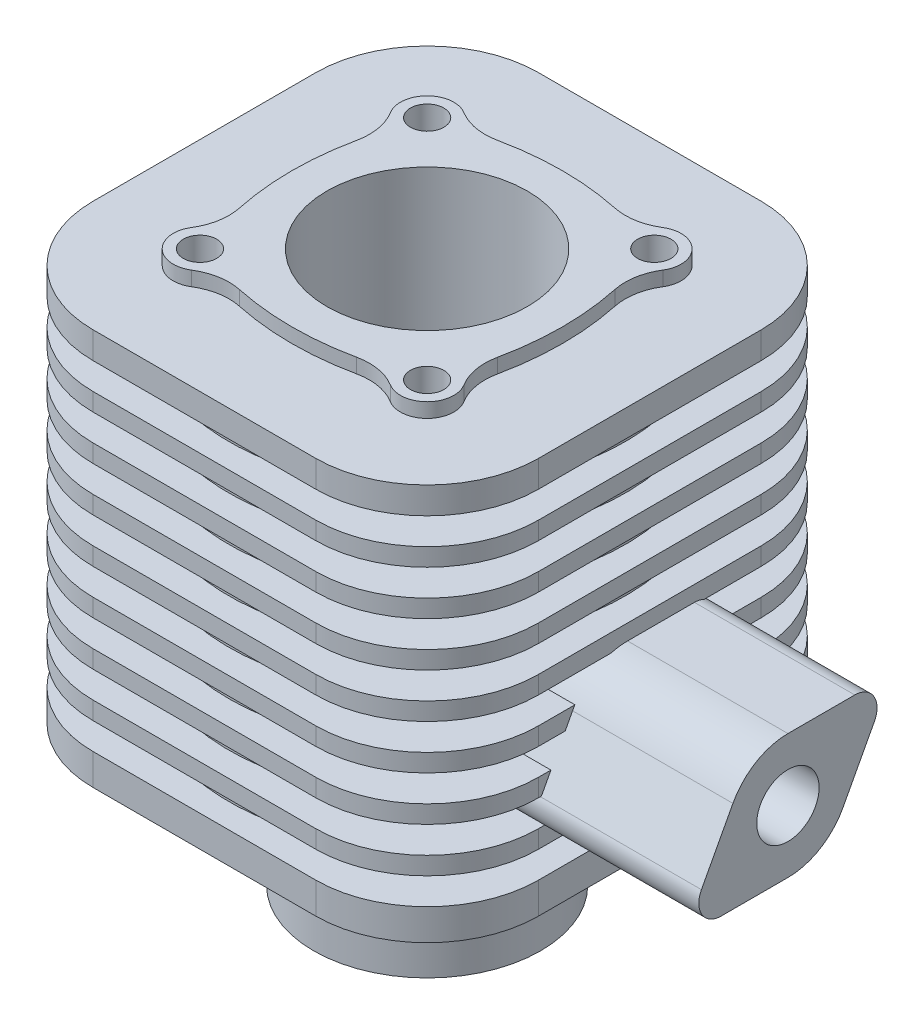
ISO-10303-21;
HEADER;
FILE_DESCRIPTION(('STEP AP214'),'2;1');
FILE_NAME('part.step','',(''),(''),'','','');
FILE_SCHEMA(('AUTOMOTIVE_DESIGN { 1 0 10303 214 1 1 1 1 }'));
ENDSEC;
DATA;
#1=APPLICATION_CONTEXT('core data for automotive mechanical design processes');
#2=APPLICATION_PROTOCOL_DEFINITION('international standard','automotive_design',2000,#1);
#3=PRODUCT_CONTEXT('',#1,'mechanical');
#4=PRODUCT('Part','Part','',(#3));
#5=PRODUCT_RELATED_PRODUCT_CATEGORY('part','',(#4));
#6=PRODUCT_DEFINITION_FORMATION('','',#4);
#7=PRODUCT_DEFINITION_CONTEXT('part definition',#1,'design');
#8=PRODUCT_DEFINITION('design','',#6,#7);
#9=PRODUCT_DEFINITION_SHAPE('','',#8);
#10=(LENGTH_UNIT() NAMED_UNIT(*) SI_UNIT(.MILLI.,.METRE.));
#11=(NAMED_UNIT(*) PLANE_ANGLE_UNIT() SI_UNIT($,.RADIAN.));
#12=(NAMED_UNIT(*) SI_UNIT($,.STERADIAN.) SOLID_ANGLE_UNIT());
#13=UNCERTAINTY_MEASURE_WITH_UNIT(LENGTH_MEASURE(1.E-05),#10,'distance_accuracy_value','');
#14=(GEOMETRIC_REPRESENTATION_CONTEXT(3) GLOBAL_UNCERTAINTY_ASSIGNED_CONTEXT((#13)) GLOBAL_UNIT_ASSIGNED_CONTEXT((#10,
#11,#12)) REPRESENTATION_CONTEXT('',''));
#15=CARTESIAN_POINT('',(0.,0.,0.));
#16=DIRECTION('',(0.,0.,1.));
#17=DIRECTION('',(1.,0.,0.));
#18=AXIS2_PLACEMENT_3D('',#15,#16,#17);
#19=CARTESIAN_POINT('',(100.,-64.,-49.9999999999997));
#20=DIRECTION('',(1.,0.,0.));
#21=DIRECTION('',(0.,0.,-1.));
#22=AXIS2_PLACEMENT_3D('',#19,#20,#21);
#23=PLANE('',#22);
#24=DIRECTION('',(0.,0.882122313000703,-0.471020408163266));
#25=VECTOR('',#24,1.);
#26=CARTESIAN_POINT('',(100.,16.2342464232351,30.4033344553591));
#27=LINE('',#26,#25);
#28=CARTESIAN_POINT('',(100.,-18.,48.6831449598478));
#29=VERTEX_POINT('',#28);
#30=CARTESIAN_POINT('',(100.,-10.,44.4114433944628));
#31=VERTEX_POINT('',#30);
#32=EDGE_CURVE('E2912',#29,#31,#27,.T.);
#33=ORIENTED_EDGE('',*,*,#32,.T.);
#34=DIRECTION('',(0.,0.,-1.));
#35=VECTOR('',#34,1.);
#36=CARTESIAN_POINT('',(100.,-9.99999999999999,-49.9999999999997));
#37=LINE('',#36,#35);
#38=CARTESIAN_POINT('',(100.,-9.99999999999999,49.9999999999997));
#39=VERTEX_POINT('',#38);
#40=EDGE_CURVE('E985',#39,#31,#37,.T.);
#41=ORIENTED_EDGE('',*,*,#40,.F.);
#42=DIRECTION('',(0.,1.,0.));
#43=VECTOR('',#42,1.);
#44=CARTESIAN_POINT('',(100.,-64.,49.9999999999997));
#45=LINE('',#44,#43);
#46=CARTESIAN_POINT('',(100.,-18.,49.9999999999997));
#47=VERTEX_POINT('',#46);
#48=EDGE_CURVE('E1971',#47,#39,#45,.T.);
#49=ORIENTED_EDGE('',*,*,#48,.F.);
#50=DIRECTION('',(0.,0.,1.));
#51=VECTOR('',#50,1.);
#52=CARTESIAN_POINT('',(100.,-18.,-49.9999999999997));
#53=LINE('',#52,#51);
#54=EDGE_CURVE('E924',#29,#47,#53,.T.);
#55=ORIENTED_EDGE('',*,*,#54,.F.);
#56=EDGE_LOOP('',(#33,#41,#49,#55));
#57=FACE_BOUND('',#56,.T.);
#58=ADVANCED_FACE('F40',(#57),#23,.T.);
#59=CARTESIAN_POINT('',(100.,-5.,10.));
#60=DIRECTION('',(1.,0.,0.));
#61=DIRECTION('',(0.,0.,-1.));
#62=AXIS2_PLACEMENT_3D('',#59,#60,#61);
#63=CIRCLE('',#62,28.);
#64=CARTESIAN_POINT('',(100.,8.18857142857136,34.6994247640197));
#65=VERTEX_POINT('',#64);
#66=CARTESIAN_POINT('',(100.,10.,33.6431808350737));
#67=VERTEX_POINT('',#66);
#68=EDGE_CURVE('E2901',#65,#67,#63,.F.);
#69=ORIENTED_EDGE('',*,*,#68,.T.);
#70=DIRECTION('',(0.,0.,-1.));
#71=VECTOR('',#70,1.);
#72=CARTESIAN_POINT('',(100.,10.,-49.9999999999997));
#73=LINE('',#72,#71);
#74=CARTESIAN_POINT('',(100.,10.,49.9999999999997));
#75=VERTEX_POINT('',#74);
#76=EDGE_CURVE('E1028',#75,#67,#73,.T.);
#77=ORIENTED_EDGE('',*,*,#76,.F.);
#78=CARTESIAN_POINT('',(100.,2.,49.9999999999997));
#79=VERTEX_POINT('',#78);
#80=EDGE_CURVE('E1970',#79,#75,#45,.T.);
#81=ORIENTED_EDGE('',*,*,#80,.F.);
#82=DIRECTION('',(0.,0.,1.));
#83=VECTOR('',#82,1.);
#84=CARTESIAN_POINT('',(100.,2.,-49.9999999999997));
#85=LINE('',#84,#83);
#86=CARTESIAN_POINT('',(100.,2.,38.0038910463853));
#87=VERTEX_POINT('',#86);
#88=EDGE_CURVE('E968',#87,#79,#85,.T.);
#89=ORIENTED_EDGE('',*,*,#88,.F.);
#90=DIRECTION('',(0.,0.882122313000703,-0.471020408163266));
#91=VECTOR('',#90,1.);
#92=CARTESIAN_POINT('',(100.,16.2342464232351,30.4033344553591));
#93=LINE('',#92,#91);
#94=EDGE_CURVE('E2904',#87,#65,#93,.T.);
#95=ORIENTED_EDGE('',*,*,#94,.T.);
#96=EDGE_LOOP('',(#69,#77,#81,#89,#95));
#97=FACE_BOUND('',#96,.T.);
#98=ADVANCED_FACE('F1590',(#97),#23,.T.);
#99=CARTESIAN_POINT('',(-50.,114.,50.));
#100=DIRECTION('',(0.,1.,0.));
#101=DIRECTION('',(0.,0.,1.));
#102=AXIS2_PLACEMENT_3D('',#99,#100,#101);
#103=PLANE('',#102);
#104=CARTESIAN_POINT('',(-50.,114.,50.));
#105=DIRECTION('',(0.,1.,0.));
#106=DIRECTION('',(0.,0.,1.));
#107=AXIS2_PLACEMENT_3D('',#104,#105,#106);
#108=CIRCLE('',#107,50.);
#109=CARTESIAN_POINT('',(-100.,114.,49.9999999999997));
#110=VERTEX_POINT('',#109);
#111=CARTESIAN_POINT('',(-49.9999999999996,114.,100.));
#112=VERTEX_POINT('',#111);
#113=EDGE_CURVE('E1216',#110,#112,#108,.T.);
#114=ORIENTED_EDGE('',*,*,#113,.T.);
#115=DIRECTION('',(1.,0.,0.));
#116=VECTOR('',#115,1.);
#117=CARTESIAN_POINT('',(-49.9999999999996,114.,100.));
#118=LINE('',#117,#116);
#119=CARTESIAN_POINT('',(49.9999999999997,114.,100.));
#120=VERTEX_POINT('',#119);
#121=EDGE_CURVE('E1219',#112,#120,#118,.T.);
#122=ORIENTED_EDGE('',*,*,#121,.T.);
#123=CARTESIAN_POINT('',(50.,114.,50.));
#124=DIRECTION('',(0.,1.,0.));
#125=DIRECTION('',(0.,0.,1.));
#126=AXIS2_PLACEMENT_3D('',#123,#124,#125);
#127=CIRCLE('',#126,50.);
#128=CARTESIAN_POINT('',(100.,114.,49.9999999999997));
#129=VERTEX_POINT('',#128);
#130=EDGE_CURVE('E1222',#120,#129,#127,.T.);
#131=ORIENTED_EDGE('',*,*,#130,.T.);
#132=DIRECTION('',(0.,0.,-1.));
#133=VECTOR('',#132,1.);
#134=CARTESIAN_POINT('',(100.,114.,-49.9999999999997));
#135=LINE('',#134,#133);
#136=CARTESIAN_POINT('',(100.,114.,-49.9999999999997));
#137=VERTEX_POINT('',#136);
#138=EDGE_CURVE('E1225',#129,#137,#135,.T.);
#139=ORIENTED_EDGE('',*,*,#138,.T.);
#140=CARTESIAN_POINT('',(50.,114.,-50.));
#141=DIRECTION('',(0.,1.,0.));
#142=DIRECTION('',(0.,0.,-1.));
#143=AXIS2_PLACEMENT_3D('',#140,#141,#142);
#144=CIRCLE('',#143,50.);
#145=CARTESIAN_POINT('',(49.9999999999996,114.,-100.));
#146=VERTEX_POINT('',#145);
#147=EDGE_CURVE('E1228',#137,#146,#144,.T.);
#148=ORIENTED_EDGE('',*,*,#147,.T.);
#149=DIRECTION('',(-1.,0.,0.));
#150=VECTOR('',#149,1.);
#151=CARTESIAN_POINT('',(-49.9999999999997,114.,-100.));
#152=LINE('',#151,#150);
#153=CARTESIAN_POINT('',(-49.9999999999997,114.,-100.));
#154=VERTEX_POINT('',#153);
#155=EDGE_CURVE('E1231',#146,#154,#152,.T.);
#156=ORIENTED_EDGE('',*,*,#155,.T.);
#157=CARTESIAN_POINT('',(-50.,114.,-50.));
#158=DIRECTION('',(0.,1.,0.));
#159=DIRECTION('',(0.,0.,1.));
#160=AXIS2_PLACEMENT_3D('',#157,#158,#159);
#161=CIRCLE('',#160,50.);
#162=CARTESIAN_POINT('',(-100.,114.,-49.9999999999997));
#163=VERTEX_POINT('',#162);
#164=EDGE_CURVE('E1234',#154,#163,#161,.T.);
#165=ORIENTED_EDGE('',*,*,#164,.T.);
#166=DIRECTION('',(0.,0.,1.));
#167=VECTOR('',#166,1.);
#168=CARTESIAN_POINT('',(-100.,114.,-49.9999999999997));
#169=LINE('',#168,#167);
#170=EDGE_CURVE('E1237',#163,#110,#169,.T.);
#171=ORIENTED_EDGE('',*,*,#170,.T.);
#172=EDGE_LOOP('',(#114,#122,#131,#139,#148,#156,#165,#171));
#173=FACE_BOUND('',#172,.T.);
#174=CARTESIAN_POINT('',(66.2558063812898,114.,0.));
#175=DIRECTION('',(0.,1.,0.));
#176=DIRECTION('',(0.,0.,1.));
#177=AXIS2_PLACEMENT_3D('',#174,#175,#176);
#178=CIRCLE('',#177,127.);
#179=CARTESIAN_POINT('',(-57.9871253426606,114.,-26.3190789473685));
#180=VERTEX_POINT('',#179);
#181=CARTESIAN_POINT('',(-57.9871253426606,114.,26.3190789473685));
#182=VERTEX_POINT('',#181);
#183=EDGE_CURVE('E809',#180,#182,#178,.T.);
#184=ORIENTED_EDGE('',*,*,#183,.F.);
#185=CARTESIAN_POINT('',(-82.4443953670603,114.,-31.5));
#186=DIRECTION('',(0.,-1.,0.));
#187=DIRECTION('',(0.,0.,1.));
#188=AXIS2_PLACEMENT_3D('',#185,#186,#187);
#189=CIRCLE('',#188,25.);
#190=CARTESIAN_POINT('',(-61.1981822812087,114.,-44.6756756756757));
#191=VERTEX_POINT('',#190);
#192=EDGE_CURVE('E771',#191,#180,#189,.T.);
#193=ORIENTED_EDGE('',*,*,#192,.F.);
#194=CARTESIAN_POINT('',(-51.,114.,-51.));
#195=DIRECTION('',(0.,1.,0.));
#196=DIRECTION('',(0.,0.,1.));
#197=AXIS2_PLACEMENT_3D('',#194,#195,#196);
#198=CIRCLE('',#197,12.);
#199=CARTESIAN_POINT('',(-44.6756756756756,114.,-61.1981822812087));
#200=VERTEX_POINT('',#199);
#201=EDGE_CURVE('E776',#200,#191,#198,.T.);
#202=ORIENTED_EDGE('',*,*,#201,.F.);
#203=CARTESIAN_POINT('',(-31.5,114.,-82.4443953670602));
#204=DIRECTION('',(0.,-1.,0.));
#205=DIRECTION('',(0.,0.,-1.));
#206=AXIS2_PLACEMENT_3D('',#203,#204,#205);
#207=CIRCLE('',#206,25.);
#208=CARTESIAN_POINT('',(-26.3190789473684,114.,-57.9871253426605));
#209=VERTEX_POINT('',#208);
#210=EDGE_CURVE('E835',#209,#200,#207,.T.);
#211=ORIENTED_EDGE('',*,*,#210,.F.);
#212=CARTESIAN_POINT('',(0.,114.,66.2558063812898));
#213=DIRECTION('',(0.,1.,0.));
#214=DIRECTION('',(0.,0.,1.));
#215=AXIS2_PLACEMENT_3D('',#212,#213,#214);
#216=CIRCLE('',#215,127.);
#217=CARTESIAN_POINT('',(26.3190789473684,114.,-57.9871253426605));
#218=VERTEX_POINT('',#217);
#219=EDGE_CURVE('E833',#218,#209,#216,.T.);
#220=ORIENTED_EDGE('',*,*,#219,.F.);
#221=CARTESIAN_POINT('',(31.5,114.,-82.4443953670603));
#222=DIRECTION('',(0.,-1.,0.));
#223=DIRECTION('',(0.,0.,1.));
#224=AXIS2_PLACEMENT_3D('',#221,#222,#223);
#225=CIRCLE('',#224,25.);
#226=CARTESIAN_POINT('',(44.6756756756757,114.,-61.1981822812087));
#227=VERTEX_POINT('',#226);
#228=EDGE_CURVE('E831',#227,#218,#225,.T.);
#229=ORIENTED_EDGE('',*,*,#228,.F.);
#230=CARTESIAN_POINT('',(51.,114.,-51.));
#231=DIRECTION('',(0.,1.,0.));
#232=DIRECTION('',(0.,0.,-1.));
#233=AXIS2_PLACEMENT_3D('',#230,#231,#232);
#234=CIRCLE('',#233,12.);
#235=CARTESIAN_POINT('',(61.1981822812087,114.,-44.6756756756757));
#236=VERTEX_POINT('',#235);
#237=EDGE_CURVE('E829',#236,#227,#234,.T.);
#238=ORIENTED_EDGE('',*,*,#237,.F.);
#239=CARTESIAN_POINT('',(82.4443953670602,114.,-31.5));
#240=DIRECTION('',(0.,-1.,0.));
#241=DIRECTION('',(0.,0.,-1.));
#242=AXIS2_PLACEMENT_3D('',#239,#240,#241);
#243=CIRCLE('',#242,25.);
#244=CARTESIAN_POINT('',(57.9871253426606,114.,-26.3190789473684));
#245=VERTEX_POINT('',#244);
#246=EDGE_CURVE('E827',#245,#236,#243,.T.);
#247=ORIENTED_EDGE('',*,*,#246,.F.);
#248=CARTESIAN_POINT('',(-66.2558063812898,114.,0.));
#249=DIRECTION('',(0.,1.,0.));
#250=DIRECTION('',(0.,0.,-1.));
#251=AXIS2_PLACEMENT_3D('',#248,#249,#250);
#252=CIRCLE('',#251,127.);
#253=CARTESIAN_POINT('',(57.9871253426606,114.,26.3190789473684));
#254=VERTEX_POINT('',#253);
#255=EDGE_CURVE('E825',#254,#245,#252,.T.);
#256=ORIENTED_EDGE('',*,*,#255,.F.);
#257=CARTESIAN_POINT('',(82.4443953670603,114.,31.5));
#258=DIRECTION('',(0.,-1.,0.));
#259=DIRECTION('',(0.,0.,1.));
#260=AXIS2_PLACEMENT_3D('',#257,#258,#259);
#261=CIRCLE('',#260,25.);
#262=CARTESIAN_POINT('',(61.1981822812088,114.,44.6756756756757));
#263=VERTEX_POINT('',#262);
#264=EDGE_CURVE('E823',#263,#254,#261,.T.);
#265=ORIENTED_EDGE('',*,*,#264,.F.);
#266=CARTESIAN_POINT('',(51.,114.,51.));
#267=DIRECTION('',(0.,1.,0.));
#268=DIRECTION('',(0.,0.,1.));
#269=AXIS2_PLACEMENT_3D('',#266,#267,#268);
#270=CIRCLE('',#269,12.);
#271=CARTESIAN_POINT('',(44.6756756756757,114.,61.1981822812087));
#272=VERTEX_POINT('',#271);
#273=EDGE_CURVE('E821',#272,#263,#270,.T.);
#274=ORIENTED_EDGE('',*,*,#273,.F.);
#275=CARTESIAN_POINT('',(31.5,114.,82.4443953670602));
#276=DIRECTION('',(0.,-1.,0.));
#277=DIRECTION('',(0.,0.,-1.));
#278=AXIS2_PLACEMENT_3D('',#275,#276,#277);
#279=CIRCLE('',#278,25.);
#280=CARTESIAN_POINT('',(26.3190789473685,114.,57.9871253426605));
#281=VERTEX_POINT('',#280);
#282=EDGE_CURVE('E819',#281,#272,#279,.T.);
#283=ORIENTED_EDGE('',*,*,#282,.F.);
#284=CARTESIAN_POINT('',(0.,114.,-66.2558063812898));
#285=DIRECTION('',(0.,1.,0.));
#286=DIRECTION('',(0.,0.,-1.));
#287=AXIS2_PLACEMENT_3D('',#284,#285,#286);
#288=CIRCLE('',#287,127.);
#289=CARTESIAN_POINT('',(-26.3190789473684,114.,57.9871253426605));
#290=VERTEX_POINT('',#289);
#291=EDGE_CURVE('E817',#290,#281,#288,.T.);
#292=ORIENTED_EDGE('',*,*,#291,.F.);
#293=CARTESIAN_POINT('',(-31.5,114.,82.4443953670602));
#294=DIRECTION('',(0.,-1.,0.));
#295=DIRECTION('',(0.,0.,1.));
#296=AXIS2_PLACEMENT_3D('',#293,#294,#295);
#297=CIRCLE('',#296,25.);
#298=CARTESIAN_POINT('',(-44.6756756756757,114.,61.1981822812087));
#299=VERTEX_POINT('',#298);
#300=EDGE_CURVE('E815',#299,#290,#297,.T.);
#301=ORIENTED_EDGE('',*,*,#300,.F.);
#302=CARTESIAN_POINT('',(-51.,114.,51.));
#303=DIRECTION('',(0.,1.,0.));
#304=DIRECTION('',(0.,0.,-1.));
#305=AXIS2_PLACEMENT_3D('',#302,#303,#304);
#306=CIRCLE('',#305,12.);
#307=CARTESIAN_POINT('',(-61.1981822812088,114.,44.6756756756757));
#308=VERTEX_POINT('',#307);
#309=EDGE_CURVE('E813',#308,#299,#306,.T.);
#310=ORIENTED_EDGE('',*,*,#309,.F.);
#311=CARTESIAN_POINT('',(-82.4443953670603,114.,31.5));
#312=DIRECTION('',(0.,-1.,0.));
#313=DIRECTION('',(0.,0.,-1.));
#314=AXIS2_PLACEMENT_3D('',#311,#312,#313);
#315=CIRCLE('',#314,25.);
#316=EDGE_CURVE('E811',#182,#308,#315,.T.);
#317=ORIENTED_EDGE('',*,*,#316,.F.);
#318=EDGE_LOOP('',(#184,#193,#202,#211,#220,#229,#238,#247,#256,#265,#274,#283,#292,#301,#310,#317));
#319=FACE_BOUND('',#318,.T.);
#320=ADVANCED_FACE('F1399',(#173,#319),#103,.T.);
#321=CARTESIAN_POINT('',(-50.,-64.,50.));
#322=DIRECTION('',(0.,1.,0.));
#323=DIRECTION('',(0.,0.,1.));
#324=AXIS2_PLACEMENT_3D('',#321,#322,#323);
#325=CYLINDRICAL_SURFACE('',#324,50.);
#326=CARTESIAN_POINT('',(-50.,-50.,50.));
#327=DIRECTION('',(0.,-1.,0.));
#328=DIRECTION('',(0.,0.,-1.));
#329=AXIS2_PLACEMENT_3D('',#326,#327,#328);
#330=CIRCLE('',#329,50.);
#331=CARTESIAN_POINT('',(-100.,-50.,49.9999999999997));
#332=VERTEX_POINT('',#331);
#333=CARTESIAN_POINT('',(-49.9999999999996,-50.,100.));
#334=VERTEX_POINT('',#333);
#335=EDGE_CURVE('E914',#332,#334,#330,.F.);
#336=ORIENTED_EDGE('',*,*,#335,.F.);
#337=DIRECTION('',(0.,1.,0.));
#338=VECTOR('',#337,1.);
#339=CARTESIAN_POINT('',(-100.,-64.,49.9999999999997));
#340=LINE('',#339,#338);
#341=CARTESIAN_POINT('',(-100.,-64.,49.9999999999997));
#342=VERTEX_POINT('',#341);
#343=EDGE_CURVE('E1265',#342,#332,#340,.T.);
#344=ORIENTED_EDGE('',*,*,#343,.F.);
#345=CARTESIAN_POINT('',(-50.,-64.,50.));
#346=DIRECTION('',(0.,1.,0.));
#347=DIRECTION('',(0.,0.,1.));
#348=AXIS2_PLACEMENT_3D('',#345,#346,#347);
#349=CIRCLE('',#348,50.);
#350=CARTESIAN_POINT('',(-49.9999999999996,-64.,100.));
#351=VERTEX_POINT('',#350);
#352=EDGE_CURVE('E1240',#342,#351,#349,.T.);
#353=ORIENTED_EDGE('',*,*,#352,.T.);
#354=DIRECTION('',(0.,1.,0.));
#355=VECTOR('',#354,1.);
#356=CARTESIAN_POINT('',(-49.9999999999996,-64.,100.));
#357=LINE('',#356,#355);
#358=EDGE_CURVE('E1301',#351,#334,#357,.T.);
#359=ORIENTED_EDGE('',*,*,#358,.T.);
#360=EDGE_LOOP('',(#336,#344,#353,#359));
#361=FACE_BOUND('',#360,.T.);
#362=ADVANCED_FACE('F1722',(#361),#325,.T.);
#363=CARTESIAN_POINT('',(-100.,-64.,-49.9999999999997));
#364=DIRECTION('',(-1.,0.,0.));
#365=DIRECTION('',(0.,0.,1.));
#366=AXIS2_PLACEMENT_3D('',#363,#364,#365);
#367=PLANE('',#366);
#368=DIRECTION('',(0.,0.,1.));
#369=VECTOR('',#368,1.);
#370=CARTESIAN_POINT('',(-100.,-50.,-49.9999999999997));
#371=LINE('',#370,#369);
#372=CARTESIAN_POINT('',(-100.,-50.,-49.9999999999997));
#373=VERTEX_POINT('',#372);
#374=EDGE_CURVE('E912',#373,#332,#371,.T.);
#375=ORIENTED_EDGE('',*,*,#374,.F.);
#376=DIRECTION('',(0.,1.,0.));
#377=VECTOR('',#376,1.);
#378=CARTESIAN_POINT('',(-100.,-64.,-49.9999999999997));
#379=LINE('',#378,#377);
#380=CARTESIAN_POINT('',(-100.,-64.,-49.9999999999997));
#381=VERTEX_POINT('',#380);
#382=EDGE_CURVE('E1271',#381,#373,#379,.T.);
#383=ORIENTED_EDGE('',*,*,#382,.F.);
#384=DIRECTION('',(0.,0.,1.));
#385=VECTOR('',#384,1.);
#386=CARTESIAN_POINT('',(-100.,-64.,-49.9999999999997));
#387=LINE('',#386,#385);
#388=EDGE_CURVE('E1261',#381,#342,#387,.T.);
#389=ORIENTED_EDGE('',*,*,#388,.T.);
#390=ORIENTED_EDGE('',*,*,#343,.T.);
#391=EDGE_LOOP('',(#375,#383,#389,#390));
#392=FACE_BOUND('',#391,.T.);
#393=ADVANCED_FACE('F1727',(#392),#367,.T.);
#394=CARTESIAN_POINT('',(-50.,-64.,-50.));
#395=DIRECTION('',(0.,1.,0.));
#396=DIRECTION('',(0.,0.,1.));
#397=AXIS2_PLACEMENT_3D('',#394,#395,#396);
#398=CYLINDRICAL_SURFACE('',#397,50.);
#399=CARTESIAN_POINT('',(-50.,-50.,-50.));
#400=DIRECTION('',(0.,-1.,0.));
#401=DIRECTION('',(0.,0.,-1.));
#402=AXIS2_PLACEMENT_3D('',#399,#400,#401);
#403=CIRCLE('',#402,50.);
#404=CARTESIAN_POINT('',(-49.9999999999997,-50.,-100.));
#405=VERTEX_POINT('',#404);
#406=EDGE_CURVE('E910',#405,#373,#403,.F.);
#407=ORIENTED_EDGE('',*,*,#406,.F.);
#408=DIRECTION('',(0.,1.,0.));
#409=VECTOR('',#408,1.);
#410=CARTESIAN_POINT('',(-49.9999999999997,-64.,-100.));
#411=LINE('',#410,#409);
#412=CARTESIAN_POINT('',(-49.9999999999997,-64.,-100.));
#413=VERTEX_POINT('',#412);
#414=EDGE_CURVE('E1276',#413,#405,#411,.T.);
#415=ORIENTED_EDGE('',*,*,#414,.F.);
#416=CARTESIAN_POINT('',(-50.,-64.,-50.));
#417=DIRECTION('',(0.,1.,0.));
#418=DIRECTION('',(0.,0.,1.));
#419=AXIS2_PLACEMENT_3D('',#416,#417,#418);
#420=CIRCLE('',#419,50.);
#421=EDGE_CURVE('E1258',#413,#381,#420,.T.);
#422=ORIENTED_EDGE('',*,*,#421,.T.);
#423=ORIENTED_EDGE('',*,*,#382,.T.);
#424=EDGE_LOOP('',(#407,#415,#422,#423));
#425=FACE_BOUND('',#424,.T.);
#426=ADVANCED_FACE('F1586',(#425),#398,.T.);
#427=CARTESIAN_POINT('',(-49.9999999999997,-64.,-100.));
#428=DIRECTION('',(0.,0.,-1.));
#429=DIRECTION('',(-1.,0.,0.));
#430=AXIS2_PLACEMENT_3D('',#427,#428,#429);
#431=PLANE('',#430);
#432=DIRECTION('',(-1.,0.,0.));
#433=VECTOR('',#432,1.);
#434=CARTESIAN_POINT('',(-49.9999999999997,-50.,-100.));
#435=LINE('',#434,#433);
#436=CARTESIAN_POINT('',(50.,-50.,-100.));
#437=VERTEX_POINT('',#436);
#438=EDGE_CURVE('E908',#437,#405,#435,.T.);
#439=ORIENTED_EDGE('',*,*,#438,.F.);
#440=DIRECTION('',(0.,1.,0.));
#441=VECTOR('',#440,1.);
#442=CARTESIAN_POINT('',(49.9999999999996,-64.,-100.));
#443=LINE('',#442,#441);
#444=CARTESIAN_POINT('',(49.9999999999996,-64.,-100.));
#445=VERTEX_POINT('',#444);
#446=EDGE_CURVE('E1281',#445,#437,#443,.T.);
#447=ORIENTED_EDGE('',*,*,#446,.F.);
#448=DIRECTION('',(-1.,0.,0.));
#449=VECTOR('',#448,1.);
#450=CARTESIAN_POINT('',(-49.9999999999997,-64.,-100.));
#451=LINE('',#450,#449);
#452=EDGE_CURVE('E1255',#445,#413,#451,.T.);
#453=ORIENTED_EDGE('',*,*,#452,.T.);
#454=ORIENTED_EDGE('',*,*,#414,.T.);
#455=EDGE_LOOP('',(#439,#447,#453,#454));
#456=FACE_BOUND('',#455,.T.);
#457=ADVANCED_FACE('F1704',(#456),#431,.T.);
#458=CARTESIAN_POINT('',(50.,-64.,-50.));
#459=DIRECTION('',(0.,1.,0.));
#460=DIRECTION('',(0.,0.,1.));
#461=AXIS2_PLACEMENT_3D('',#458,#459,#460);
#462=CYLINDRICAL_SURFACE('',#461,50.);
#463=CARTESIAN_POINT('',(50.,-50.,-50.));
#464=DIRECTION('',(0.,-1.,0.));
#465=DIRECTION('',(0.,0.,-1.));
#466=AXIS2_PLACEMENT_3D('',#463,#464,#465);
#467=CIRCLE('',#466,50.);
#468=CARTESIAN_POINT('',(100.,-50.,-49.9999999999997));
#469=VERTEX_POINT('',#468);
#470=EDGE_CURVE('E906',#469,#437,#467,.F.);
#471=ORIENTED_EDGE('',*,*,#470,.F.);
#472=DIRECTION('',(0.,1.,0.));
#473=VECTOR('',#472,1.);
#474=CARTESIAN_POINT('',(100.,-64.,-49.9999999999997));
#475=LINE('',#474,#473);
#476=CARTESIAN_POINT('',(100.,-64.,-49.9999999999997));
#477=VERTEX_POINT('',#476);
#478=EDGE_CURVE('E1286',#477,#469,#475,.T.);
#479=ORIENTED_EDGE('',*,*,#478,.F.);
#480=CARTESIAN_POINT('',(50.,-64.,-50.));
#481=DIRECTION('',(0.,1.,0.));
#482=DIRECTION('',(0.,0.,-1.));
#483=AXIS2_PLACEMENT_3D('',#480,#481,#482);
#484=CIRCLE('',#483,50.);
#485=EDGE_CURVE('E1252',#477,#445,#484,.T.);
#486=ORIENTED_EDGE('',*,*,#485,.T.);
#487=ORIENTED_EDGE('',*,*,#446,.T.);
#488=EDGE_LOOP('',(#471,#479,#486,#487));
#489=FACE_BOUND('',#488,.T.);
#490=ADVANCED_FACE('F1614',(#489),#462,.T.);
#491=DIRECTION('',(0.,0.,-1.));
#492=VECTOR('',#491,1.);
#493=CARTESIAN_POINT('',(100.,-50.,-49.9999999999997));
#494=LINE('',#493,#492);
#495=CARTESIAN_POINT('',(100.,-50.,49.9999999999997));
#496=VERTEX_POINT('',#495);
#497=EDGE_CURVE('E904',#496,#469,#494,.T.);
#498=ORIENTED_EDGE('',*,*,#497,.F.);
#499=CARTESIAN_POINT('',(100.,-64.,49.9999999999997));
#500=VERTEX_POINT('',#499);
#501=EDGE_CURVE('E1291',#500,#496,#45,.T.);
#502=ORIENTED_EDGE('',*,*,#501,.F.);
#503=DIRECTION('',(0.,0.,-1.));
#504=VECTOR('',#503,1.);
#505=CARTESIAN_POINT('',(100.,-64.,-49.9999999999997));
#506=LINE('',#505,#504);
#507=EDGE_CURVE('E1249',#500,#477,#506,.T.);
#508=ORIENTED_EDGE('',*,*,#507,.T.);
#509=ORIENTED_EDGE('',*,*,#478,.T.);
#510=EDGE_LOOP('',(#498,#502,#508,#509));
#511=FACE_BOUND('',#510,.T.);
#512=ADVANCED_FACE('F1598',(#511),#23,.T.);
#513=CARTESIAN_POINT('',(50.,-64.,50.));
#514=DIRECTION('',(0.,1.,0.));
#515=DIRECTION('',(0.,0.,1.));
#516=AXIS2_PLACEMENT_3D('',#513,#514,#515);
#517=CYLINDRICAL_SURFACE('',#516,50.);
#518=CARTESIAN_POINT('',(50.,-50.,50.));
#519=DIRECTION('',(0.,-1.,0.));
#520=DIRECTION('',(0.,0.,-1.));
#521=AXIS2_PLACEMENT_3D('',#518,#519,#520);
#522=CIRCLE('',#521,50.);
#523=CARTESIAN_POINT('',(49.9999999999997,-50.,100.));
#524=VERTEX_POINT('',#523);
#525=EDGE_CURVE('E902',#524,#496,#522,.F.);
#526=ORIENTED_EDGE('',*,*,#525,.F.);
#527=DIRECTION('',(0.,1.,0.));
#528=VECTOR('',#527,1.);
#529=CARTESIAN_POINT('',(49.9999999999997,-64.,100.));
#530=LINE('',#529,#528);
#531=CARTESIAN_POINT('',(49.9999999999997,-64.,100.));
#532=VERTEX_POINT('',#531);
#533=EDGE_CURVE('E1296',#532,#524,#530,.T.);
#534=ORIENTED_EDGE('',*,*,#533,.F.);
#535=CARTESIAN_POINT('',(50.,-64.,50.));
#536=DIRECTION('',(0.,1.,0.));
#537=DIRECTION('',(0.,0.,1.));
#538=AXIS2_PLACEMENT_3D('',#535,#536,#537);
#539=CIRCLE('',#538,50.);
#540=EDGE_CURVE('E1246',#532,#500,#539,.T.);
#541=ORIENTED_EDGE('',*,*,#540,.T.);
#542=ORIENTED_EDGE('',*,*,#501,.T.);
#543=EDGE_LOOP('',(#526,#534,#541,#542));
#544=FACE_BOUND('',#543,.T.);
#545=ADVANCED_FACE('F1612',(#544),#517,.T.);
#546=CARTESIAN_POINT('',(-49.9999999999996,-64.,100.));
#547=DIRECTION('',(0.,0.,1.));
#548=DIRECTION('',(1.,0.,0.));
#549=AXIS2_PLACEMENT_3D('',#546,#547,#548);
#550=PLANE('',#549);
#551=DIRECTION('',(1.,0.,0.));
#552=VECTOR('',#551,1.);
#553=CARTESIAN_POINT('',(-49.9999999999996,-50.,100.));
#554=LINE('',#553,#552);
#555=EDGE_CURVE('E11',#334,#524,#554,.T.);
#556=ORIENTED_EDGE('',*,*,#555,.F.);
#557=ORIENTED_EDGE('',*,*,#358,.F.);
#558=DIRECTION('',(1.,0.,0.));
#559=VECTOR('',#558,1.);
#560=CARTESIAN_POINT('',(-49.9999999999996,-64.,100.));
#561=LINE('',#560,#559);
#562=EDGE_CURVE('E1243',#351,#532,#561,.T.);
#563=ORIENTED_EDGE('',*,*,#562,.T.);
#564=ORIENTED_EDGE('',*,*,#533,.T.);
#565=EDGE_LOOP('',(#556,#557,#563,#564));
#566=FACE_BOUND('',#565,.T.);
#567=ADVANCED_FACE('F1702',(#566),#550,.T.);
#568=CARTESIAN_POINT('',(-50.,-38.,50.));
#569=DIRECTION('',(0.,1.,0.));
#570=DIRECTION('',(0.,0.,1.));
#571=AXIS2_PLACEMENT_3D('',#568,#569,#570);
#572=CIRCLE('',#571,50.);
#573=CARTESIAN_POINT('',(-49.9999999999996,-38.,100.));
#574=VERTEX_POINT('',#573);
#575=CARTESIAN_POINT('',(-100.,-38.,49.9999999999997));
#576=VERTEX_POINT('',#575);
#577=EDGE_CURVE('E900',#574,#576,#572,.F.);
#578=ORIENTED_EDGE('',*,*,#577,.F.);
#579=CARTESIAN_POINT('',(-49.9999999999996,-30.,100.));
#580=VERTEX_POINT('',#579);
#581=EDGE_CURVE('E1304',#574,#580,#357,.T.);
#582=ORIENTED_EDGE('',*,*,#581,.T.);
#583=CARTESIAN_POINT('',(-50.,-30.,50.));
#584=DIRECTION('',(0.,-1.,0.));
#585=DIRECTION('',(0.,0.,-1.));
#586=AXIS2_PLACEMENT_3D('',#583,#584,#585);
#587=CIRCLE('',#586,50.);
#588=CARTESIAN_POINT('',(-100.,-30.,49.9999999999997));
#589=VERTEX_POINT('',#588);
#590=EDGE_CURVE('E957',#589,#580,#587,.F.);
#591=ORIENTED_EDGE('',*,*,#590,.F.);
#592=EDGE_CURVE('E1269',#576,#589,#340,.T.);
#593=ORIENTED_EDGE('',*,*,#592,.F.);
#594=EDGE_LOOP('',(#578,#582,#591,#593));
#595=FACE_BOUND('',#594,.T.);
#596=ADVANCED_FACE('F1353',(#595),#325,.T.);
#597=DIRECTION('',(0.,0.,-1.));
#598=VECTOR('',#597,1.);
#599=CARTESIAN_POINT('',(-100.,-38.,-49.9999999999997));
#600=LINE('',#599,#598);
#601=CARTESIAN_POINT('',(-100.,-38.,-49.9999999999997));
#602=VERTEX_POINT('',#601);
#603=EDGE_CURVE('E898',#576,#602,#600,.T.);
#604=ORIENTED_EDGE('',*,*,#603,.F.);
#605=ORIENTED_EDGE('',*,*,#592,.T.);
#606=DIRECTION('',(0.,0.,1.));
#607=VECTOR('',#606,1.);
#608=CARTESIAN_POINT('',(-100.,-30.,-49.9999999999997));
#609=LINE('',#608,#607);
#610=CARTESIAN_POINT('',(-100.,-30.,-49.9999999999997));
#611=VERTEX_POINT('',#610);
#612=EDGE_CURVE('E954',#611,#589,#609,.T.);
#613=ORIENTED_EDGE('',*,*,#612,.F.);
#614=EDGE_CURVE('E1274',#602,#611,#379,.T.);
#615=ORIENTED_EDGE('',*,*,#614,.F.);
#616=EDGE_LOOP('',(#604,#605,#613,#615));
#617=FACE_BOUND('',#616,.T.);
#618=ADVANCED_FACE('F1439',(#617),#367,.T.);
#619=CARTESIAN_POINT('',(-50.,-38.,-50.));
#620=DIRECTION('',(0.,1.,0.));
#621=DIRECTION('',(0.,0.,1.));
#622=AXIS2_PLACEMENT_3D('',#619,#620,#621);
#623=CIRCLE('',#622,50.);
#624=CARTESIAN_POINT('',(-49.9999999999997,-38.,-100.));
#625=VERTEX_POINT('',#624);
#626=EDGE_CURVE('E896',#602,#625,#623,.F.);
#627=ORIENTED_EDGE('',*,*,#626,.F.);
#628=ORIENTED_EDGE('',*,*,#614,.T.);
#629=CARTESIAN_POINT('',(-50.,-30.,-50.));
#630=DIRECTION('',(0.,-1.,0.));
#631=DIRECTION('',(0.,0.,-1.));
#632=AXIS2_PLACEMENT_3D('',#629,#630,#631);
#633=CIRCLE('',#632,50.);
#634=CARTESIAN_POINT('',(-49.9999999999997,-30.,-100.));
#635=VERTEX_POINT('',#634);
#636=EDGE_CURVE('E951',#635,#611,#633,.F.);
#637=ORIENTED_EDGE('',*,*,#636,.F.);
#638=EDGE_CURVE('E1279',#625,#635,#411,.T.);
#639=ORIENTED_EDGE('',*,*,#638,.F.);
#640=EDGE_LOOP('',(#627,#628,#637,#639));
#641=FACE_BOUND('',#640,.T.);
#642=ADVANCED_FACE('F1448',(#641),#398,.T.);
#643=DIRECTION('',(1.,0.,0.));
#644=VECTOR('',#643,1.);
#645=CARTESIAN_POINT('',(-49.9999999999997,-38.,-100.));
#646=LINE('',#645,#644);
#647=CARTESIAN_POINT('',(49.9999999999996,-38.,-100.));
#648=VERTEX_POINT('',#647);
#649=EDGE_CURVE('E894',#625,#648,#646,.T.);
#650=ORIENTED_EDGE('',*,*,#649,.F.);
#651=ORIENTED_EDGE('',*,*,#638,.T.);
#652=DIRECTION('',(-1.,0.,0.));
#653=VECTOR('',#652,1.);
#654=CARTESIAN_POINT('',(-49.9999999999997,-30.,-100.));
#655=LINE('',#654,#653);
#656=CARTESIAN_POINT('',(50.,-30.,-100.));
#657=VERTEX_POINT('',#656);
#658=EDGE_CURVE('E948',#657,#635,#655,.T.);
#659=ORIENTED_EDGE('',*,*,#658,.F.);
#660=EDGE_CURVE('E1284',#648,#657,#443,.T.);
#661=ORIENTED_EDGE('',*,*,#660,.F.);
#662=EDGE_LOOP('',(#650,#651,#659,#661));
#663=FACE_BOUND('',#662,.T.);
#664=ADVANCED_FACE('F1535',(#663),#431,.T.);
#665=CARTESIAN_POINT('',(50.,-38.,-50.));
#666=DIRECTION('',(0.,1.,0.));
#667=DIRECTION('',(0.,0.,1.));
#668=AXIS2_PLACEMENT_3D('',#665,#666,#667);
#669=CIRCLE('',#668,50.);
#670=CARTESIAN_POINT('',(100.,-38.,-49.9999999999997));
#671=VERTEX_POINT('',#670);
#672=EDGE_CURVE('E892',#648,#671,#669,.F.);
#673=ORIENTED_EDGE('',*,*,#672,.F.);
#674=ORIENTED_EDGE('',*,*,#660,.T.);
#675=CARTESIAN_POINT('',(50.,-30.,-50.));
#676=DIRECTION('',(0.,-1.,0.));
#677=DIRECTION('',(0.,0.,-1.));
#678=AXIS2_PLACEMENT_3D('',#675,#676,#677);
#679=CIRCLE('',#678,50.);
#680=CARTESIAN_POINT('',(100.,-30.,-49.9999999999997));
#681=VERTEX_POINT('',#680);
#682=EDGE_CURVE('E945',#681,#657,#679,.F.);
#683=ORIENTED_EDGE('',*,*,#682,.F.);
#684=EDGE_CURVE('E1289',#671,#681,#475,.T.);
#685=ORIENTED_EDGE('',*,*,#684,.F.);
#686=EDGE_LOOP('',(#673,#674,#683,#685));
#687=FACE_BOUND('',#686,.T.);
#688=ADVANCED_FACE('F1528',(#687),#462,.T.);
#689=CARTESIAN_POINT('',(100.,-23.,40.0166620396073));
#690=DIRECTION('',(1.,0.,0.));
#691=DIRECTION('',(0.,0.,-1.));
#692=AXIS2_PLACEMENT_3D('',#689,#690,#691);
#693=CIRCLE('',#692,9.99999999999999);
#694=CARTESIAN_POINT('',(100.,-33.,40.0166620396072));
#695=VERTEX_POINT('',#694);
#696=CARTESIAN_POINT('',(100.,-30.,47.1580904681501));
#697=VERTEX_POINT('',#696);
#698=EDGE_CURVE('E2914',#695,#697,#693,.F.);
#699=ORIENTED_EDGE('',*,*,#698,.T.);
#700=DIRECTION('',(0.,0.,-1.));
#701=VECTOR('',#700,1.);
#702=CARTESIAN_POINT('',(100.,-30.,-49.9999999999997));
#703=LINE('',#702,#701);
#704=CARTESIAN_POINT('',(100.,-30.,49.9999999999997));
#705=VERTEX_POINT('',#704);
#706=EDGE_CURVE('E942',#705,#697,#703,.T.);
#707=ORIENTED_EDGE('',*,*,#706,.F.);
#708=CARTESIAN_POINT('',(100.,-38.,49.9999999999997));
#709=VERTEX_POINT('',#708);
#710=EDGE_CURVE('E1294',#709,#705,#45,.T.);
#711=ORIENTED_EDGE('',*,*,#710,.F.);
#712=DIRECTION('',(0.,0.,1.));
#713=VECTOR('',#712,1.);
#714=CARTESIAN_POINT('',(100.,-38.,-49.9999999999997));
#715=LINE('',#714,#713);
#716=EDGE_CURVE('E890',#671,#709,#715,.T.);
#717=ORIENTED_EDGE('',*,*,#716,.F.);
#718=ORIENTED_EDGE('',*,*,#684,.T.);
#719=CARTESIAN_POINT('',(100.,-30.,-2.60952021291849));
#720=VERTEX_POINT('',#719);
#721=EDGE_CURVE('E941',#720,#681,#703,.T.);
#722=ORIENTED_EDGE('',*,*,#721,.F.);
#723=CARTESIAN_POINT('',(100.,-5.,10.));
#724=DIRECTION('',(1.,0.,0.));
#725=DIRECTION('',(0.,0.,-1.));
#726=AXIS2_PLACEMENT_3D('',#723,#724,#725);
#727=CIRCLE('',#726,28.);
#728=CARTESIAN_POINT('',(100.,-33.,10.));
#729=VERTEX_POINT('',#728);
#730=EDGE_CURVE('E716',#720,#729,#727,.F.);
#731=ORIENTED_EDGE('',*,*,#730,.T.);
#732=DIRECTION('',(0.,0.,1.));
#733=VECTOR('',#732,1.);
#734=CARTESIAN_POINT('',(100.,-33.,0.));
#735=LINE('',#734,#733);
#736=EDGE_CURVE('E2916',#729,#695,#735,.T.);
#737=ORIENTED_EDGE('',*,*,#736,.T.);
#738=EDGE_LOOP('',(#699,#707,#711,#717,#718,#722,#731,#737));
#739=FACE_BOUND('',#738,.T.);
#740=ADVANCED_FACE('F1678',(#739),#23,.T.);
#741=CARTESIAN_POINT('',(50.,-38.,50.));
#742=DIRECTION('',(0.,1.,0.));
#743=DIRECTION('',(0.,0.,1.));
#744=AXIS2_PLACEMENT_3D('',#741,#742,#743);
#745=CIRCLE('',#744,50.);
#746=CARTESIAN_POINT('',(49.9999999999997,-38.,100.));
#747=VERTEX_POINT('',#746);
#748=EDGE_CURVE('E888',#709,#747,#745,.F.);
#749=ORIENTED_EDGE('',*,*,#748,.F.);
#750=ORIENTED_EDGE('',*,*,#710,.T.);
#751=CARTESIAN_POINT('',(50.,-30.,50.));
#752=DIRECTION('',(0.,-1.,0.));
#753=DIRECTION('',(0.,0.,-1.));
#754=AXIS2_PLACEMENT_3D('',#751,#752,#753);
#755=CIRCLE('',#754,50.);
#756=CARTESIAN_POINT('',(49.9999999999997,-30.,100.));
#757=VERTEX_POINT('',#756);
#758=EDGE_CURVE('E938',#757,#705,#755,.F.);
#759=ORIENTED_EDGE('',*,*,#758,.F.);
#760=EDGE_CURVE('E1299',#747,#757,#530,.T.);
#761=ORIENTED_EDGE('',*,*,#760,.F.);
#762=EDGE_LOOP('',(#749,#750,#759,#761));
#763=FACE_BOUND('',#762,.T.);
#764=ADVANCED_FACE('F1685',(#763),#517,.T.);
#765=DIRECTION('',(-1.,0.,0.));
#766=VECTOR('',#765,1.);
#767=CARTESIAN_POINT('',(-49.9999999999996,-38.,100.));
#768=LINE('',#767,#766);
#769=EDGE_CURVE('E48',#747,#574,#768,.T.);
#770=ORIENTED_EDGE('',*,*,#769,.F.);
#771=ORIENTED_EDGE('',*,*,#760,.T.);
#772=DIRECTION('',(1.,0.,0.));
#773=VECTOR('',#772,1.);
#774=CARTESIAN_POINT('',(-49.9999999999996,-30.,100.));
#775=LINE('',#774,#773);
#776=EDGE_CURVE('E1339',#580,#757,#775,.T.);
#777=ORIENTED_EDGE('',*,*,#776,.F.);
#778=ORIENTED_EDGE('',*,*,#581,.F.);
#779=EDGE_LOOP('',(#770,#771,#777,#778));
#780=FACE_BOUND('',#779,.T.);
#781=ADVANCED_FACE('F1356',(#780),#550,.T.);
#782=CARTESIAN_POINT('',(-50.,-18.,50.));
#783=DIRECTION('',(0.,1.,0.));
#784=DIRECTION('',(0.,0.,1.));
#785=AXIS2_PLACEMENT_3D('',#782,#783,#784);
#786=CIRCLE('',#785,50.);
#787=CARTESIAN_POINT('',(-49.9999999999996,-18.,100.));
#788=VERTEX_POINT('',#787);
#789=CARTESIAN_POINT('',(-100.,-18.,49.9999999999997));
#790=VERTEX_POINT('',#789);
#791=EDGE_CURVE('E936',#788,#790,#786,.F.);
#792=ORIENTED_EDGE('',*,*,#791,.F.);
#793=CARTESIAN_POINT('',(-49.9999999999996,-9.99999999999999,100.));
#794=VERTEX_POINT('',#793);
#795=EDGE_CURVE('E1357',#788,#794,#357,.T.);
#796=ORIENTED_EDGE('',*,*,#795,.T.);
#797=CARTESIAN_POINT('',(-50.,-9.99999999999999,50.));
#798=DIRECTION('',(0.,-1.,0.));
#799=DIRECTION('',(0.,0.,-1.));
#800=AXIS2_PLACEMENT_3D('',#797,#798,#799);
#801=CIRCLE('',#800,50.);
#802=CARTESIAN_POINT('',(-100.,-9.99999999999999,49.9999999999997));
#803=VERTEX_POINT('',#802);
#804=EDGE_CURVE('E1000',#803,#794,#801,.F.);
#805=ORIENTED_EDGE('',*,*,#804,.F.);
#806=EDGE_CURVE('E1428',#790,#803,#340,.T.);
#807=ORIENTED_EDGE('',*,*,#806,.F.);
#808=EDGE_LOOP('',(#792,#796,#805,#807));
#809=FACE_BOUND('',#808,.T.);
#810=ADVANCED_FACE('F1866',(#809),#325,.T.);
#811=DIRECTION('',(0.,0.,-1.));
#812=VECTOR('',#811,1.);
#813=CARTESIAN_POINT('',(-100.,-18.,-49.9999999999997));
#814=LINE('',#813,#812);
#815=CARTESIAN_POINT('',(-100.,-18.,-49.9999999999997));
#816=VERTEX_POINT('',#815);
#817=EDGE_CURVE('E934',#790,#816,#814,.T.);
#818=ORIENTED_EDGE('',*,*,#817,.F.);
#819=ORIENTED_EDGE('',*,*,#806,.T.);
#820=DIRECTION('',(0.,0.,1.));
#821=VECTOR('',#820,1.);
#822=CARTESIAN_POINT('',(-100.,-9.99999999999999,-49.9999999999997));
#823=LINE('',#822,#821);
#824=CARTESIAN_POINT('',(-100.,-9.99999999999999,-49.9999999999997));
#825=VERTEX_POINT('',#824);
#826=EDGE_CURVE('E997',#825,#803,#823,.T.);
#827=ORIENTED_EDGE('',*,*,#826,.F.);
#828=EDGE_CURVE('E1449',#816,#825,#379,.T.);
#829=ORIENTED_EDGE('',*,*,#828,.F.);
#830=EDGE_LOOP('',(#818,#819,#827,#829));
#831=FACE_BOUND('',#830,.T.);
#832=ADVANCED_FACE('F1860',(#831),#367,.T.);
#833=CARTESIAN_POINT('',(-50.,-18.,-50.));
#834=DIRECTION('',(0.,1.,0.));
#835=DIRECTION('',(0.,0.,1.));
#836=AXIS2_PLACEMENT_3D('',#833,#834,#835);
#837=CIRCLE('',#836,50.);
#838=CARTESIAN_POINT('',(-49.9999999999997,-18.,-100.));
#839=VERTEX_POINT('',#838);
#840=EDGE_CURVE('E932',#816,#839,#837,.F.);
#841=ORIENTED_EDGE('',*,*,#840,.F.);
#842=ORIENTED_EDGE('',*,*,#828,.T.);
#843=CARTESIAN_POINT('',(-50.,-9.99999999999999,-50.));
#844=DIRECTION('',(0.,-1.,0.));
#845=DIRECTION('',(0.,0.,-1.));
#846=AXIS2_PLACEMENT_3D('',#843,#844,#845);
#847=CIRCLE('',#846,50.);
#848=CARTESIAN_POINT('',(-49.9999999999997,-9.99999999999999,-100.));
#849=VERTEX_POINT('',#848);
#850=EDGE_CURVE('E994',#849,#825,#847,.F.);
#851=ORIENTED_EDGE('',*,*,#850,.F.);
#852=EDGE_CURVE('E1536',#839,#849,#411,.T.);
#853=ORIENTED_EDGE('',*,*,#852,.F.);
#854=EDGE_LOOP('',(#841,#842,#851,#853));
#855=FACE_BOUND('',#854,.T.);
#856=ADVANCED_FACE('F1865',(#855),#398,.T.);
#857=DIRECTION('',(1.,0.,0.));
#858=VECTOR('',#857,1.);
#859=CARTESIAN_POINT('',(-49.9999999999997,-18.,-100.));
#860=LINE('',#859,#858);
#861=CARTESIAN_POINT('',(49.9999999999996,-18.,-100.));
#862=VERTEX_POINT('',#861);
#863=EDGE_CURVE('E930',#839,#862,#860,.T.);
#864=ORIENTED_EDGE('',*,*,#863,.F.);
#865=ORIENTED_EDGE('',*,*,#852,.T.);
#866=DIRECTION('',(-1.,0.,0.));
#867=VECTOR('',#866,1.);
#868=CARTESIAN_POINT('',(-49.9999999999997,-9.99999999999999,-100.));
#869=LINE('',#868,#867);
#870=CARTESIAN_POINT('',(50.,-9.99999999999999,-100.));
#871=VERTEX_POINT('',#870);
#872=EDGE_CURVE('E991',#871,#849,#869,.T.);
#873=ORIENTED_EDGE('',*,*,#872,.F.);
#874=EDGE_CURVE('E1515',#862,#871,#443,.T.);
#875=ORIENTED_EDGE('',*,*,#874,.F.);
#876=EDGE_LOOP('',(#864,#865,#873,#875));
#877=FACE_BOUND('',#876,.T.);
#878=ADVANCED_FACE('F1686',(#877),#431,.T.);
#879=CARTESIAN_POINT('',(50.,-18.,-50.));
#880=DIRECTION('',(0.,1.,0.));
#881=DIRECTION('',(0.,0.,1.));
#882=AXIS2_PLACEMENT_3D('',#879,#880,#881);
#883=CIRCLE('',#882,50.);
#884=CARTESIAN_POINT('',(100.,-18.,-49.9999999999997));
#885=VERTEX_POINT('',#884);
#886=EDGE_CURVE('E928',#862,#885,#883,.F.);
#887=ORIENTED_EDGE('',*,*,#886,.F.);
#888=ORIENTED_EDGE('',*,*,#874,.T.);
#889=CARTESIAN_POINT('',(50.,-9.99999999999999,-50.));
#890=DIRECTION('',(0.,-1.,0.));
#891=DIRECTION('',(0.,0.,-1.));
#892=AXIS2_PLACEMENT_3D('',#889,#890,#891);
#893=CIRCLE('',#892,50.);
#894=CARTESIAN_POINT('',(100.,-9.99999999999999,-49.9999999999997));
#895=VERTEX_POINT('',#894);
#896=EDGE_CURVE('E988',#895,#871,#893,.F.);
#897=ORIENTED_EDGE('',*,*,#896,.F.);
#898=EDGE_CURVE('E1939',#885,#895,#475,.T.);
#899=ORIENTED_EDGE('',*,*,#898,.F.);
#900=EDGE_LOOP('',(#887,#888,#897,#899));
#901=FACE_BOUND('',#900,.T.);
#902=ADVANCED_FACE('F1675',(#901),#462,.T.);
#903=DIRECTION('',(0.,-0.882122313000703,0.471020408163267));
#904=VECTOR('',#903,1.);
#905=CARTESIAN_POINT('',(100.,-10.1428964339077,-18.9955150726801));
#906=LINE('',#905,#904);
#907=CARTESIAN_POINT('',(100.,-9.99999999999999,-19.0718164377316));
#908=VERTEX_POINT('',#907);
#909=CARTESIAN_POINT('',(100.,-18.,-14.8001148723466));
#910=VERTEX_POINT('',#909);
#911=EDGE_CURVE('E717',#908,#910,#906,.T.);
#912=ORIENTED_EDGE('',*,*,#911,.T.);
#913=EDGE_CURVE('E925',#885,#910,#53,.T.);
#914=ORIENTED_EDGE('',*,*,#913,.F.);
#915=ORIENTED_EDGE('',*,*,#898,.T.);
#916=EDGE_CURVE('E984',#908,#895,#37,.T.);
#917=ORIENTED_EDGE('',*,*,#916,.F.);
#918=EDGE_LOOP('',(#912,#914,#915,#917));
#919=FACE_BOUND('',#918,.T.);
#920=ADVANCED_FACE('F1666',(#919),#23,.T.);
#921=CARTESIAN_POINT('',(50.,-18.,50.));
#922=DIRECTION('',(0.,1.,0.));
#923=DIRECTION('',(0.,0.,1.));
#924=AXIS2_PLACEMENT_3D('',#921,#922,#923);
#925=CIRCLE('',#924,50.);
#926=CARTESIAN_POINT('',(49.9999999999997,-18.,100.));
#927=VERTEX_POINT('',#926);
#928=EDGE_CURVE('E922',#47,#927,#925,.F.);
#929=ORIENTED_EDGE('',*,*,#928,.F.);
#930=ORIENTED_EDGE('',*,*,#48,.T.);
#931=CARTESIAN_POINT('',(50.,-9.99999999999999,50.));
#932=DIRECTION('',(0.,-1.,0.));
#933=DIRECTION('',(0.,0.,-1.));
#934=AXIS2_PLACEMENT_3D('',#931,#932,#933);
#935=CIRCLE('',#934,50.);
#936=CARTESIAN_POINT('',(49.9999999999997,-9.99999999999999,100.));
#937=VERTEX_POINT('',#936);
#938=EDGE_CURVE('E981',#937,#39,#935,.F.);
#939=ORIENTED_EDGE('',*,*,#938,.F.);
#940=EDGE_CURVE('E1950',#927,#937,#530,.T.);
#941=ORIENTED_EDGE('',*,*,#940,.F.);
#942=EDGE_LOOP('',(#929,#930,#939,#941));
#943=FACE_BOUND('',#942,.T.);
#944=ADVANCED_FACE('F1673',(#943),#517,.T.);
#945=DIRECTION('',(-1.,0.,0.));
#946=VECTOR('',#945,1.);
#947=CARTESIAN_POINT('',(-49.9999999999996,-18.,100.));
#948=LINE('',#947,#946);
#949=EDGE_CURVE('E1337',#927,#788,#948,.T.);
#950=ORIENTED_EDGE('',*,*,#949,.F.);
#951=ORIENTED_EDGE('',*,*,#940,.T.);
#952=DIRECTION('',(1.,0.,0.));
#953=VECTOR('',#952,1.);
#954=CARTESIAN_POINT('',(-49.9999999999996,-9.99999999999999,100.));
#955=LINE('',#954,#953);
#956=EDGE_CURVE('E1334',#794,#937,#955,.T.);
#957=ORIENTED_EDGE('',*,*,#956,.F.);
#958=ORIENTED_EDGE('',*,*,#795,.F.);
#959=EDGE_LOOP('',(#950,#951,#957,#958));
#960=FACE_BOUND('',#959,.T.);
#961=ADVANCED_FACE('F1683',(#960),#550,.T.);
#962=CARTESIAN_POINT('',(-50.,2.,50.));
#963=DIRECTION('',(0.,1.,0.));
#964=DIRECTION('',(0.,0.,1.));
#965=AXIS2_PLACEMENT_3D('',#962,#963,#964);
#966=CIRCLE('',#965,50.);
#967=CARTESIAN_POINT('',(-49.9999999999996,2.,100.));
#968=VERTEX_POINT('',#967);
#969=CARTESIAN_POINT('',(-100.,2.,49.9999999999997));
#970=VERTEX_POINT('',#969);
#971=EDGE_CURVE('E979',#968,#970,#966,.F.);
#972=ORIENTED_EDGE('',*,*,#971,.F.);
#973=CARTESIAN_POINT('',(-49.9999999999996,10.,100.));
#974=VERTEX_POINT('',#973);
#975=EDGE_CURVE('E1358',#968,#974,#357,.T.);
#976=ORIENTED_EDGE('',*,*,#975,.T.);
#977=CARTESIAN_POINT('',(-50.,10.,50.));
#978=DIRECTION('',(0.,-1.,0.));
#979=DIRECTION('',(0.,0.,-1.));
#980=AXIS2_PLACEMENT_3D('',#977,#978,#979);
#981=CIRCLE('',#980,50.);
#982=CARTESIAN_POINT('',(-100.,10.,49.9999999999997));
#983=VERTEX_POINT('',#982);
#984=EDGE_CURVE('E1043',#983,#974,#981,.F.);
#985=ORIENTED_EDGE('',*,*,#984,.F.);
#986=EDGE_CURVE('E1423',#970,#983,#340,.T.);
#987=ORIENTED_EDGE('',*,*,#986,.F.);
#988=EDGE_LOOP('',(#972,#976,#985,#987));
#989=FACE_BOUND('',#988,.T.);
#990=ADVANCED_FACE('F1874',(#989),#325,.T.);
#991=DIRECTION('',(0.,0.,-1.));
#992=VECTOR('',#991,1.);
#993=CARTESIAN_POINT('',(-100.,2.,-49.9999999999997));
#994=LINE('',#993,#992);
#995=CARTESIAN_POINT('',(-100.,2.,-49.9999999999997));
#996=VERTEX_POINT('',#995);
#997=EDGE_CURVE('E977',#970,#996,#994,.T.);
#998=ORIENTED_EDGE('',*,*,#997,.F.);
#999=ORIENTED_EDGE('',*,*,#986,.T.);
#1000=DIRECTION('',(0.,0.,1.));
#1001=VECTOR('',#1000,1.);
#1002=CARTESIAN_POINT('',(-100.,10.,-49.9999999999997));
#1003=LINE('',#1002,#1001);
#1004=CARTESIAN_POINT('',(-100.,10.,-49.9999999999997));
#1005=VERTEX_POINT('',#1004);
#1006=EDGE_CURVE('E1040',#1005,#983,#1003,.T.);
#1007=ORIENTED_EDGE('',*,*,#1006,.F.);
#1008=EDGE_CURVE('E1450',#996,#1005,#379,.T.);
#1009=ORIENTED_EDGE('',*,*,#1008,.F.);
#1010=EDGE_LOOP('',(#998,#999,#1007,#1009));
#1011=FACE_BOUND('',#1010,.T.);
#1012=ADVANCED_FACE('F1868',(#1011),#367,.T.);
#1013=CARTESIAN_POINT('',(-50.,2.,-50.));
#1014=DIRECTION('',(0.,1.,0.));
#1015=DIRECTION('',(0.,0.,1.));
#1016=AXIS2_PLACEMENT_3D('',#1013,#1014,#1015);
#1017=CIRCLE('',#1016,50.);
#1018=CARTESIAN_POINT('',(-49.9999999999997,2.,-100.));
#1019=VERTEX_POINT('',#1018);
#1020=EDGE_CURVE('E975',#996,#1019,#1017,.F.);
#1021=ORIENTED_EDGE('',*,*,#1020,.F.);
#1022=ORIENTED_EDGE('',*,*,#1008,.T.);
#1023=CARTESIAN_POINT('',(-50.,10.,-50.));
#1024=DIRECTION('',(0.,-1.,0.));
#1025=DIRECTION('',(0.,0.,-1.));
#1026=AXIS2_PLACEMENT_3D('',#1023,#1024,#1025);
#1027=CIRCLE('',#1026,50.);
#1028=CARTESIAN_POINT('',(-49.9999999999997,10.,-100.));
#1029=VERTEX_POINT('',#1028);
#1030=EDGE_CURVE('E1037',#1029,#1005,#1027,.F.);
#1031=ORIENTED_EDGE('',*,*,#1030,.F.);
#1032=EDGE_CURVE('E1537',#1019,#1029,#411,.T.);
#1033=ORIENTED_EDGE('',*,*,#1032,.F.);
#1034=EDGE_LOOP('',(#1021,#1022,#1031,#1033));
#1035=FACE_BOUND('',#1034,.T.);
#1036=ADVANCED_FACE('F1873',(#1035),#398,.T.);
#1037=DIRECTION('',(1.,0.,0.));
#1038=VECTOR('',#1037,1.);
#1039=CARTESIAN_POINT('',(-49.9999999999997,2.,-100.));
#1040=LINE('',#1039,#1038);
#1041=CARTESIAN_POINT('',(49.9999999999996,2.,-100.));
#1042=VERTEX_POINT('',#1041);
#1043=EDGE_CURVE('E973',#1019,#1042,#1040,.T.);
#1044=ORIENTED_EDGE('',*,*,#1043,.F.);
#1045=ORIENTED_EDGE('',*,*,#1032,.T.);
#1046=DIRECTION('',(-1.,0.,0.));
#1047=VECTOR('',#1046,1.);
#1048=CARTESIAN_POINT('',(-49.9999999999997,10.,-100.));
#1049=LINE('',#1048,#1047);
#1050=CARTESIAN_POINT('',(50.,10.,-100.));
#1051=VERTEX_POINT('',#1050);
#1052=EDGE_CURVE('E1034',#1051,#1029,#1049,.T.);
#1053=ORIENTED_EDGE('',*,*,#1052,.F.);
#1054=EDGE_CURVE('E1510',#1042,#1051,#443,.T.);
#1055=ORIENTED_EDGE('',*,*,#1054,.F.);
#1056=EDGE_LOOP('',(#1044,#1045,#1053,#1055));
#1057=FACE_BOUND('',#1056,.T.);
#1058=ADVANCED_FACE('F1674',(#1057),#431,.T.);
#1059=CARTESIAN_POINT('',(50.,2.,-50.));
#1060=DIRECTION('',(0.,1.,0.));
#1061=DIRECTION('',(0.,0.,1.));
#1062=AXIS2_PLACEMENT_3D('',#1059,#1060,#1061);
#1063=CIRCLE('',#1062,50.);
#1064=CARTESIAN_POINT('',(100.,2.,-49.9999999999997));
#1065=VERTEX_POINT('',#1064);
#1066=EDGE_CURVE('E971',#1042,#1065,#1063,.F.);
#1067=ORIENTED_EDGE('',*,*,#1066,.F.);
#1068=ORIENTED_EDGE('',*,*,#1054,.T.);
#1069=CARTESIAN_POINT('',(50.,10.,-50.));
#1070=DIRECTION('',(0.,-1.,0.));
#1071=DIRECTION('',(0.,0.,-1.));
#1072=AXIS2_PLACEMENT_3D('',#1069,#1070,#1071);
#1073=CIRCLE('',#1072,50.);
#1074=CARTESIAN_POINT('',(100.,10.,-49.9999999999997));
#1075=VERTEX_POINT('',#1074);
#1076=EDGE_CURVE('E1031',#1075,#1051,#1073,.F.);
#1077=ORIENTED_EDGE('',*,*,#1076,.F.);
#1078=EDGE_CURVE('E1935',#1065,#1075,#475,.T.);
#1079=ORIENTED_EDGE('',*,*,#1078,.F.);
#1080=EDGE_LOOP('',(#1067,#1068,#1077,#1079));
#1081=FACE_BOUND('',#1080,.T.);
#1082=ADVANCED_FACE('F1663',(#1081),#462,.T.);
#1083=DIRECTION('',(0.,-0.882122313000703,0.471020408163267));
#1084=VECTOR('',#1083,1.);
#1085=CARTESIAN_POINT('',(100.,-10.1428964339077,-18.9955150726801));
#1086=LINE('',#1085,#1084);
#1087=CARTESIAN_POINT('',(100.,8.28979591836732,-28.8378851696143));
#1088=VERTEX_POINT('',#1087);
#1089=CARTESIAN_POINT('',(100.,2.,-25.4793687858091));
#1090=VERTEX_POINT('',#1089);
#1091=EDGE_CURVE('E704',#1088,#1090,#1086,.T.);
#1092=ORIENTED_EDGE('',*,*,#1091,.T.);
#1093=EDGE_CURVE('E969',#1065,#1090,#85,.T.);
#1094=ORIENTED_EDGE('',*,*,#1093,.F.);
#1095=ORIENTED_EDGE('',*,*,#1078,.T.);
#1096=CARTESIAN_POINT('',(100.,10.,-29.5560540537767));
#1097=VERTEX_POINT('',#1096);
#1098=EDGE_CURVE('E732',#1097,#1075,#73,.T.);
#1099=ORIENTED_EDGE('',*,*,#1098,.F.);
#1100=CARTESIAN_POINT('',(100.,13.,-20.0166620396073));
#1101=DIRECTION('',(1.,0.,0.));
#1102=DIRECTION('',(0.,0.,-1.));
#1103=AXIS2_PLACEMENT_3D('',#1100,#1101,#1102);
#1104=CIRCLE('',#1103,10.);
#1105=EDGE_CURVE('E721',#1097,#1088,#1104,.F.);
#1106=ORIENTED_EDGE('',*,*,#1105,.T.);
#1107=EDGE_LOOP('',(#1092,#1094,#1095,#1099,#1106));
#1108=FACE_BOUND('',#1107,.T.);
#1109=ADVANCED_FACE('F730',(#1108),#23,.T.);
#1110=CARTESIAN_POINT('',(50.,2.,50.));
#1111=DIRECTION('',(0.,1.,0.));
#1112=DIRECTION('',(0.,0.,1.));
#1113=AXIS2_PLACEMENT_3D('',#1110,#1111,#1112);
#1114=CIRCLE('',#1113,50.);
#1115=CARTESIAN_POINT('',(49.9999999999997,2.,100.));
#1116=VERTEX_POINT('',#1115);
#1117=EDGE_CURVE('E966',#79,#1116,#1114,.F.);
#1118=ORIENTED_EDGE('',*,*,#1117,.F.);
#1119=ORIENTED_EDGE('',*,*,#80,.T.);
#1120=CARTESIAN_POINT('',(50.,10.,50.));
#1121=DIRECTION('',(0.,-1.,0.));
#1122=DIRECTION('',(0.,0.,-1.));
#1123=AXIS2_PLACEMENT_3D('',#1120,#1121,#1122);
#1124=CIRCLE('',#1123,50.);
#1125=CARTESIAN_POINT('',(49.9999999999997,10.,100.));
#1126=VERTEX_POINT('',#1125);
#1127=EDGE_CURVE('E1025',#1126,#75,#1124,.F.);
#1128=ORIENTED_EDGE('',*,*,#1127,.F.);
#1129=EDGE_CURVE('E1951',#1116,#1126,#530,.T.);
#1130=ORIENTED_EDGE('',*,*,#1129,.F.);
#1131=EDGE_LOOP('',(#1118,#1119,#1128,#1130));
#1132=FACE_BOUND('',#1131,.T.);
#1133=ADVANCED_FACE('F1661',(#1132),#517,.T.);
#1134=DIRECTION('',(-1.,0.,0.));
#1135=VECTOR('',#1134,1.);
#1136=CARTESIAN_POINT('',(-49.9999999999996,2.,100.));
#1137=LINE('',#1136,#1135);
#1138=EDGE_CURVE('E1332',#1116,#968,#1137,.T.);
#1139=ORIENTED_EDGE('',*,*,#1138,.F.);
#1140=ORIENTED_EDGE('',*,*,#1129,.T.);
#1141=DIRECTION('',(1.,0.,0.));
#1142=VECTOR('',#1141,1.);
#1143=CARTESIAN_POINT('',(-49.9999999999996,10.,100.));
#1144=LINE('',#1143,#1142);
#1145=EDGE_CURVE('E1329',#974,#1126,#1144,.T.);
#1146=ORIENTED_EDGE('',*,*,#1145,.F.);
#1147=ORIENTED_EDGE('',*,*,#975,.F.);
#1148=EDGE_LOOP('',(#1139,#1140,#1146,#1147));
#1149=FACE_BOUND('',#1148,.T.);
#1150=ADVANCED_FACE('F1671',(#1149),#550,.T.);
#1151=CARTESIAN_POINT('',(-50.,22.,50.));
#1152=DIRECTION('',(0.,1.,0.));
#1153=DIRECTION('',(0.,0.,1.));
#1154=AXIS2_PLACEMENT_3D('',#1151,#1152,#1153);
#1155=CIRCLE('',#1154,50.);
#1156=CARTESIAN_POINT('',(-49.9999999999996,22.,100.));
#1157=VERTEX_POINT('',#1156);
#1158=CARTESIAN_POINT('',(-100.,22.,49.9999999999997));
#1159=VERTEX_POINT('',#1158);
#1160=EDGE_CURVE('E1023',#1157,#1159,#1155,.F.);
#1161=ORIENTED_EDGE('',*,*,#1160,.F.);
#1162=CARTESIAN_POINT('',(-49.9999999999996,30.,100.));
#1163=VERTEX_POINT('',#1162);
#1164=EDGE_CURVE('E1363',#1157,#1163,#357,.T.);
#1165=ORIENTED_EDGE('',*,*,#1164,.T.);
#1166=CARTESIAN_POINT('',(-50.,30.,50.));
#1167=DIRECTION('',(0.,-1.,0.));
#1168=DIRECTION('',(0.,0.,-1.));
#1169=AXIS2_PLACEMENT_3D('',#1166,#1167,#1168);
#1170=CIRCLE('',#1169,50.);
#1171=CARTESIAN_POINT('',(-100.,30.,49.9999999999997));
#1172=VERTEX_POINT('',#1171);
#1173=EDGE_CURVE('E1084',#1172,#1163,#1170,.F.);
#1174=ORIENTED_EDGE('',*,*,#1173,.F.);
#1175=EDGE_CURVE('E1418',#1159,#1172,#340,.T.);
#1176=ORIENTED_EDGE('',*,*,#1175,.F.);
#1177=EDGE_LOOP('',(#1161,#1165,#1174,#1176));
#1178=FACE_BOUND('',#1177,.T.);
#1179=ADVANCED_FACE('F1882',(#1178),#325,.T.);
#1180=DIRECTION('',(0.,0.,-1.));
#1181=VECTOR('',#1180,1.);
#1182=CARTESIAN_POINT('',(-100.,22.,-49.9999999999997));
#1183=LINE('',#1182,#1181);
#1184=CARTESIAN_POINT('',(-100.,22.,-49.9999999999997));
#1185=VERTEX_POINT('',#1184);
#1186=EDGE_CURVE('E1021',#1159,#1185,#1183,.T.);
#1187=ORIENTED_EDGE('',*,*,#1186,.F.);
#1188=ORIENTED_EDGE('',*,*,#1175,.T.);
#1189=DIRECTION('',(0.,0.,1.));
#1190=VECTOR('',#1189,1.);
#1191=CARTESIAN_POINT('',(-100.,30.,-49.9999999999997));
#1192=LINE('',#1191,#1190);
#1193=CARTESIAN_POINT('',(-100.,30.,-49.9999999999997));
#1194=VERTEX_POINT('',#1193);
#1195=EDGE_CURVE('E1081',#1194,#1172,#1192,.T.);
#1196=ORIENTED_EDGE('',*,*,#1195,.F.);
#1197=EDGE_CURVE('E1455',#1185,#1194,#379,.T.);
#1198=ORIENTED_EDGE('',*,*,#1197,.F.);
#1199=EDGE_LOOP('',(#1187,#1188,#1196,#1198));
#1200=FACE_BOUND('',#1199,.T.);
#1201=ADVANCED_FACE('F1876',(#1200),#367,.T.);
#1202=CARTESIAN_POINT('',(-50.,22.,-50.));
#1203=DIRECTION('',(0.,1.,0.));
#1204=DIRECTION('',(0.,0.,1.));
#1205=AXIS2_PLACEMENT_3D('',#1202,#1203,#1204);
#1206=CIRCLE('',#1205,50.);
#1207=CARTESIAN_POINT('',(-49.9999999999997,22.,-100.));
#1208=VERTEX_POINT('',#1207);
#1209=EDGE_CURVE('E1019',#1185,#1208,#1206,.F.);
#1210=ORIENTED_EDGE('',*,*,#1209,.F.);
#1211=ORIENTED_EDGE('',*,*,#1197,.T.);
#1212=CARTESIAN_POINT('',(-50.,30.,-50.));
#1213=DIRECTION('',(0.,-1.,0.));
#1214=DIRECTION('',(0.,0.,-1.));
#1215=AXIS2_PLACEMENT_3D('',#1212,#1213,#1214);
#1216=CIRCLE('',#1215,50.);
#1217=CARTESIAN_POINT('',(-49.9999999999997,30.,-100.));
#1218=VERTEX_POINT('',#1217);
#1219=EDGE_CURVE('E1078',#1218,#1194,#1216,.F.);
#1220=ORIENTED_EDGE('',*,*,#1219,.F.);
#1221=EDGE_CURVE('E1542',#1208,#1218,#411,.T.);
#1222=ORIENTED_EDGE('',*,*,#1221,.F.);
#1223=EDGE_LOOP('',(#1210,#1211,#1220,#1222));
#1224=FACE_BOUND('',#1223,.T.);
#1225=ADVANCED_FACE('F1881',(#1224),#398,.T.);
#1226=DIRECTION('',(1.,0.,0.));
#1227=VECTOR('',#1226,1.);
#1228=CARTESIAN_POINT('',(-49.9999999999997,22.,-100.));
#1229=LINE('',#1228,#1227);
#1230=CARTESIAN_POINT('',(49.9999999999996,22.,-100.));
#1231=VERTEX_POINT('',#1230);
#1232=EDGE_CURVE('E1017',#1208,#1231,#1229,.T.);
#1233=ORIENTED_EDGE('',*,*,#1232,.F.);
#1234=ORIENTED_EDGE('',*,*,#1221,.T.);
#1235=DIRECTION('',(-1.,0.,0.));
#1236=VECTOR('',#1235,1.);
#1237=CARTESIAN_POINT('',(-49.9999999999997,30.,-100.));
#1238=LINE('',#1237,#1236);
#1239=CARTESIAN_POINT('',(50.,30.,-100.));
#1240=VERTEX_POINT('',#1239);
#1241=EDGE_CURVE('E1075',#1240,#1218,#1238,.T.);
#1242=ORIENTED_EDGE('',*,*,#1241,.F.);
#1243=EDGE_CURVE('E1505',#1231,#1240,#443,.T.);
#1244=ORIENTED_EDGE('',*,*,#1243,.F.);
#1245=EDGE_LOOP('',(#1233,#1234,#1242,#1244));
#1246=FACE_BOUND('',#1245,.T.);
#1247=ADVANCED_FACE('F1662',(#1246),#431,.T.);
#1248=CARTESIAN_POINT('',(50.,22.,-50.));
#1249=DIRECTION('',(0.,1.,0.));
#1250=DIRECTION('',(0.,0.,1.));
#1251=AXIS2_PLACEMENT_3D('',#1248,#1249,#1250);
#1252=CIRCLE('',#1251,50.);
#1253=CARTESIAN_POINT('',(100.,22.,-49.9999999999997));
#1254=VERTEX_POINT('',#1253);
#1255=EDGE_CURVE('E1015',#1231,#1254,#1252,.F.);
#1256=ORIENTED_EDGE('',*,*,#1255,.F.);
#1257=ORIENTED_EDGE('',*,*,#1243,.T.);
#1258=CARTESIAN_POINT('',(50.,30.,-50.));
#1259=DIRECTION('',(0.,-1.,0.));
#1260=DIRECTION('',(0.,0.,-1.));
#1261=AXIS2_PLACEMENT_3D('',#1258,#1259,#1260);
#1262=CIRCLE('',#1261,50.);
#1263=CARTESIAN_POINT('',(100.,30.,-49.9999999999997));
#1264=VERTEX_POINT('',#1263);
#1265=EDGE_CURVE('E1072',#1264,#1240,#1262,.F.);
#1266=ORIENTED_EDGE('',*,*,#1265,.F.);
#1267=EDGE_CURVE('E1932',#1254,#1264,#475,.T.);
#1268=ORIENTED_EDGE('',*,*,#1267,.F.);
#1269=EDGE_LOOP('',(#1256,#1257,#1266,#1268));
#1270=FACE_BOUND('',#1269,.T.);
#1271=ADVANCED_FACE('F1651',(#1270),#462,.T.);
#1272=CARTESIAN_POINT('',(100.,-5.,10.));
#1273=DIRECTION('',(1.,0.,0.));
#1274=DIRECTION('',(0.,0.,-1.));
#1275=AXIS2_PLACEMENT_3D('',#1272,#1273,#1274);
#1276=CIRCLE('',#1275,28.);
#1277=CARTESIAN_POINT('',(100.,22.,17.4161984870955));
#1278=VERTEX_POINT('',#1277);
#1279=CARTESIAN_POINT('',(100.,23.,10.));
#1280=VERTEX_POINT('',#1279);
#1281=EDGE_CURVE('E2896',#1278,#1280,#1276,.F.);
#1282=ORIENTED_EDGE('',*,*,#1281,.T.);
#1283=DIRECTION('',(0.,0.,1.));
#1284=VECTOR('',#1283,1.);
#1285=CARTESIAN_POINT('',(100.,23.,0.));
#1286=LINE('',#1285,#1284);
#1287=CARTESIAN_POINT('',(100.,23.,-20.0166620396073));
#1288=VERTEX_POINT('',#1287);
#1289=EDGE_CURVE('E2895',#1288,#1280,#1286,.T.);
#1290=ORIENTED_EDGE('',*,*,#1289,.F.);
#1291=CARTESIAN_POINT('',(100.,13.,-20.0166620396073));
#1292=DIRECTION('',(1.,0.,0.));
#1293=DIRECTION('',(0.,0.,-1.));
#1294=AXIS2_PLACEMENT_3D('',#1291,#1292,#1293);
#1295=CIRCLE('',#1294,10.);
#1296=CARTESIAN_POINT('',(100.,22.,-24.375560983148));
#1297=VERTEX_POINT('',#1296);
#1298=EDGE_CURVE('E733',#1288,#1297,#1295,.F.);
#1299=ORIENTED_EDGE('',*,*,#1298,.T.);
#1300=DIRECTION('',(0.,0.,1.));
#1301=VECTOR('',#1300,1.);
#1302=CARTESIAN_POINT('',(100.,22.,-49.9999999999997));
#1303=LINE('',#1302,#1301);
#1304=EDGE_CURVE('E1012',#1254,#1297,#1303,.T.);
#1305=ORIENTED_EDGE('',*,*,#1304,.F.);
#1306=ORIENTED_EDGE('',*,*,#1267,.T.);
#1307=DIRECTION('',(0.,0.,-1.));
#1308=VECTOR('',#1307,1.);
#1309=CARTESIAN_POINT('',(100.,30.,-49.9999999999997));
#1310=LINE('',#1309,#1308);
#1311=CARTESIAN_POINT('',(100.,30.,49.9999999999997));
#1312=VERTEX_POINT('',#1311);
#1313=EDGE_CURVE('E1069',#1312,#1264,#1310,.T.);
#1314=ORIENTED_EDGE('',*,*,#1313,.F.);
#1315=CARTESIAN_POINT('',(100.,22.,49.9999999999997));
#1316=VERTEX_POINT('',#1315);
#1317=EDGE_CURVE('E1968',#1316,#1312,#45,.T.);
#1318=ORIENTED_EDGE('',*,*,#1317,.F.);
#1319=EDGE_CURVE('E1011',#1278,#1316,#1303,.T.);
#1320=ORIENTED_EDGE('',*,*,#1319,.F.);
#1321=EDGE_LOOP('',(#1282,#1290,#1299,#1305,#1306,#1314,#1318,#1320));
#1322=FACE_BOUND('',#1321,.T.);
#1323=ADVANCED_FACE('F1642',(#1322),#23,.T.);
#1324=CARTESIAN_POINT('',(50.,22.,50.));
#1325=DIRECTION('',(0.,1.,0.));
#1326=DIRECTION('',(0.,0.,1.));
#1327=AXIS2_PLACEMENT_3D('',#1324,#1325,#1326);
#1328=CIRCLE('',#1327,50.);
#1329=CARTESIAN_POINT('',(49.9999999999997,22.,100.));
#1330=VERTEX_POINT('',#1329);
#1331=EDGE_CURVE('E1009',#1316,#1330,#1328,.F.);
#1332=ORIENTED_EDGE('',*,*,#1331,.F.);
#1333=ORIENTED_EDGE('',*,*,#1317,.T.);
#1334=CARTESIAN_POINT('',(50.,30.,50.));
#1335=DIRECTION('',(0.,-1.,0.));
#1336=DIRECTION('',(0.,0.,-1.));
#1337=AXIS2_PLACEMENT_3D('',#1334,#1335,#1336);
#1338=CIRCLE('',#1337,50.);
#1339=CARTESIAN_POINT('',(49.9999999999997,30.,100.));
#1340=VERTEX_POINT('',#1339);
#1341=EDGE_CURVE('E1066',#1340,#1312,#1338,.F.);
#1342=ORIENTED_EDGE('',*,*,#1341,.F.);
#1343=EDGE_CURVE('E1910',#1330,#1340,#530,.T.);
#1344=ORIENTED_EDGE('',*,*,#1343,.F.);
#1345=EDGE_LOOP('',(#1332,#1333,#1342,#1344));
#1346=FACE_BOUND('',#1345,.T.);
#1347=ADVANCED_FACE('F1649',(#1346),#517,.T.);
#1348=DIRECTION('',(-1.,0.,0.));
#1349=VECTOR('',#1348,1.);
#1350=CARTESIAN_POINT('',(-49.9999999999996,22.,100.));
#1351=LINE('',#1350,#1349);
#1352=EDGE_CURVE('E1327',#1330,#1157,#1351,.T.);
#1353=ORIENTED_EDGE('',*,*,#1352,.F.);
#1354=ORIENTED_EDGE('',*,*,#1343,.T.);
#1355=DIRECTION('',(1.,0.,0.));
#1356=VECTOR('',#1355,1.);
#1357=CARTESIAN_POINT('',(-49.9999999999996,30.,100.));
#1358=LINE('',#1357,#1356);
#1359=EDGE_CURVE('E1324',#1163,#1340,#1358,.T.);
#1360=ORIENTED_EDGE('',*,*,#1359,.F.);
#1361=ORIENTED_EDGE('',*,*,#1164,.F.);
#1362=EDGE_LOOP('',(#1353,#1354,#1360,#1361));
#1363=FACE_BOUND('',#1362,.T.);
#1364=ADVANCED_FACE('F1659',(#1363),#550,.T.);
#1365=CARTESIAN_POINT('',(-50.,42.,50.));
#1366=DIRECTION('',(0.,1.,0.));
#1367=DIRECTION('',(0.,0.,1.));
#1368=AXIS2_PLACEMENT_3D('',#1365,#1366,#1367);
#1369=CIRCLE('',#1368,50.);
#1370=CARTESIAN_POINT('',(-49.9999999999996,42.,100.));
#1371=VERTEX_POINT('',#1370);
#1372=CARTESIAN_POINT('',(-100.,42.,49.9999999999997));
#1373=VERTEX_POINT('',#1372);
#1374=EDGE_CURVE('E1064',#1371,#1373,#1369,.F.);
#1375=ORIENTED_EDGE('',*,*,#1374,.F.);
#1376=CARTESIAN_POINT('',(-49.9999999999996,50.,100.));
#1377=VERTEX_POINT('',#1376);
#1378=EDGE_CURVE('E1368',#1371,#1377,#357,.T.);
#1379=ORIENTED_EDGE('',*,*,#1378,.T.);
#1380=CARTESIAN_POINT('',(-50.,50.,50.));
#1381=DIRECTION('',(0.,-1.,0.));
#1382=DIRECTION('',(0.,0.,-1.));
#1383=AXIS2_PLACEMENT_3D('',#1380,#1381,#1382);
#1384=CIRCLE('',#1383,50.);
#1385=CARTESIAN_POINT('',(-100.,50.,49.9999999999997));
#1386=VERTEX_POINT('',#1385);
#1387=EDGE_CURVE('E1125',#1386,#1377,#1384,.F.);
#1388=ORIENTED_EDGE('',*,*,#1387,.F.);
#1389=EDGE_CURVE('E1413',#1373,#1386,#340,.T.);
#1390=ORIENTED_EDGE('',*,*,#1389,.F.);
#1391=EDGE_LOOP('',(#1375,#1379,#1388,#1390));
#1392=FACE_BOUND('',#1391,.T.);
#1393=ADVANCED_FACE('F1889',(#1392),#325,.T.);
#1394=DIRECTION('',(0.,0.,-1.));
#1395=VECTOR('',#1394,1.);
#1396=CARTESIAN_POINT('',(-100.,42.,-49.9999999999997));
#1397=LINE('',#1396,#1395);
#1398=CARTESIAN_POINT('',(-100.,42.,-49.9999999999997));
#1399=VERTEX_POINT('',#1398);
#1400=EDGE_CURVE('E1062',#1373,#1399,#1397,.T.);
#1401=ORIENTED_EDGE('',*,*,#1400,.F.);
#1402=ORIENTED_EDGE('',*,*,#1389,.T.);
#1403=DIRECTION('',(0.,0.,1.));
#1404=VECTOR('',#1403,1.);
#1405=CARTESIAN_POINT('',(-100.,50.,-49.9999999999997));
#1406=LINE('',#1405,#1404);
#1407=CARTESIAN_POINT('',(-100.,50.,-49.9999999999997));
#1408=VERTEX_POINT('',#1407);
#1409=EDGE_CURVE('E1122',#1408,#1386,#1406,.T.);
#1410=ORIENTED_EDGE('',*,*,#1409,.F.);
#1411=EDGE_CURVE('E1460',#1399,#1408,#379,.T.);
#1412=ORIENTED_EDGE('',*,*,#1411,.F.);
#1413=EDGE_LOOP('',(#1401,#1402,#1410,#1412));
#1414=FACE_BOUND('',#1413,.T.);
#1415=ADVANCED_FACE('F1884',(#1414),#367,.T.);
#1416=CARTESIAN_POINT('',(-50.,42.,-50.));
#1417=DIRECTION('',(0.,1.,0.));
#1418=DIRECTION('',(0.,0.,1.));
#1419=AXIS2_PLACEMENT_3D('',#1416,#1417,#1418);
#1420=CIRCLE('',#1419,50.);
#1421=CARTESIAN_POINT('',(-49.9999999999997,42.,-100.));
#1422=VERTEX_POINT('',#1421);
#1423=EDGE_CURVE('E1060',#1399,#1422,#1420,.F.);
#1424=ORIENTED_EDGE('',*,*,#1423,.F.);
#1425=ORIENTED_EDGE('',*,*,#1411,.T.);
#1426=CARTESIAN_POINT('',(-50.,50.,-50.));
#1427=DIRECTION('',(0.,-1.,0.));
#1428=DIRECTION('',(0.,0.,-1.));
#1429=AXIS2_PLACEMENT_3D('',#1426,#1427,#1428);
#1430=CIRCLE('',#1429,50.);
#1431=CARTESIAN_POINT('',(-49.9999999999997,50.,-100.));
#1432=VERTEX_POINT('',#1431);
#1433=EDGE_CURVE('E1119',#1432,#1408,#1430,.F.);
#1434=ORIENTED_EDGE('',*,*,#1433,.F.);
#1435=EDGE_CURVE('E1547',#1422,#1432,#411,.T.);
#1436=ORIENTED_EDGE('',*,*,#1435,.F.);
#1437=EDGE_LOOP('',(#1424,#1425,#1434,#1436));
#1438=FACE_BOUND('',#1437,.T.);
#1439=ADVANCED_FACE('F1588',(#1438),#398,.T.);
#1440=DIRECTION('',(1.,0.,0.));
#1441=VECTOR('',#1440,1.);
#1442=CARTESIAN_POINT('',(-49.9999999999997,42.,-100.));
#1443=LINE('',#1442,#1441);
#1444=CARTESIAN_POINT('',(49.9999999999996,42.,-100.));
#1445=VERTEX_POINT('',#1444);
#1446=EDGE_CURVE('E1058',#1422,#1445,#1443,.T.);
#1447=ORIENTED_EDGE('',*,*,#1446,.F.);
#1448=ORIENTED_EDGE('',*,*,#1435,.T.);
#1449=DIRECTION('',(-1.,0.,0.));
#1450=VECTOR('',#1449,1.);
#1451=CARTESIAN_POINT('',(-49.9999999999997,50.,-100.));
#1452=LINE('',#1451,#1450);
#1453=CARTESIAN_POINT('',(50.,50.,-100.));
#1454=VERTEX_POINT('',#1453);
#1455=EDGE_CURVE('E1116',#1454,#1432,#1452,.T.);
#1456=ORIENTED_EDGE('',*,*,#1455,.F.);
#1457=EDGE_CURVE('E1500',#1445,#1454,#443,.T.);
#1458=ORIENTED_EDGE('',*,*,#1457,.F.);
#1459=EDGE_LOOP('',(#1447,#1448,#1456,#1458));
#1460=FACE_BOUND('',#1459,.T.);
#1461=ADVANCED_FACE('F1650',(#1460),#431,.T.);
#1462=CARTESIAN_POINT('',(50.,42.,-50.));
#1463=DIRECTION('',(0.,1.,0.));
#1464=DIRECTION('',(0.,0.,1.));
#1465=AXIS2_PLACEMENT_3D('',#1462,#1463,#1464);
#1466=CIRCLE('',#1465,50.);
#1467=CARTESIAN_POINT('',(100.,42.,-49.9999999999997));
#1468=VERTEX_POINT('',#1467);
#1469=EDGE_CURVE('E1056',#1445,#1468,#1466,.F.);
#1470=ORIENTED_EDGE('',*,*,#1469,.F.);
#1471=ORIENTED_EDGE('',*,*,#1457,.T.);
#1472=CARTESIAN_POINT('',(50.,50.,-50.));
#1473=DIRECTION('',(0.,-1.,0.));
#1474=DIRECTION('',(0.,0.,-1.));
#1475=AXIS2_PLACEMENT_3D('',#1472,#1473,#1474);
#1476=CIRCLE('',#1475,50.);
#1477=CARTESIAN_POINT('',(100.,50.,-49.9999999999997));
#1478=VERTEX_POINT('',#1477);
#1479=EDGE_CURVE('E1113',#1478,#1454,#1476,.F.);
#1480=ORIENTED_EDGE('',*,*,#1479,.F.);
#1481=EDGE_CURVE('E1929',#1468,#1478,#475,.T.);
#1482=ORIENTED_EDGE('',*,*,#1481,.F.);
#1483=EDGE_LOOP('',(#1470,#1471,#1480,#1482));
#1484=FACE_BOUND('',#1483,.T.);
#1485=ADVANCED_FACE('F1638',(#1484),#462,.T.);
#1486=DIRECTION('',(0.,0.,1.));
#1487=VECTOR('',#1486,1.);
#1488=CARTESIAN_POINT('',(100.,42.,-49.9999999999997));
#1489=LINE('',#1488,#1487);
#1490=CARTESIAN_POINT('',(100.,42.,49.9999999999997));
#1491=VERTEX_POINT('',#1490);
#1492=EDGE_CURVE('E1054',#1468,#1491,#1489,.T.);
#1493=ORIENTED_EDGE('',*,*,#1492,.F.);
#1494=ORIENTED_EDGE('',*,*,#1481,.T.);
#1495=DIRECTION('',(0.,0.,-1.));
#1496=VECTOR('',#1495,1.);
#1497=CARTESIAN_POINT('',(100.,50.,-49.9999999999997));
#1498=LINE('',#1497,#1496);
#1499=CARTESIAN_POINT('',(100.,50.,49.9999999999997));
#1500=VERTEX_POINT('',#1499);
#1501=EDGE_CURVE('E1110',#1500,#1478,#1498,.T.);
#1502=ORIENTED_EDGE('',*,*,#1501,.F.);
#1503=EDGE_CURVE('E1921',#1491,#1500,#45,.T.);
#1504=ORIENTED_EDGE('',*,*,#1503,.F.);
#1505=EDGE_LOOP('',(#1493,#1494,#1502,#1504));
#1506=FACE_BOUND('',#1505,.T.);
#1507=ADVANCED_FACE('F1630',(#1506),#23,.T.);
#1508=CARTESIAN_POINT('',(50.,42.,50.));
#1509=DIRECTION('',(0.,1.,0.));
#1510=DIRECTION('',(0.,0.,1.));
#1511=AXIS2_PLACEMENT_3D('',#1508,#1509,#1510);
#1512=CIRCLE('',#1511,50.);
#1513=CARTESIAN_POINT('',(49.9999999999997,42.,100.));
#1514=VERTEX_POINT('',#1513);
#1515=EDGE_CURVE('E1052',#1491,#1514,#1512,.F.);
#1516=ORIENTED_EDGE('',*,*,#1515,.F.);
#1517=ORIENTED_EDGE('',*,*,#1503,.T.);
#1518=CARTESIAN_POINT('',(50.,50.,50.));
#1519=DIRECTION('',(0.,-1.,0.));
#1520=DIRECTION('',(0.,0.,-1.));
#1521=AXIS2_PLACEMENT_3D('',#1518,#1519,#1520);
#1522=CIRCLE('',#1521,50.);
#1523=CARTESIAN_POINT('',(49.9999999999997,50.,100.));
#1524=VERTEX_POINT('',#1523);
#1525=EDGE_CURVE('E1107',#1524,#1500,#1522,.F.);
#1526=ORIENTED_EDGE('',*,*,#1525,.F.);
#1527=EDGE_CURVE('E1908',#1514,#1524,#530,.T.);
#1528=ORIENTED_EDGE('',*,*,#1527,.F.);
#1529=EDGE_LOOP('',(#1516,#1517,#1526,#1528));
#1530=FACE_BOUND('',#1529,.T.);
#1531=ADVANCED_FACE('F1637',(#1530),#517,.T.);
#1532=DIRECTION('',(-1.,0.,0.));
#1533=VECTOR('',#1532,1.);
#1534=CARTESIAN_POINT('',(-49.9999999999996,42.,100.));
#1535=LINE('',#1534,#1533);
#1536=EDGE_CURVE('E1322',#1514,#1371,#1535,.T.);
#1537=ORIENTED_EDGE('',*,*,#1536,.F.);
#1538=ORIENTED_EDGE('',*,*,#1527,.T.);
#1539=DIRECTION('',(1.,0.,0.));
#1540=VECTOR('',#1539,1.);
#1541=CARTESIAN_POINT('',(-49.9999999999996,50.,100.));
#1542=LINE('',#1541,#1540);
#1543=EDGE_CURVE('E1319',#1377,#1524,#1542,.T.);
#1544=ORIENTED_EDGE('',*,*,#1543,.F.);
#1545=ORIENTED_EDGE('',*,*,#1378,.F.);
#1546=EDGE_LOOP('',(#1537,#1538,#1544,#1545));
#1547=FACE_BOUND('',#1546,.T.);
#1548=ADVANCED_FACE('F1647',(#1547),#550,.T.);
#1549=CARTESIAN_POINT('',(-50.,62.,50.));
#1550=DIRECTION('',(0.,1.,0.));
#1551=DIRECTION('',(0.,0.,1.));
#1552=AXIS2_PLACEMENT_3D('',#1549,#1550,#1551);
#1553=CIRCLE('',#1552,50.);
#1554=CARTESIAN_POINT('',(-49.9999999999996,62.,100.));
#1555=VERTEX_POINT('',#1554);
#1556=CARTESIAN_POINT('',(-100.,62.,49.9999999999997));
#1557=VERTEX_POINT('',#1556);
#1558=EDGE_CURVE('E1105',#1555,#1557,#1553,.F.);
#1559=ORIENTED_EDGE('',*,*,#1558,.F.);
#1560=CARTESIAN_POINT('',(-49.9999999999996,70.,100.));
#1561=VERTEX_POINT('',#1560);
#1562=EDGE_CURVE('E1373',#1555,#1561,#357,.T.);
#1563=ORIENTED_EDGE('',*,*,#1562,.T.);
#1564=CARTESIAN_POINT('',(-50.,70.,50.));
#1565=DIRECTION('',(0.,-1.,0.));
#1566=DIRECTION('',(0.,0.,-1.));
#1567=AXIS2_PLACEMENT_3D('',#1564,#1565,#1566);
#1568=CIRCLE('',#1567,50.);
#1569=CARTESIAN_POINT('',(-100.,70.,49.9999999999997));
#1570=VERTEX_POINT('',#1569);
#1571=EDGE_CURVE('E1166',#1570,#1561,#1568,.F.);
#1572=ORIENTED_EDGE('',*,*,#1571,.F.);
#1573=EDGE_CURVE('E1408',#1557,#1570,#340,.T.);
#1574=ORIENTED_EDGE('',*,*,#1573,.F.);
#1575=EDGE_LOOP('',(#1559,#1563,#1572,#1574));
#1576=FACE_BOUND('',#1575,.T.);
#1577=ADVANCED_FACE('F1895',(#1576),#325,.T.);
#1578=DIRECTION('',(0.,0.,-1.));
#1579=VECTOR('',#1578,1.);
#1580=CARTESIAN_POINT('',(-100.,62.,-49.9999999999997));
#1581=LINE('',#1580,#1579);
#1582=CARTESIAN_POINT('',(-100.,62.,-49.9999999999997));
#1583=VERTEX_POINT('',#1582);
#1584=EDGE_CURVE('E1103',#1557,#1583,#1581,.T.);
#1585=ORIENTED_EDGE('',*,*,#1584,.F.);
#1586=ORIENTED_EDGE('',*,*,#1573,.T.);
#1587=DIRECTION('',(0.,0.,1.));
#1588=VECTOR('',#1587,1.);
#1589=CARTESIAN_POINT('',(-100.,70.,-49.9999999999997));
#1590=LINE('',#1589,#1588);
#1591=CARTESIAN_POINT('',(-100.,70.,-49.9999999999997));
#1592=VERTEX_POINT('',#1591);
#1593=EDGE_CURVE('E1163',#1592,#1570,#1590,.T.);
#1594=ORIENTED_EDGE('',*,*,#1593,.F.);
#1595=EDGE_CURVE('E1465',#1583,#1592,#379,.T.);
#1596=ORIENTED_EDGE('',*,*,#1595,.F.);
#1597=EDGE_LOOP('',(#1585,#1586,#1594,#1596));
#1598=FACE_BOUND('',#1597,.T.);
#1599=ADVANCED_FACE('F1584',(#1598),#367,.T.);
#1600=CARTESIAN_POINT('',(-50.,62.,-50.));
#1601=DIRECTION('',(0.,1.,0.));
#1602=DIRECTION('',(0.,0.,1.));
#1603=AXIS2_PLACEMENT_3D('',#1600,#1601,#1602);
#1604=CIRCLE('',#1603,50.);
#1605=CARTESIAN_POINT('',(-49.9999999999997,62.,-100.));
#1606=VERTEX_POINT('',#1605);
#1607=EDGE_CURVE('E1101',#1583,#1606,#1604,.F.);
#1608=ORIENTED_EDGE('',*,*,#1607,.F.);
#1609=ORIENTED_EDGE('',*,*,#1595,.T.);
#1610=CARTESIAN_POINT('',(-50.,70.,-50.));
#1611=DIRECTION('',(0.,-1.,0.));
#1612=DIRECTION('',(0.,0.,-1.));
#1613=AXIS2_PLACEMENT_3D('',#1610,#1611,#1612);
#1614=CIRCLE('',#1613,50.);
#1615=CARTESIAN_POINT('',(-49.9999999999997,70.,-100.));
#1616=VERTEX_POINT('',#1615);
#1617=EDGE_CURVE('E1160',#1616,#1592,#1614,.F.);
#1618=ORIENTED_EDGE('',*,*,#1617,.F.);
#1619=EDGE_CURVE('E1552',#1606,#1616,#411,.T.);
#1620=ORIENTED_EDGE('',*,*,#1619,.F.);
#1621=EDGE_LOOP('',(#1608,#1609,#1618,#1620));
#1622=FACE_BOUND('',#1621,.T.);
#1623=ADVANCED_FACE('F1574',(#1622),#398,.T.);
#1624=DIRECTION('',(1.,0.,0.));
#1625=VECTOR('',#1624,1.);
#1626=CARTESIAN_POINT('',(-49.9999999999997,62.,-100.));
#1627=LINE('',#1626,#1625);
#1628=CARTESIAN_POINT('',(49.9999999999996,62.,-100.));
#1629=VERTEX_POINT('',#1628);
#1630=EDGE_CURVE('E1099',#1606,#1629,#1627,.T.);
#1631=ORIENTED_EDGE('',*,*,#1630,.F.);
#1632=ORIENTED_EDGE('',*,*,#1619,.T.);
#1633=DIRECTION('',(-1.,0.,0.));
#1634=VECTOR('',#1633,1.);
#1635=CARTESIAN_POINT('',(-49.9999999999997,70.,-100.));
#1636=LINE('',#1635,#1634);
#1637=CARTESIAN_POINT('',(50.,70.,-100.));
#1638=VERTEX_POINT('',#1637);
#1639=EDGE_CURVE('E1157',#1638,#1616,#1636,.T.);
#1640=ORIENTED_EDGE('',*,*,#1639,.F.);
#1641=EDGE_CURVE('E1495',#1629,#1638,#443,.T.);
#1642=ORIENTED_EDGE('',*,*,#1641,.F.);
#1643=EDGE_LOOP('',(#1631,#1632,#1640,#1642));
#1644=FACE_BOUND('',#1643,.T.);
#1645=ADVANCED_FACE('F1581',(#1644),#431,.T.);
#1646=CARTESIAN_POINT('',(50.,62.,-50.));
#1647=DIRECTION('',(0.,1.,0.));
#1648=DIRECTION('',(0.,0.,1.));
#1649=AXIS2_PLACEMENT_3D('',#1646,#1647,#1648);
#1650=CIRCLE('',#1649,50.);
#1651=CARTESIAN_POINT('',(100.,62.,-49.9999999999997));
#1652=VERTEX_POINT('',#1651);
#1653=EDGE_CURVE('E1097',#1629,#1652,#1650,.F.);
#1654=ORIENTED_EDGE('',*,*,#1653,.F.);
#1655=ORIENTED_EDGE('',*,*,#1641,.T.);
#1656=CARTESIAN_POINT('',(50.,70.,-50.));
#1657=DIRECTION('',(0.,-1.,0.));
#1658=DIRECTION('',(0.,0.,-1.));
#1659=AXIS2_PLACEMENT_3D('',#1656,#1657,#1658);
#1660=CIRCLE('',#1659,50.);
#1661=CARTESIAN_POINT('',(100.,70.,-49.9999999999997));
#1662=VERTEX_POINT('',#1661);
#1663=EDGE_CURVE('E1154',#1662,#1638,#1660,.F.);
#1664=ORIENTED_EDGE('',*,*,#1663,.F.);
#1665=EDGE_CURVE('E1927',#1652,#1662,#475,.T.);
#1666=ORIENTED_EDGE('',*,*,#1665,.F.);
#1667=EDGE_LOOP('',(#1654,#1655,#1664,#1666));
#1668=FACE_BOUND('',#1667,.T.);
#1669=ADVANCED_FACE('F1626',(#1668),#462,.T.);
#1670=DIRECTION('',(0.,0.,1.));
#1671=VECTOR('',#1670,1.);
#1672=CARTESIAN_POINT('',(100.,62.,-49.9999999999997));
#1673=LINE('',#1672,#1671);
#1674=CARTESIAN_POINT('',(100.,62.,49.9999999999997));
#1675=VERTEX_POINT('',#1674);
#1676=EDGE_CURVE('E1095',#1652,#1675,#1673,.T.);
#1677=ORIENTED_EDGE('',*,*,#1676,.F.);
#1678=ORIENTED_EDGE('',*,*,#1665,.T.);
#1679=DIRECTION('',(0.,0.,-1.));
#1680=VECTOR('',#1679,1.);
#1681=CARTESIAN_POINT('',(100.,70.,-49.9999999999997));
#1682=LINE('',#1681,#1680);
#1683=CARTESIAN_POINT('',(100.,70.,49.9999999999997));
#1684=VERTEX_POINT('',#1683);
#1685=EDGE_CURVE('E1151',#1684,#1662,#1682,.T.);
#1686=ORIENTED_EDGE('',*,*,#1685,.F.);
#1687=EDGE_CURVE('E1920',#1675,#1684,#45,.T.);
#1688=ORIENTED_EDGE('',*,*,#1687,.F.);
#1689=EDGE_LOOP('',(#1677,#1678,#1686,#1688));
#1690=FACE_BOUND('',#1689,.T.);
#1691=ADVANCED_FACE('F1618',(#1690),#23,.T.);
#1692=CARTESIAN_POINT('',(50.,62.,50.));
#1693=DIRECTION('',(0.,1.,0.));
#1694=DIRECTION('',(0.,0.,1.));
#1695=AXIS2_PLACEMENT_3D('',#1692,#1693,#1694);
#1696=CIRCLE('',#1695,50.);
#1697=CARTESIAN_POINT('',(49.9999999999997,62.,100.));
#1698=VERTEX_POINT('',#1697);
#1699=EDGE_CURVE('E1093',#1675,#1698,#1696,.F.);
#1700=ORIENTED_EDGE('',*,*,#1699,.F.);
#1701=ORIENTED_EDGE('',*,*,#1687,.T.);
#1702=CARTESIAN_POINT('',(50.,70.,50.));
#1703=DIRECTION('',(0.,-1.,0.));
#1704=DIRECTION('',(0.,0.,-1.));
#1705=AXIS2_PLACEMENT_3D('',#1702,#1703,#1704);
#1706=CIRCLE('',#1705,50.);
#1707=CARTESIAN_POINT('',(49.9999999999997,70.,100.));
#1708=VERTEX_POINT('',#1707);
#1709=EDGE_CURVE('E1148',#1708,#1684,#1706,.F.);
#1710=ORIENTED_EDGE('',*,*,#1709,.F.);
#1711=EDGE_CURVE('E1906',#1698,#1708,#530,.T.);
#1712=ORIENTED_EDGE('',*,*,#1711,.F.);
#1713=EDGE_LOOP('',(#1700,#1701,#1710,#1712));
#1714=FACE_BOUND('',#1713,.T.);
#1715=ADVANCED_FACE('F1625',(#1714),#517,.T.);
#1716=DIRECTION('',(-1.,0.,0.));
#1717=VECTOR('',#1716,1.);
#1718=CARTESIAN_POINT('',(-49.9999999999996,62.,100.));
#1719=LINE('',#1718,#1717);
#1720=EDGE_CURVE('E1317',#1698,#1555,#1719,.T.);
#1721=ORIENTED_EDGE('',*,*,#1720,.F.);
#1722=ORIENTED_EDGE('',*,*,#1711,.T.);
#1723=DIRECTION('',(1.,0.,0.));
#1724=VECTOR('',#1723,1.);
#1725=CARTESIAN_POINT('',(-49.9999999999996,70.,100.));
#1726=LINE('',#1725,#1724);
#1727=EDGE_CURVE('E1314',#1561,#1708,#1726,.T.);
#1728=ORIENTED_EDGE('',*,*,#1727,.F.);
#1729=ORIENTED_EDGE('',*,*,#1562,.F.);
#1730=EDGE_LOOP('',(#1721,#1722,#1728,#1729));
#1731=FACE_BOUND('',#1730,.T.);
#1732=ADVANCED_FACE('F1635',(#1731),#550,.T.);
#1733=CARTESIAN_POINT('',(-50.,82.,50.));
#1734=DIRECTION('',(0.,1.,0.));
#1735=DIRECTION('',(0.,0.,1.));
#1736=AXIS2_PLACEMENT_3D('',#1733,#1734,#1735);
#1737=CIRCLE('',#1736,50.);
#1738=CARTESIAN_POINT('',(-49.9999999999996,82.,100.));
#1739=VERTEX_POINT('',#1738);
#1740=CARTESIAN_POINT('',(-100.,82.,49.9999999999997));
#1741=VERTEX_POINT('',#1740);
#1742=EDGE_CURVE('E1146',#1739,#1741,#1737,.F.);
#1743=ORIENTED_EDGE('',*,*,#1742,.F.);
#1744=CARTESIAN_POINT('',(-49.9999999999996,90.,100.));
#1745=VERTEX_POINT('',#1744);
#1746=EDGE_CURVE('E1378',#1739,#1745,#357,.T.);
#1747=ORIENTED_EDGE('',*,*,#1746,.T.);
#1748=CARTESIAN_POINT('',(-50.,90.,50.));
#1749=DIRECTION('',(0.,-1.,0.));
#1750=DIRECTION('',(0.,0.,-1.));
#1751=AXIS2_PLACEMENT_3D('',#1748,#1749,#1750);
#1752=CIRCLE('',#1751,50.);
#1753=CARTESIAN_POINT('',(-100.,90.,49.9999999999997));
#1754=VERTEX_POINT('',#1753);
#1755=EDGE_CURVE('E1207',#1754,#1745,#1752,.F.);
#1756=ORIENTED_EDGE('',*,*,#1755,.F.);
#1757=EDGE_CURVE('E1407',#1741,#1754,#340,.T.);
#1758=ORIENTED_EDGE('',*,*,#1757,.F.);
#1759=EDGE_LOOP('',(#1743,#1747,#1756,#1758));
#1760=FACE_BOUND('',#1759,.T.);
#1761=ADVANCED_FACE('F1582',(#1760),#325,.T.);
#1762=DIRECTION('',(0.,0.,-1.));
#1763=VECTOR('',#1762,1.);
#1764=CARTESIAN_POINT('',(-100.,82.,-49.9999999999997));
#1765=LINE('',#1764,#1763);
#1766=CARTESIAN_POINT('',(-100.,82.,-49.9999999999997));
#1767=VERTEX_POINT('',#1766);
#1768=EDGE_CURVE('E1144',#1741,#1767,#1765,.T.);
#1769=ORIENTED_EDGE('',*,*,#1768,.F.);
#1770=ORIENTED_EDGE('',*,*,#1757,.T.);
#1771=DIRECTION('',(0.,0.,1.));
#1772=VECTOR('',#1771,1.);
#1773=CARTESIAN_POINT('',(-100.,90.,-49.9999999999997));
#1774=LINE('',#1773,#1772);
#1775=CARTESIAN_POINT('',(-100.,90.,-49.9999999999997));
#1776=VERTEX_POINT('',#1775);
#1777=EDGE_CURVE('E1204',#1776,#1754,#1774,.T.);
#1778=ORIENTED_EDGE('',*,*,#1777,.F.);
#1779=EDGE_CURVE('E1470',#1767,#1776,#379,.T.);
#1780=ORIENTED_EDGE('',*,*,#1779,.F.);
#1781=EDGE_LOOP('',(#1769,#1770,#1778,#1780));
#1782=FACE_BOUND('',#1781,.T.);
#1783=ADVANCED_FACE('F1572',(#1782),#367,.T.);
#1784=CARTESIAN_POINT('',(-50.,82.,-50.));
#1785=DIRECTION('',(0.,1.,0.));
#1786=DIRECTION('',(0.,0.,1.));
#1787=AXIS2_PLACEMENT_3D('',#1784,#1785,#1786);
#1788=CIRCLE('',#1787,50.);
#1789=CARTESIAN_POINT('',(-49.9999999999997,82.,-100.));
#1790=VERTEX_POINT('',#1789);
#1791=EDGE_CURVE('E1142',#1767,#1790,#1788,.F.);
#1792=ORIENTED_EDGE('',*,*,#1791,.F.);
#1793=ORIENTED_EDGE('',*,*,#1779,.T.);
#1794=CARTESIAN_POINT('',(-50.,90.,-50.));
#1795=DIRECTION('',(0.,-1.,0.));
#1796=DIRECTION('',(0.,0.,-1.));
#1797=AXIS2_PLACEMENT_3D('',#1794,#1795,#1796);
#1798=CIRCLE('',#1797,50.);
#1799=CARTESIAN_POINT('',(-49.9999999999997,90.,-100.));
#1800=VERTEX_POINT('',#1799);
#1801=EDGE_CURVE('E1201',#1800,#1776,#1798,.F.);
#1802=ORIENTED_EDGE('',*,*,#1801,.F.);
#1803=EDGE_CURVE('E1557',#1790,#1800,#411,.T.);
#1804=ORIENTED_EDGE('',*,*,#1803,.F.);
#1805=EDGE_LOOP('',(#1792,#1793,#1802,#1804));
#1806=FACE_BOUND('',#1805,.T.);
#1807=ADVANCED_FACE('F1570',(#1806),#398,.T.);
#1808=DIRECTION('',(1.,0.,0.));
#1809=VECTOR('',#1808,1.);
#1810=CARTESIAN_POINT('',(-49.9999999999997,82.,-100.));
#1811=LINE('',#1810,#1809);
#1812=CARTESIAN_POINT('',(49.9999999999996,82.,-100.));
#1813=VERTEX_POINT('',#1812);
#1814=EDGE_CURVE('E1140',#1790,#1813,#1811,.T.);
#1815=ORIENTED_EDGE('',*,*,#1814,.F.);
#1816=ORIENTED_EDGE('',*,*,#1803,.T.);
#1817=DIRECTION('',(-1.,0.,0.));
#1818=VECTOR('',#1817,1.);
#1819=CARTESIAN_POINT('',(-49.9999999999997,90.,-100.));
#1820=LINE('',#1819,#1818);
#1821=CARTESIAN_POINT('',(50.,90.,-100.));
#1822=VERTEX_POINT('',#1821);
#1823=EDGE_CURVE('E1198',#1822,#1800,#1820,.T.);
#1824=ORIENTED_EDGE('',*,*,#1823,.F.);
#1825=EDGE_CURVE('E1494',#1813,#1822,#443,.T.);
#1826=ORIENTED_EDGE('',*,*,#1825,.F.);
#1827=EDGE_LOOP('',(#1815,#1816,#1824,#1826));
#1828=FACE_BOUND('',#1827,.T.);
#1829=ADVANCED_FACE('F1566',(#1828),#431,.T.);
#1830=CARTESIAN_POINT('',(50.,82.,-50.));
#1831=DIRECTION('',(0.,1.,0.));
#1832=DIRECTION('',(0.,0.,1.));
#1833=AXIS2_PLACEMENT_3D('',#1830,#1831,#1832);
#1834=CIRCLE('',#1833,50.);
#1835=CARTESIAN_POINT('',(100.,82.,-49.9999999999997));
#1836=VERTEX_POINT('',#1835);
#1837=EDGE_CURVE('E1138',#1813,#1836,#1834,.F.);
#1838=ORIENTED_EDGE('',*,*,#1837,.F.);
#1839=ORIENTED_EDGE('',*,*,#1825,.T.);
#1840=CARTESIAN_POINT('',(50.,90.,-50.));
#1841=DIRECTION('',(0.,-1.,0.));
#1842=DIRECTION('',(0.,0.,-1.));
#1843=AXIS2_PLACEMENT_3D('',#1840,#1841,#1842);
#1844=CIRCLE('',#1843,50.);
#1845=CARTESIAN_POINT('',(100.,90.,-49.9999999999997));
#1846=VERTEX_POINT('',#1845);
#1847=EDGE_CURVE('E1195',#1846,#1822,#1844,.F.);
#1848=ORIENTED_EDGE('',*,*,#1847,.F.);
#1849=EDGE_CURVE('E1926',#1836,#1846,#475,.T.);
#1850=ORIENTED_EDGE('',*,*,#1849,.F.);
#1851=EDGE_LOOP('',(#1838,#1839,#1848,#1850));
#1852=FACE_BOUND('',#1851,.T.);
#1853=ADVANCED_FACE('F1579',(#1852),#462,.T.);
#1854=DIRECTION('',(0.,0.,1.));
#1855=VECTOR('',#1854,1.);
#1856=CARTESIAN_POINT('',(100.,82.,-49.9999999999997));
#1857=LINE('',#1856,#1855);
#1858=CARTESIAN_POINT('',(100.,82.,49.9999999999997));
#1859=VERTEX_POINT('',#1858);
#1860=EDGE_CURVE('E1136',#1836,#1859,#1857,.T.);
#1861=ORIENTED_EDGE('',*,*,#1860,.F.);
#1862=ORIENTED_EDGE('',*,*,#1849,.T.);
#1863=DIRECTION('',(0.,0.,-1.));
#1864=VECTOR('',#1863,1.);
#1865=CARTESIAN_POINT('',(100.,90.,-49.9999999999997));
#1866=LINE('',#1865,#1864);
#1867=CARTESIAN_POINT('',(100.,90.,49.9999999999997));
#1868=VERTEX_POINT('',#1867);
#1869=EDGE_CURVE('E1192',#1868,#1846,#1866,.T.);
#1870=ORIENTED_EDGE('',*,*,#1869,.F.);
#1871=EDGE_CURVE('E1919',#1859,#1868,#45,.T.);
#1872=ORIENTED_EDGE('',*,*,#1871,.F.);
#1873=EDGE_LOOP('',(#1861,#1862,#1870,#1872));
#1874=FACE_BOUND('',#1873,.T.);
#1875=ADVANCED_FACE('F1606',(#1874),#23,.T.);
#1876=CARTESIAN_POINT('',(50.,82.,50.));
#1877=DIRECTION('',(0.,1.,0.));
#1878=DIRECTION('',(0.,0.,1.));
#1879=AXIS2_PLACEMENT_3D('',#1876,#1877,#1878);
#1880=CIRCLE('',#1879,50.);
#1881=CARTESIAN_POINT('',(49.9999999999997,82.,100.));
#1882=VERTEX_POINT('',#1881);
#1883=EDGE_CURVE('E1134',#1859,#1882,#1880,.F.);
#1884=ORIENTED_EDGE('',*,*,#1883,.F.);
#1885=ORIENTED_EDGE('',*,*,#1871,.T.);
#1886=CARTESIAN_POINT('',(50.,90.,50.));
#1887=DIRECTION('',(0.,-1.,0.));
#1888=DIRECTION('',(0.,0.,-1.));
#1889=AXIS2_PLACEMENT_3D('',#1886,#1887,#1888);
#1890=CIRCLE('',#1889,50.);
#1891=CARTESIAN_POINT('',(49.9999999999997,90.,100.));
#1892=VERTEX_POINT('',#1891);
#1893=EDGE_CURVE('E1189',#1892,#1868,#1890,.F.);
#1894=ORIENTED_EDGE('',*,*,#1893,.F.);
#1895=EDGE_CURVE('E1909',#1882,#1892,#530,.T.);
#1896=ORIENTED_EDGE('',*,*,#1895,.F.);
#1897=EDGE_LOOP('',(#1884,#1885,#1894,#1896));
#1898=FACE_BOUND('',#1897,.T.);
#1899=ADVANCED_FACE('F1613',(#1898),#517,.T.);
#1900=DIRECTION('',(-1.,0.,0.));
#1901=VECTOR('',#1900,1.);
#1902=CARTESIAN_POINT('',(-49.9999999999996,82.,100.));
#1903=LINE('',#1902,#1901);
#1904=EDGE_CURVE('E1312',#1882,#1739,#1903,.T.);
#1905=ORIENTED_EDGE('',*,*,#1904,.F.);
#1906=ORIENTED_EDGE('',*,*,#1895,.T.);
#1907=DIRECTION('',(1.,0.,0.));
#1908=VECTOR('',#1907,1.);
#1909=CARTESIAN_POINT('',(-49.9999999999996,90.,100.));
#1910=LINE('',#1909,#1908);
#1911=EDGE_CURVE('E1309',#1745,#1892,#1910,.T.);
#1912=ORIENTED_EDGE('',*,*,#1911,.F.);
#1913=ORIENTED_EDGE('',*,*,#1746,.F.);
#1914=EDGE_LOOP('',(#1905,#1906,#1912,#1913));
#1915=FACE_BOUND('',#1914,.T.);
#1916=ADVANCED_FACE('F1623',(#1915),#550,.T.);
#1917=CARTESIAN_POINT('',(-50.,-64.,50.));
#1918=DIRECTION('',(0.,1.,0.));
#1919=DIRECTION('',(0.,0.,1.));
#1920=AXIS2_PLACEMENT_3D('',#1917,#1918,#1919);
#1921=PLANE('',#1920);
#1922=CARTESIAN_POINT('',(51.,-64.,51.));
#1923=DIRECTION('',(0.,1.,0.));
#1924=DIRECTION('',(0.,0.,1.));
#1925=AXIS2_PLACEMENT_3D('',#1922,#1923,#1924);
#1926=CIRCLE('',#1925,7.5);
#1927=CARTESIAN_POINT('',(51.,-64.,58.5));
#1928=VERTEX_POINT('',#1927);
#1929=EDGE_CURVE('E759',#1928,#1928,#1926,.T.);
#1930=ORIENTED_EDGE('',*,*,#1929,.T.);
#1931=EDGE_LOOP('',(#1930));
#1932=FACE_BOUND('',#1931,.T.);
#1933=CARTESIAN_POINT('',(-51.,-64.,-51.));
#1934=DIRECTION('',(0.,1.,0.));
#1935=DIRECTION('',(0.,0.,1.));
#1936=AXIS2_PLACEMENT_3D('',#1933,#1934,#1935);
#1937=CIRCLE('',#1936,7.5);
#1938=CARTESIAN_POINT('',(-51.,-64.,-43.5));
#1939=VERTEX_POINT('',#1938);
#1940=EDGE_CURVE('E756',#1939,#1939,#1937,.T.);
#1941=ORIENTED_EDGE('',*,*,#1940,.T.);
#1942=EDGE_LOOP('',(#1941));
#1943=FACE_BOUND('',#1942,.T.);
#1944=CARTESIAN_POINT('',(51.,-64.,-51.));
#1945=DIRECTION('',(0.,1.,0.));
#1946=DIRECTION('',(0.,0.,1.));
#1947=AXIS2_PLACEMENT_3D('',#1944,#1945,#1946);
#1948=CIRCLE('',#1947,7.5);
#1949=CARTESIAN_POINT('',(51.,-64.,-43.5));
#1950=VERTEX_POINT('',#1949);
#1951=EDGE_CURVE('E746',#1950,#1950,#1948,.T.);
#1952=ORIENTED_EDGE('',*,*,#1951,.T.);
#1953=EDGE_LOOP('',(#1952));
#1954=FACE_BOUND('',#1953,.T.);
#1955=CARTESIAN_POINT('',(-51.,-64.,51.));
#1956=DIRECTION('',(0.,1.,0.));
#1957=DIRECTION('',(0.,0.,1.));
#1958=AXIS2_PLACEMENT_3D('',#1955,#1956,#1957);
#1959=CIRCLE('',#1958,7.5);
#1960=CARTESIAN_POINT('',(-51.,-64.,58.5));
#1961=VERTEX_POINT('',#1960);
#1962=EDGE_CURVE('E765',#1961,#1961,#1959,.T.);
#1963=ORIENTED_EDGE('',*,*,#1962,.T.);
#1964=EDGE_LOOP('',(#1963));
#1965=FACE_BOUND('',#1964,.T.);
#1966=ORIENTED_EDGE('',*,*,#352,.F.);
#1967=ORIENTED_EDGE('',*,*,#388,.F.);
#1968=ORIENTED_EDGE('',*,*,#421,.F.);
#1969=ORIENTED_EDGE('',*,*,#452,.F.);
#1970=ORIENTED_EDGE('',*,*,#485,.F.);
#1971=ORIENTED_EDGE('',*,*,#507,.F.);
#1972=ORIENTED_EDGE('',*,*,#540,.F.);
#1973=ORIENTED_EDGE('',*,*,#562,.F.);
#1974=EDGE_LOOP('',(#1966,#1967,#1968,#1969,#1970,#1971,#1972,#1973));
#1975=FACE_BOUND('',#1974,.T.);
#1976=CARTESIAN_POINT('',(0.,-64.,0.));
#1977=DIRECTION('',(0.,1.,0.));
#1978=DIRECTION('',(0.,0.,1.));
#1979=AXIS2_PLACEMENT_3D('',#1976,#1977,#1978);
#1980=CIRCLE('',#1979,51.);
#1981=CARTESIAN_POINT('',(0.,-64.,51.));
#1982=VERTEX_POINT('',#1981);
#1983=EDGE_CURVE('E1268',#1982,#1982,#1980,.F.);
#1984=ORIENTED_EDGE('',*,*,#1983,.F.);
#1985=EDGE_LOOP('',(#1984));
#1986=FACE_BOUND('',#1985,.T.);
#1987=ADVANCED_FACE('F1715',(#1932,#1943,#1954,#1965,#1975,#1986),#1921,.F.);
#1988=CARTESIAN_POINT('',(-50.,102.,50.));
#1989=DIRECTION('',(0.,1.,0.));
#1990=DIRECTION('',(0.,0.,1.));
#1991=AXIS2_PLACEMENT_3D('',#1988,#1989,#1990);
#1992=CIRCLE('',#1991,50.);
#1993=CARTESIAN_POINT('',(-49.9999999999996,102.,100.));
#1994=VERTEX_POINT('',#1993);
#1995=CARTESIAN_POINT('',(-100.,102.,49.9999999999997));
#1996=VERTEX_POINT('',#1995);
#1997=EDGE_CURVE('E1187',#1994,#1996,#1992,.F.);
#1998=ORIENTED_EDGE('',*,*,#1997,.F.);
#1999=EDGE_CURVE('E1264',#1994,#112,#357,.T.);
#2000=ORIENTED_EDGE('',*,*,#1999,.T.);
#2001=ORIENTED_EDGE('',*,*,#113,.F.);
#2002=EDGE_CURVE('E1270',#1996,#110,#340,.T.);
#2003=ORIENTED_EDGE('',*,*,#2002,.F.);
#2004=EDGE_LOOP('',(#1998,#2000,#2001,#2003));
#2005=FACE_BOUND('',#2004,.T.);
#2006=ADVANCED_FACE('F42',(#2005),#325,.T.);
#2007=DIRECTION('',(0.,0.,-1.));
#2008=VECTOR('',#2007,1.);
#2009=CARTESIAN_POINT('',(-100.,102.,-49.9999999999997));
#2010=LINE('',#2009,#2008);
#2011=CARTESIAN_POINT('',(-100.,102.,-49.9999999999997));
#2012=VERTEX_POINT('',#2011);
#2013=EDGE_CURVE('E1185',#1996,#2012,#2010,.T.);
#2014=ORIENTED_EDGE('',*,*,#2013,.F.);
#2015=ORIENTED_EDGE('',*,*,#2002,.T.);
#2016=ORIENTED_EDGE('',*,*,#170,.F.);
#2017=EDGE_CURVE('E1275',#2012,#163,#379,.T.);
#2018=ORIENTED_EDGE('',*,*,#2017,.F.);
#2019=EDGE_LOOP('',(#2014,#2015,#2016,#2018));
#2020=FACE_BOUND('',#2019,.T.);
#2021=ADVANCED_FACE('F1406',(#2020),#367,.T.);
#2022=CARTESIAN_POINT('',(-50.,102.,-50.));
#2023=DIRECTION('',(0.,1.,0.));
#2024=DIRECTION('',(0.,0.,1.));
#2025=AXIS2_PLACEMENT_3D('',#2022,#2023,#2024);
#2026=CIRCLE('',#2025,50.);
#2027=CARTESIAN_POINT('',(-49.9999999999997,102.,-100.));
#2028=VERTEX_POINT('',#2027);
#2029=EDGE_CURVE('E1183',#2012,#2028,#2026,.F.);
#2030=ORIENTED_EDGE('',*,*,#2029,.F.);
#2031=ORIENTED_EDGE('',*,*,#2017,.T.);
#2032=ORIENTED_EDGE('',*,*,#164,.F.);
#2033=EDGE_CURVE('E1280',#2028,#154,#411,.T.);
#2034=ORIENTED_EDGE('',*,*,#2033,.F.);
#2035=EDGE_LOOP('',(#2030,#2031,#2032,#2034));
#2036=FACE_BOUND('',#2035,.T.);
#2037=ADVANCED_FACE('F1481',(#2036),#398,.T.);
#2038=DIRECTION('',(1.,0.,0.));
#2039=VECTOR('',#2038,1.);
#2040=CARTESIAN_POINT('',(-49.9999999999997,102.,-100.));
#2041=LINE('',#2040,#2039);
#2042=CARTESIAN_POINT('',(49.9999999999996,102.,-100.));
#2043=VERTEX_POINT('',#2042);
#2044=EDGE_CURVE('E1181',#2028,#2043,#2041,.T.);
#2045=ORIENTED_EDGE('',*,*,#2044,.F.);
#2046=ORIENTED_EDGE('',*,*,#2033,.T.);
#2047=ORIENTED_EDGE('',*,*,#155,.F.);
#2048=EDGE_CURVE('E1285',#2043,#146,#443,.T.);
#2049=ORIENTED_EDGE('',*,*,#2048,.F.);
#2050=EDGE_LOOP('',(#2045,#2046,#2047,#2049));
#2051=FACE_BOUND('',#2050,.T.);
#2052=ADVANCED_FACE('F1490',(#2051),#431,.T.);
#2053=CARTESIAN_POINT('',(50.,102.,-50.));
#2054=DIRECTION('',(0.,1.,0.));
#2055=DIRECTION('',(0.,0.,1.));
#2056=AXIS2_PLACEMENT_3D('',#2053,#2054,#2055);
#2057=CIRCLE('',#2056,50.);
#2058=CARTESIAN_POINT('',(100.,102.,-49.9999999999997));
#2059=VERTEX_POINT('',#2058);
#2060=EDGE_CURVE('E1179',#2043,#2059,#2057,.F.);
#2061=ORIENTED_EDGE('',*,*,#2060,.F.);
#2062=ORIENTED_EDGE('',*,*,#2048,.T.);
#2063=ORIENTED_EDGE('',*,*,#147,.F.);
#2064=EDGE_CURVE('E1290',#2059,#137,#475,.T.);
#2065=ORIENTED_EDGE('',*,*,#2064,.F.);
#2066=EDGE_LOOP('',(#2061,#2062,#2063,#2065));
#2067=FACE_BOUND('',#2066,.T.);
#2068=ADVANCED_FACE('F1604',(#2067),#462,.T.);
#2069=DIRECTION('',(0.,0.,1.));
#2070=VECTOR('',#2069,1.);
#2071=CARTESIAN_POINT('',(100.,102.,-49.9999999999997));
#2072=LINE('',#2071,#2070);
#2073=CARTESIAN_POINT('',(100.,102.,49.9999999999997));
#2074=VERTEX_POINT('',#2073);
#2075=EDGE_CURVE('E1177',#2059,#2074,#2072,.T.);
#2076=ORIENTED_EDGE('',*,*,#2075,.F.);
#2077=ORIENTED_EDGE('',*,*,#2064,.T.);
#2078=ORIENTED_EDGE('',*,*,#138,.F.);
#2079=EDGE_CURVE('E1295',#2074,#129,#45,.T.);
#2080=ORIENTED_EDGE('',*,*,#2079,.F.);
#2081=EDGE_LOOP('',(#2076,#2077,#2078,#2080));
#2082=FACE_BOUND('',#2081,.T.);
#2083=ADVANCED_FACE('F1593',(#2082),#23,.T.);
#2084=CARTESIAN_POINT('',(50.,102.,50.));
#2085=DIRECTION('',(0.,1.,0.));
#2086=DIRECTION('',(0.,0.,1.));
#2087=AXIS2_PLACEMENT_3D('',#2084,#2085,#2086);
#2088=CIRCLE('',#2087,50.);
#2089=CARTESIAN_POINT('',(49.9999999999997,102.,100.));
#2090=VERTEX_POINT('',#2089);
#2091=EDGE_CURVE('E1175',#2074,#2090,#2088,.F.);
#2092=ORIENTED_EDGE('',*,*,#2091,.F.);
#2093=ORIENTED_EDGE('',*,*,#2079,.T.);
#2094=ORIENTED_EDGE('',*,*,#130,.F.);
#2095=EDGE_CURVE('E1300',#2090,#120,#530,.T.);
#2096=ORIENTED_EDGE('',*,*,#2095,.F.);
#2097=EDGE_LOOP('',(#2092,#2093,#2094,#2096));
#2098=FACE_BOUND('',#2097,.T.);
#2099=ADVANCED_FACE('F1603',(#2098),#517,.T.);
#2100=DIRECTION('',(-1.,0.,0.));
#2101=VECTOR('',#2100,1.);
#2102=CARTESIAN_POINT('',(-49.9999999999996,102.,100.));
#2103=LINE('',#2102,#2101);
#2104=EDGE_CURVE('E1307',#2090,#1994,#2103,.T.);
#2105=ORIENTED_EDGE('',*,*,#2104,.F.);
#2106=ORIENTED_EDGE('',*,*,#2095,.T.);
#2107=ORIENTED_EDGE('',*,*,#121,.F.);
#2108=ORIENTED_EDGE('',*,*,#1999,.F.);
#2109=EDGE_LOOP('',(#2105,#2106,#2107,#2108));
#2110=FACE_BOUND('',#2109,.T.);
#2111=ADVANCED_FACE('F1395',(#2110),#550,.T.);
#2112=CARTESIAN_POINT('',(0.,-64.,0.));
#2113=DIRECTION('',(0.,1.,0.));
#2114=DIRECTION('',(0.,0.,1.));
#2115=AXIS2_PLACEMENT_3D('',#2112,#2113,#2114);
#2116=CYLINDRICAL_SURFACE('',#2115,45.);
#2117=CARTESIAN_POINT('',(44.8218696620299,-5.,-4.));
#2118=CARTESIAN_POINT('',(44.8218699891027,-5.39316823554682,-3.99999941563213));
#2119=CARTESIAN_POINT('',(44.8233580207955,-5.78634744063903,-3.9834268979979));
#2120=CARTESIAN_POINT('',(44.8291891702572,-6.56990433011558,-3.91725548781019));
#2121=CARTESIAN_POINT('',(44.833532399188,-6.96028190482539,-3.86765530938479));
#2122=CARTESIAN_POINT('',(44.8447136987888,-7.73551907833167,-3.73577659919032));
#2123=CARTESIAN_POINT('',(44.8515522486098,-8.12037760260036,-3.65349179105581));
#2124=CARTESIAN_POINT('',(44.8671370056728,-8.88176387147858,-3.45683861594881));
#2125=CARTESIAN_POINT('',(44.8758831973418,-9.25829168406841,-3.34247051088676));
#2126=CARTESIAN_POINT('',(44.8944893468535,-10.0002756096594,-3.08249744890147));
#2127=CARTESIAN_POINT('',(44.9043490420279,-10.3657343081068,-2.93689985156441));
#2128=CARTESIAN_POINT('',(44.9242159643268,-11.0831059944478,-2.61547881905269));
#2129=CARTESIAN_POINT('',(44.9342231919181,-11.4350189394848,-2.43965528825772));
#2130=CARTESIAN_POINT('',(44.953273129,-12.1228316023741,-2.05901179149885));
#2131=CARTESIAN_POINT('',(44.9623158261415,-12.4587311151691,-1.85419145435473));
#2132=CARTESIAN_POINT('',(44.9782166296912,-13.1121442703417,-1.41698899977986));
#2133=CARTESIAN_POINT('',(44.9850747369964,-13.4296579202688,-1.18460689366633));
#2134=CARTESIAN_POINT('',(44.9953252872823,-14.0444555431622,-0.693586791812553));
#2135=CARTESIAN_POINT('',(44.9987130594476,-14.3417117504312,-0.434913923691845));
#2136=CARTESIAN_POINT('',(45.0006880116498,-14.9133813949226,0.106574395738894));
#2137=CARTESIAN_POINT('',(44.9992751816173,-15.1877947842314,0.389389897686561));
#2138=CARTESIAN_POINT('',(44.9903510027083,-15.7117441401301,0.977057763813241));
#2139=CARTESIAN_POINT('',(44.9828403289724,-15.9612828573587,1.28190768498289));
#2140=CARTESIAN_POINT('',(44.960491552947,-16.4336770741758,1.91137432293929));
#2141=CARTESIAN_POINT('',(44.9456535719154,-16.6565330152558,2.2359907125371));
#2142=CARTESIAN_POINT('',(44.9078284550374,-17.07075581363,2.89740912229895));
#2143=CARTESIAN_POINT('',(44.8849685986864,-17.2625497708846,3.2339509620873));
#2144=CARTESIAN_POINT('',(44.8301592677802,-17.6173461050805,3.92117530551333));
#2145=CARTESIAN_POINT('',(44.7982098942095,-17.7803488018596,4.27185765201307));
#2146=CARTESIAN_POINT('',(44.7245179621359,-18.0764753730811,4.98455618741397));
#2147=CARTESIAN_POINT('',(44.6827769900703,-18.2096040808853,5.34657053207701));
#2148=CARTESIAN_POINT('',(44.5890184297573,-18.4452514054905,6.07912605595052));
#2149=CARTESIAN_POINT('',(44.5370009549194,-18.5477703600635,6.44966714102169));
#2150=CARTESIAN_POINT('',(44.4235503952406,-18.7201011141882,7.18926077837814));
#2151=CARTESIAN_POINT('',(44.3623151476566,-18.7904977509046,7.55820766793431));
#2152=CARTESIAN_POINT('',(44.2297624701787,-18.9012948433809,8.29877134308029));
#2153=CARTESIAN_POINT('',(44.158445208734,-18.9416958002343,8.67038808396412));
#2154=CARTESIAN_POINT('',(44.0059873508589,-18.992676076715,9.41366100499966));
#2155=CARTESIAN_POINT('',(43.9248462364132,-19.0032538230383,9.78531718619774));
#2156=CARTESIAN_POINT('',(43.7532295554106,-18.9950139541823,10.5261334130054));
#2157=CARTESIAN_POINT('',(43.6627537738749,-18.9761956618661,10.8952934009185));
#2158=CARTESIAN_POINT('',(43.4710996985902,-18.9090866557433,11.6367204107));
#2159=CARTESIAN_POINT('',(43.3697318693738,-18.8601656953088,12.0088812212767));
#2160=CARTESIAN_POINT('',(43.158896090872,-18.7331770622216,12.7458464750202));
#2161=CARTESIAN_POINT('',(43.0494280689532,-18.6551091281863,13.1106508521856));
#2162=CARTESIAN_POINT('',(42.8234576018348,-18.4707969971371,13.8309063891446));
#2163=CARTESIAN_POINT('',(42.7069538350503,-18.3645474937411,14.1863557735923));
#2164=CARTESIAN_POINT('',(42.4681487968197,-18.1249287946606,14.886000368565));
#2165=CARTESIAN_POINT('',(42.3458470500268,-17.9915573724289,15.2301946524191));
#2166=CARTESIAN_POINT('',(42.0880012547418,-17.6884373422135,15.929489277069));
#2167=CARTESIAN_POINT('',(41.9521317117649,-17.5167860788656,16.28364572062));
#2168=CARTESIAN_POINT('',(41.6770690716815,-17.144938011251,16.9752895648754));
#2169=CARTESIAN_POINT('',(41.5378758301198,-16.9447399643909,17.3127762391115));
#2170=CARTESIAN_POINT('',(41.2580249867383,-16.5169761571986,17.9694970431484));
#2171=CARTESIAN_POINT('',(41.1173668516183,-16.289400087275,18.2887242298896));
#2172=CARTESIAN_POINT('',(40.8366341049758,-15.8080636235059,18.9072665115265));
#2173=CARTESIAN_POINT('',(40.6965597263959,-15.5542936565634,19.2065742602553));
#2174=CARTESIAN_POINT('',(40.4106767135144,-15.0053796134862,19.8013298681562));
#2175=CARTESIAN_POINT('',(40.2650467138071,-14.7086495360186,20.0954030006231));
#2176=CARTESIAN_POINT('',(39.9797777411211,-14.0884986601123,20.6571202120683));
#2177=CARTESIAN_POINT('',(39.8401384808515,-13.765079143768,20.9247655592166));
#2178=CARTESIAN_POINT('',(39.5698444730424,-13.0930543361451,21.4315162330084));
#2179=CARTESIAN_POINT('',(39.4391897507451,-12.7444489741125,21.67062147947));
#2180=CARTESIAN_POINT('',(39.1900364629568,-12.0237845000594,22.118016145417));
#2181=CARTESIAN_POINT('',(39.071539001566,-11.6517232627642,22.3263027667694));
#2182=CARTESIAN_POINT('',(38.854947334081,-10.9034269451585,22.7010535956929));
#2183=CARTESIAN_POINT('',(38.7561800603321,-10.5281135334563,22.86896591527));
#2184=CARTESIAN_POINT('',(38.5756880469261,-9.76078897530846,23.1721263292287));
#2185=CARTESIAN_POINT('',(38.4939528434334,-9.36878826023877,23.3073944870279));
#2186=CARTESIAN_POINT('',(38.3502013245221,-8.57141677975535,23.5431761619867));
#2187=CARTESIAN_POINT('',(38.2881625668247,-8.16606181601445,23.6437292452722));
#2188=CARTESIAN_POINT('',(38.185929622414,-7.34534393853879,23.808491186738));
#2189=CARTESIAN_POINT('',(38.1457311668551,-6.92998299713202,23.8727071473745));
#2190=CARTESIAN_POINT('',(38.0928835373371,-6.15470832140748,23.9569250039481));
#2191=CARTESIAN_POINT('',(38.0770691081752,-5.79555283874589,23.9820132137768));
#2192=CARTESIAN_POINT('',(38.0629496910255,-5.07605098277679,24.0044175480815));
#2193=CARTESIAN_POINT('',(38.0646427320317,-4.71570474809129,24.0017367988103));
#2194=CARTESIAN_POINT('',(38.0854856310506,-3.99685712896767,23.9686493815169));
#2195=CARTESIAN_POINT('',(38.1046331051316,-3.63835549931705,23.9382464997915));
#2196=CARTESIAN_POINT('',(38.1598168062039,-2.92604139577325,23.8501797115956));
#2197=CARTESIAN_POINT('',(38.1958529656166,-2.5722289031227,23.7925159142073));
#2198=CARTESIAN_POINT('',(38.2807471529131,-1.89621751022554,23.6556629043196));
#2199=CARTESIAN_POINT('',(38.3285458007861,-1.57352478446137,23.5782386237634));
#2200=CARTESIAN_POINT('',(38.4368081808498,-0.93631131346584,23.4013359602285));
#2201=CARTESIAN_POINT('',(38.4972761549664,-0.621793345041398,23.30185019));
#2202=CARTESIAN_POINT('',(38.629569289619,-0.00274998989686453,23.0818722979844));
#2203=CARTESIAN_POINT('',(38.7013920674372,0.301777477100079,22.9613845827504));
#2204=CARTESIAN_POINT('',(38.8550388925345,0.899650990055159,22.7004158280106));
#2205=CARTESIAN_POINT('',(38.9368668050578,1.19299265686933,22.5599270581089));
#2206=CARTESIAN_POINT('',(39.1166576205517,1.79255580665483,22.2468531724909));
#2207=CARTESIAN_POINT('',(39.2154069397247,2.09763429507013,22.0725306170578));
#2208=CARTESIAN_POINT('',(39.4212135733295,2.6919695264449,21.7028267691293));
#2209=CARTESIAN_POINT('',(39.5282744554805,2.98121938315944,21.5074364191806));
#2210=CARTESIAN_POINT('',(39.748898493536,3.54281705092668,21.09690431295));
#2211=CARTESIAN_POINT('',(39.8624631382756,3.81516096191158,20.8817580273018));
#2212=CARTESIAN_POINT('',(40.0943603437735,4.34200185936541,20.4329654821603));
#2213=CARTESIAN_POINT('',(40.2126933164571,4.59649729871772,20.1993176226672));
#2214=CARTESIAN_POINT('',(40.4693703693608,5.12131489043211,19.6805775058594));
#2215=CARTESIAN_POINT('',(40.6081880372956,5.38882827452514,19.3928717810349));
#2216=CARTESIAN_POINT('',(40.8875910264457,5.89830515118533,18.7966293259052));
#2217=CARTESIAN_POINT('',(41.0281759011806,6.14027495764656,18.4880977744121));
#2218=CARTESIAN_POINT('',(41.3091448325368,6.59775228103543,17.8514896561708));
#2219=CARTESIAN_POINT('',(41.4495286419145,6.81323868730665,17.5233978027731));
#2220=CARTESIAN_POINT('',(41.7279415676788,7.21621503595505,16.8496795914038));
#2221=CARTESIAN_POINT('',(41.8659715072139,7.40371495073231,16.5040595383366));
#2222=CARTESIAN_POINT('',(42.1465150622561,7.76051834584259,15.7744576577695));
#2223=CARTESIAN_POINT('',(42.2887568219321,7.92791031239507,15.3894334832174));
#2224=CARTESIAN_POINT('',(42.5664737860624,8.22809644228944,14.6037297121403));
#2225=CARTESIAN_POINT('',(42.7019486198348,8.36088871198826,14.2030492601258));
#2226=CARTESIAN_POINT('',(42.9642091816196,8.59025278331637,13.3887866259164));
#2227=CARTESIAN_POINT('',(43.0909972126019,8.68683421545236,12.9752079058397));
#2228=CARTESIAN_POINT('',(43.3342548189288,8.84232442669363,12.1380517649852));
#2229=CARTESIAN_POINT('',(43.4507251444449,8.90123594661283,11.7144750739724));
#2230=CARTESIAN_POINT('',(43.6665199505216,8.97815500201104,10.8816766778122));
#2231=CARTESIAN_POINT('',(43.7664058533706,8.9980310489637,10.4727729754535));
#2232=CARTESIAN_POINT('',(43.9546723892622,9.00169028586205,9.65214769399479));
#2233=CARTESIAN_POINT('',(44.043053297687,8.98547433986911,9.24042618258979));
#2234=CARTESIAN_POINT('',(44.2076543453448,8.91642611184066,8.41779005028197));
#2235=CARTESIAN_POINT('',(44.2838795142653,8.8636090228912,8.00687516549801));
#2236=CARTESIAN_POINT('',(44.4239303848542,8.72123274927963,7.18932379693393));
#2237=CARTESIAN_POINT('',(44.4877568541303,8.63167584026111,6.78268704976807));
#2238=CARTESIAN_POINT('',(44.5987743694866,8.42420494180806,6.00757760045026));
#2239=CARTESIAN_POINT('',(44.6468530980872,8.30891587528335,5.63852686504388));
#2240=CARTESIAN_POINT('',(44.7328104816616,8.0477441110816,4.91020473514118));
#2241=CARTESIAN_POINT('',(44.7706896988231,7.90186310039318,4.55093280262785));
#2242=CARTESIAN_POINT('',(44.8368293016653,7.58042095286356,3.84505067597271));
#2243=CARTESIAN_POINT('',(44.8650906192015,7.40486269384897,3.49843925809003));
#2244=CARTESIAN_POINT('',(44.9128035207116,7.02524492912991,2.82055779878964));
#2245=CARTESIAN_POINT('',(44.932255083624,6.82118535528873,2.48928779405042));
#2246=CARTESIAN_POINT('',(44.962983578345,6.39093260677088,1.85192373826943));
#2247=CARTESIAN_POINT('',(44.9744351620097,6.16534319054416,1.5454301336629));
#2248=CARTESIAN_POINT('',(44.9909147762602,5.68987606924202,0.951730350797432));
#2249=CARTESIAN_POINT('',(44.9959429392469,5.43999886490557,0.664523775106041));
#2250=CARTESIAN_POINT('',(45.0007125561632,4.91764001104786,0.111362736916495));
#2251=CARTESIAN_POINT('',(45.0004534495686,4.64515596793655,-0.154589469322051));
#2252=CARTESIAN_POINT('',(44.99582915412,4.07945460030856,-0.663406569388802));
#2253=CARTESIAN_POINT('',(44.9914638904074,3.78623689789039,-0.906271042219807));
#2254=CARTESIAN_POINT('',(44.9797008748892,3.17514124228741,-1.37178332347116));
#2255=CARTESIAN_POINT('',(44.9722457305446,2.85689428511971,-1.59394539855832));
#2256=CARTESIAN_POINT('',(44.9555244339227,2.20309028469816,-2.01107238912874));
#2257=CARTESIAN_POINT('',(44.9462582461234,1.86753290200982,-2.20603677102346));
#2258=CARTESIAN_POINT('',(44.9270643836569,1.1814475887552,-2.5674189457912));
#2259=CARTESIAN_POINT('',(44.9171367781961,0.830921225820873,-2.733839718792));
#2260=CARTESIAN_POINT('',(44.8976569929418,0.117265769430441,-3.03701982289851));
#2261=CARTESIAN_POINT('',(44.888104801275,-0.245862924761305,-3.1737800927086));
#2262=CARTESIAN_POINT('',(44.8706362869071,-0.967043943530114,-3.41169054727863));
#2263=CARTESIAN_POINT('',(44.8626687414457,-1.3246878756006,-3.51407685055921));
#2264=CARTESIAN_POINT('',(44.8485359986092,-2.0470131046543,-3.69007084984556));
#2265=CARTESIAN_POINT('',(44.8423707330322,-2.41169413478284,-3.76367963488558));
#2266=CARTESIAN_POINT('',(44.8323135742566,-3.14578354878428,-3.88164538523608));
#2267=CARTESIAN_POINT('',(44.8284216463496,-3.51519186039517,-3.9260027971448));
#2268=CARTESIAN_POINT('',(44.8231994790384,-4.25639677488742,-3.98518103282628));
#2269=CARTESIAN_POINT('',(44.8218693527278,-4.62819348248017,-4.00000055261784));
#2270=CARTESIAN_POINT('',(44.8218696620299,-5.,-4.));
#2271=B_SPLINE_CURVE_WITH_KNOTS('',3,(#2117,#2118,#2119,#2120,#2121,#2122,#2123,#2124,#2125,
#2126,#2127,#2128,#2129,#2130,#2131,#2132,#2133,#2134,#2135,#2136,#2137,#2138,#2139,#2140,#2141,
#2142,#2143,#2144,#2145,#2146,#2147,#2148,#2149,#2150,#2151,#2152,#2153,#2154,#2155,#2156,#2157,
#2158,#2159,#2160,#2161,#2162,#2163,#2164,#2165,#2166,#2167,#2168,#2169,#2170,#2171,#2172,#2173,
#2174,#2175,#2176,#2177,#2178,#2179,#2180,#2181,#2182,#2183,#2184,#2185,#2186,#2187,#2188,#2189,
#2190,#2191,#2192,#2193,#2194,#2195,#2196,#2197,#2198,#2199,#2200,#2201,#2202,#2203,#2204,#2205,
#2206,#2207,#2208,#2209,#2210,#2211,#2212,#2213,#2214,#2215,#2216,#2217,#2218,#2219,#2220,#2221,
#2222,#2223,#2224,#2225,#2226,#2227,#2228,#2229,#2230,#2231,#2232,#2233,#2234,#2235,#2236,#2237,
#2238,#2239,#2240,#2241,#2242,#2243,#2244,#2245,#2246,#2247,#2248,#2249,#2250,#2251,#2252,#2253,
#2254,#2255,#2256,#2257,#2258,#2259,#2260,#2261,#2262,#2263,#2264,#2265,#2266,#2267,#2268,#2269,
#2270),.UNSPECIFIED.,.T.,.F.,(4,2,2,2,2,2,2,2,2,2,2,2,2,2,2,2,2,2,2,2,2,2,2,2,2,2,2,2,2,2,2,2,2,
2,2,2,2,2,2,2,2,2,2,2,2,2,2,2,2,2,2,2,2,2,2,2,2,2,2,2,2,2,2,2,2,2,2,2,2,2,2,2,2,2,2,2,4),(0.,
1.17917257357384,2.35839105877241,3.53783609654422,4.71727150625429,5.89642927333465,
7.07559077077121,8.25476736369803,9.43394347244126,10.6147045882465,11.7954681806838,
12.9761010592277,14.1567144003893,15.3193845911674,16.4820418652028,17.6445108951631,
18.8069670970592,19.9473200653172,21.0876539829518,22.2280480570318,23.368468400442,
24.5336182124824,25.6987784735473,26.8641582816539,28.0296337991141,29.277338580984,
30.5250976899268,31.7733281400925,33.0220164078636,34.3476611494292,35.6732422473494,
36.9988270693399,38.3245321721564,39.5912733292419,40.8572339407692,42.1217468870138,
43.386012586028,44.4657010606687,45.5452679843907,46.6246874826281,47.7041026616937,
48.7088500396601,49.7139343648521,50.7188080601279,51.7240711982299,52.8179213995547,
53.91224375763,55.0068176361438,56.101486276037,57.350125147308,58.5984546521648,
59.8477728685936,61.0966448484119,62.424820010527,63.7530678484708,65.080962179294,
66.4087598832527,67.6712814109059,68.933772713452,70.1957402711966,71.457629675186,
72.6250469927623,73.7923999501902,74.9596397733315,76.126882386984,77.2677708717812,
78.4086358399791,79.5496217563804,80.6906284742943,81.8538524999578,83.0170993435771,
84.1802246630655,85.3433131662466,86.4584286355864,87.5735019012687,88.6885581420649,
89.8036636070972),.UNSPECIFIED.);
#2272=CARTESIAN_POINT('',(44.8218696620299,-5.,-4.));
#2273=VERTEX_POINT('',#2272);
#2274=EDGE_CURVE('E734',#2273,#2273,#2271,.T.);
#2275=ORIENTED_EDGE('',*,*,#2274,.F.);
#2276=EDGE_LOOP('',(#2275));
#2277=FACE_BOUND('',#2276,.T.);
#2278=CARTESIAN_POINT('',(0.,-127.,0.));
#2279=DIRECTION('',(0.,-1.,0.));
#2280=DIRECTION('',(0.,0.,-1.));
#2281=AXIS2_PLACEMENT_3D('',#2278,#2279,#2280);
#2282=CIRCLE('',#2281,45.);
#2283=CARTESIAN_POINT('',(0.,-127.,-45.));
#2284=VERTEX_POINT('',#2283);
#2285=EDGE_CURVE('E1210',#2284,#2284,#2282,.T.);
#2286=ORIENTED_EDGE('',*,*,#2285,.T.);
#2287=EDGE_LOOP('',(#2286));
#2288=FACE_BOUND('',#2287,.T.);
#2289=CARTESIAN_POINT('',(0.,120.5,0.));
#2290=DIRECTION('',(0.,1.,0.));
#2291=DIRECTION('',(0.,0.,1.));
#2292=AXIS2_PLACEMENT_3D('',#2289,#2290,#2291);
#2293=CIRCLE('',#2292,45.);
#2294=CARTESIAN_POINT('',(0.,120.5,45.));
#2295=VERTEX_POINT('',#2294);
#2296=EDGE_CURVE('E768',#2295,#2295,#2293,.T.);
#2297=ORIENTED_EDGE('',*,*,#2296,.T.);
#2298=EDGE_LOOP('',(#2297));
#2299=FACE_BOUND('',#2298,.T.);
#2300=ADVANCED_FACE('F1838',(#2277,#2288,#2299),#2116,.F.);
#2301=CARTESIAN_POINT('',(0.,-127.,0.));
#2302=DIRECTION('',(0.,-1.,0.));
#2303=DIRECTION('',(0.,0.,-1.));
#2304=AXIS2_PLACEMENT_3D('',#2301,#2302,#2303);
#2305=PLANE('',#2304);
#2306=CARTESIAN_POINT('',(0.,-127.,0.));
#2307=DIRECTION('',(0.,-1.,0.));
#2308=DIRECTION('',(0.,0.,-1.));
#2309=AXIS2_PLACEMENT_3D('',#2306,#2307,#2308);
#2310=CIRCLE('',#2309,51.);
#2311=CARTESIAN_POINT('',(0.,-127.,-51.));
#2312=VERTEX_POINT('',#2311);
#2313=EDGE_CURVE('E1213',#2312,#2312,#2310,.T.);
#2314=ORIENTED_EDGE('',*,*,#2313,.T.);
#2315=EDGE_LOOP('',(#2314));
#2316=FACE_BOUND('',#2315,.T.);
#2317=ORIENTED_EDGE('',*,*,#2285,.F.);
#2318=EDGE_LOOP('',(#2317));
#2319=FACE_BOUND('',#2318,.T.);
#2320=ADVANCED_FACE('F1835',(#2316,#2319),#2305,.T.);
#2321=CARTESIAN_POINT('',(0.,-127.,0.));
#2322=DIRECTION('',(0.,1.,0.));
#2323=DIRECTION('',(0.,0.,1.));
#2324=AXIS2_PLACEMENT_3D('',#2321,#2322,#2323);
#2325=CYLINDRICAL_SURFACE('',#2324,51.);
#2326=ORIENTED_EDGE('',*,*,#2313,.F.);
#2327=EDGE_LOOP('',(#2326));
#2328=FACE_BOUND('',#2327,.T.);
#2329=ORIENTED_EDGE('',*,*,#1983,.T.);
#2330=EDGE_LOOP('',(#2329));
#2331=FACE_BOUND('',#2330,.T.);
#2332=ADVANCED_FACE('F1833',(#2328,#2331),#2325,.T.);
#2333=CARTESIAN_POINT('',(0.,0.,0.));
#2334=DIRECTION('',(0.,-1.,0.));
#2335=DIRECTION('',(0.,0.,-1.));
#2336=AXIS2_PLACEMENT_3D('',#2333,#2334,#2335);
#2337=CYLINDRICAL_SURFACE('',#2336,89.);
#2338=CARTESIAN_POINT('',(0.,90.,0.));
#2339=DIRECTION('',(0.,-1.,0.));
#2340=DIRECTION('',(0.,0.,-1.));
#2341=AXIS2_PLACEMENT_3D('',#2338,#2339,#2340);
#2342=CIRCLE('',#2341,89.);
#2343=CARTESIAN_POINT('',(0.,90.,-89.));
#2344=VERTEX_POINT('',#2343);
#2345=EDGE_CURVE('E1172',#2344,#2344,#2342,.T.);
#2346=ORIENTED_EDGE('',*,*,#2345,.F.);
#2347=EDGE_LOOP('',(#2346));
#2348=FACE_BOUND('',#2347,.T.);
#2349=CARTESIAN_POINT('',(0.,102.,0.));
#2350=DIRECTION('',(0.,-1.,0.));
#2351=DIRECTION('',(0.,0.,-1.));
#2352=AXIS2_PLACEMENT_3D('',#2349,#2350,#2351);
#2353=CIRCLE('',#2352,89.);
#2354=CARTESIAN_POINT('',(0.,102.,-89.));
#2355=VERTEX_POINT('',#2354);
#2356=EDGE_CURVE('E1169',#2355,#2355,#2353,.T.);
#2357=ORIENTED_EDGE('',*,*,#2356,.T.);
#2358=EDGE_LOOP('',(#2357));
#2359=FACE_BOUND('',#2358,.T.);
#2360=ADVANCED_FACE('F1830',(#2348,#2359),#2337,.T.);
#2361=CARTESIAN_POINT('',(89.,90.,0.));
#2362=DIRECTION('',(0.,-1.,0.));
#2363=DIRECTION('',(0.,0.,-1.));
#2364=AXIS2_PLACEMENT_3D('',#2361,#2362,#2363);
#2365=PLANE('',#2364);
#2366=ORIENTED_EDGE('',*,*,#1755,.T.);
#2367=ORIENTED_EDGE('',*,*,#1911,.T.);
#2368=ORIENTED_EDGE('',*,*,#1893,.T.);
#2369=ORIENTED_EDGE('',*,*,#1869,.T.);
#2370=ORIENTED_EDGE('',*,*,#1847,.T.);
#2371=ORIENTED_EDGE('',*,*,#1823,.T.);
#2372=ORIENTED_EDGE('',*,*,#1801,.T.);
#2373=ORIENTED_EDGE('',*,*,#1777,.T.);
#2374=EDGE_LOOP('',(#2366,#2367,#2368,#2369,#2370,#2371,#2372,#2373));
#2375=FACE_BOUND('',#2374,.T.);
#2376=ORIENTED_EDGE('',*,*,#2345,.T.);
#2377=EDGE_LOOP('',(#2376));
#2378=FACE_BOUND('',#2377,.T.);
#2379=ADVANCED_FACE('F1568',(#2375,#2378),#2365,.F.);
#2380=CARTESIAN_POINT('',(89.,102.,0.));
#2381=DIRECTION('',(0.,1.,0.));
#2382=DIRECTION('',(0.,0.,1.));
#2383=AXIS2_PLACEMENT_3D('',#2380,#2381,#2382);
#2384=PLANE('',#2383);
#2385=ORIENTED_EDGE('',*,*,#1997,.T.);
#2386=ORIENTED_EDGE('',*,*,#2013,.T.);
#2387=ORIENTED_EDGE('',*,*,#2029,.T.);
#2388=ORIENTED_EDGE('',*,*,#2044,.T.);
#2389=ORIENTED_EDGE('',*,*,#2060,.T.);
#2390=ORIENTED_EDGE('',*,*,#2075,.T.);
#2391=ORIENTED_EDGE('',*,*,#2091,.T.);
#2392=ORIENTED_EDGE('',*,*,#2104,.T.);
#2393=EDGE_LOOP('',(#2385,#2386,#2387,#2388,#2389,#2390,#2391,#2392));
#2394=FACE_BOUND('',#2393,.T.);
#2395=ORIENTED_EDGE('',*,*,#2356,.F.);
#2396=EDGE_LOOP('',(#2395));
#2397=FACE_BOUND('',#2396,.T.);
#2398=ADVANCED_FACE('F1485',(#2394,#2397),#2384,.F.);
#2399=CARTESIAN_POINT('',(0.,-20.,0.));
#2400=DIRECTION('',(0.,-1.,0.));
#2401=DIRECTION('',(0.,0.,-1.));
#2402=AXIS2_PLACEMENT_3D('',#2399,#2400,#2401);
#2403=CYLINDRICAL_SURFACE('',#2402,89.);
#2404=CARTESIAN_POINT('',(0.,70.,0.));
#2405=DIRECTION('',(0.,-1.,0.));
#2406=DIRECTION('',(0.,0.,-1.));
#2407=AXIS2_PLACEMENT_3D('',#2404,#2405,#2406);
#2408=CIRCLE('',#2407,89.);
#2409=CARTESIAN_POINT('',(0.,70.,-89.));
#2410=VERTEX_POINT('',#2409);
#2411=EDGE_CURVE('E1131',#2410,#2410,#2408,.T.);
#2412=ORIENTED_EDGE('',*,*,#2411,.F.);
#2413=EDGE_LOOP('',(#2412));
#2414=FACE_BOUND('',#2413,.T.);
#2415=CARTESIAN_POINT('',(0.,82.,0.));
#2416=DIRECTION('',(0.,-1.,0.));
#2417=DIRECTION('',(0.,0.,-1.));
#2418=AXIS2_PLACEMENT_3D('',#2415,#2416,#2417);
#2419=CIRCLE('',#2418,89.);
#2420=CARTESIAN_POINT('',(0.,82.,-89.));
#2421=VERTEX_POINT('',#2420);
#2422=EDGE_CURVE('E1128',#2421,#2421,#2419,.T.);
#2423=ORIENTED_EDGE('',*,*,#2422,.T.);
#2424=EDGE_LOOP('',(#2423));
#2425=FACE_BOUND('',#2424,.T.);
#2426=ADVANCED_FACE('F1821',(#2414,#2425),#2403,.T.);
#2427=CARTESIAN_POINT('',(89.,70.,0.));
#2428=DIRECTION('',(0.,-1.,0.));
#2429=DIRECTION('',(0.,0.,-1.));
#2430=AXIS2_PLACEMENT_3D('',#2427,#2428,#2429);
#2431=PLANE('',#2430);
#2432=ORIENTED_EDGE('',*,*,#1571,.T.);
#2433=ORIENTED_EDGE('',*,*,#1727,.T.);
#2434=ORIENTED_EDGE('',*,*,#1709,.T.);
#2435=ORIENTED_EDGE('',*,*,#1685,.T.);
#2436=ORIENTED_EDGE('',*,*,#1663,.T.);
#2437=ORIENTED_EDGE('',*,*,#1639,.T.);
#2438=ORIENTED_EDGE('',*,*,#1617,.T.);
#2439=ORIENTED_EDGE('',*,*,#1593,.T.);
#2440=EDGE_LOOP('',(#2432,#2433,#2434,#2435,#2436,#2437,#2438,#2439));
#2441=FACE_BOUND('',#2440,.T.);
#2442=ORIENTED_EDGE('',*,*,#2411,.T.);
#2443=EDGE_LOOP('',(#2442));
#2444=FACE_BOUND('',#2443,.T.);
#2445=ADVANCED_FACE('F1817',(#2441,#2444),#2431,.F.);
#2446=CARTESIAN_POINT('',(89.,82.,0.));
#2447=DIRECTION('',(0.,1.,0.));
#2448=DIRECTION('',(0.,0.,1.));
#2449=AXIS2_PLACEMENT_3D('',#2446,#2447,#2448);
#2450=PLANE('',#2449);
#2451=ORIENTED_EDGE('',*,*,#1742,.T.);
#2452=ORIENTED_EDGE('',*,*,#1768,.T.);
#2453=ORIENTED_EDGE('',*,*,#1791,.T.);
#2454=ORIENTED_EDGE('',*,*,#1814,.T.);
#2455=ORIENTED_EDGE('',*,*,#1837,.T.);
#2456=ORIENTED_EDGE('',*,*,#1860,.T.);
#2457=ORIENTED_EDGE('',*,*,#1883,.T.);
#2458=ORIENTED_EDGE('',*,*,#1904,.T.);
#2459=EDGE_LOOP('',(#2451,#2452,#2453,#2454,#2455,#2456,#2457,#2458));
#2460=FACE_BOUND('',#2459,.T.);
#2461=ORIENTED_EDGE('',*,*,#2422,.F.);
#2462=EDGE_LOOP('',(#2461));
#2463=FACE_BOUND('',#2462,.T.);
#2464=ADVANCED_FACE('F1813',(#2460,#2463),#2450,.F.);
#2465=CARTESIAN_POINT('',(0.,-40.,0.));
#2466=DIRECTION('',(0.,-1.,0.));
#2467=DIRECTION('',(0.,0.,-1.));
#2468=AXIS2_PLACEMENT_3D('',#2465,#2466,#2467);
#2469=CYLINDRICAL_SURFACE('',#2468,89.);
#2470=CARTESIAN_POINT('',(0.,50.,0.));
#2471=DIRECTION('',(0.,-1.,0.));
#2472=DIRECTION('',(0.,0.,-1.));
#2473=AXIS2_PLACEMENT_3D('',#2470,#2471,#2472);
#2474=CIRCLE('',#2473,89.);
#2475=CARTESIAN_POINT('',(0.,50.,-89.));
#2476=VERTEX_POINT('',#2475);
#2477=EDGE_CURVE('E1090',#2476,#2476,#2474,.T.);
#2478=ORIENTED_EDGE('',*,*,#2477,.F.);
#2479=EDGE_LOOP('',(#2478));
#2480=FACE_BOUND('',#2479,.T.);
#2481=CARTESIAN_POINT('',(0.,62.,0.));
#2482=DIRECTION('',(0.,-1.,0.));
#2483=DIRECTION('',(0.,0.,-1.));
#2484=AXIS2_PLACEMENT_3D('',#2481,#2482,#2483);
#2485=CIRCLE('',#2484,89.);
#2486=CARTESIAN_POINT('',(0.,62.,-89.));
#2487=VERTEX_POINT('',#2486);
#2488=EDGE_CURVE('E1087',#2487,#2487,#2485,.T.);
#2489=ORIENTED_EDGE('',*,*,#2488,.T.);
#2490=EDGE_LOOP('',(#2489));
#2491=FACE_BOUND('',#2490,.T.);
#2492=ADVANCED_FACE('F1809',(#2480,#2491),#2469,.T.);
#2493=CARTESIAN_POINT('',(89.,50.,0.));
#2494=DIRECTION('',(0.,-1.,0.));
#2495=DIRECTION('',(0.,0.,-1.));
#2496=AXIS2_PLACEMENT_3D('',#2493,#2494,#2495);
#2497=PLANE('',#2496);
#2498=ORIENTED_EDGE('',*,*,#1387,.T.);
#2499=ORIENTED_EDGE('',*,*,#1543,.T.);
#2500=ORIENTED_EDGE('',*,*,#1525,.T.);
#2501=ORIENTED_EDGE('',*,*,#1501,.T.);
#2502=ORIENTED_EDGE('',*,*,#1479,.T.);
#2503=ORIENTED_EDGE('',*,*,#1455,.T.);
#2504=ORIENTED_EDGE('',*,*,#1433,.T.);
#2505=ORIENTED_EDGE('',*,*,#1409,.T.);
#2506=EDGE_LOOP('',(#2498,#2499,#2500,#2501,#2502,#2503,#2504,#2505));
#2507=FACE_BOUND('',#2506,.T.);
#2508=ORIENTED_EDGE('',*,*,#2477,.T.);
#2509=EDGE_LOOP('',(#2508));
#2510=FACE_BOUND('',#2509,.T.);
#2511=ADVANCED_FACE('F1805',(#2507,#2510),#2497,.F.);
#2512=CARTESIAN_POINT('',(89.,62.,0.));
#2513=DIRECTION('',(0.,1.,0.));
#2514=DIRECTION('',(0.,0.,1.));
#2515=AXIS2_PLACEMENT_3D('',#2512,#2513,#2514);
#2516=PLANE('',#2515);
#2517=ORIENTED_EDGE('',*,*,#1558,.T.);
#2518=ORIENTED_EDGE('',*,*,#1584,.T.);
#2519=ORIENTED_EDGE('',*,*,#1607,.T.);
#2520=ORIENTED_EDGE('',*,*,#1630,.T.);
#2521=ORIENTED_EDGE('',*,*,#1653,.T.);
#2522=ORIENTED_EDGE('',*,*,#1676,.T.);
#2523=ORIENTED_EDGE('',*,*,#1699,.T.);
#2524=ORIENTED_EDGE('',*,*,#1720,.T.);
#2525=EDGE_LOOP('',(#2517,#2518,#2519,#2520,#2521,#2522,#2523,#2524));
#2526=FACE_BOUND('',#2525,.T.);
#2527=ORIENTED_EDGE('',*,*,#2488,.F.);
#2528=EDGE_LOOP('',(#2527));
#2529=FACE_BOUND('',#2528,.T.);
#2530=ADVANCED_FACE('F1801',(#2526,#2529),#2516,.F.);
#2531=CARTESIAN_POINT('',(0.,-60.,0.));
#2532=DIRECTION('',(0.,-1.,0.));
#2533=DIRECTION('',(0.,0.,-1.));
#2534=AXIS2_PLACEMENT_3D('',#2531,#2532,#2533);
#2535=CYLINDRICAL_SURFACE('',#2534,89.);
#2536=CARTESIAN_POINT('',(0.,30.,0.));
#2537=DIRECTION('',(0.,-1.,0.));
#2538=DIRECTION('',(0.,0.,-1.));
#2539=AXIS2_PLACEMENT_3D('',#2536,#2537,#2538);
#2540=CIRCLE('',#2539,89.);
#2541=CARTESIAN_POINT('',(0.,30.,-89.));
#2542=VERTEX_POINT('',#2541);
#2543=EDGE_CURVE('E1049',#2542,#2542,#2540,.T.);
#2544=ORIENTED_EDGE('',*,*,#2543,.F.);
#2545=EDGE_LOOP('',(#2544));
#2546=FACE_BOUND('',#2545,.T.);
#2547=CARTESIAN_POINT('',(0.,42.,0.));
#2548=DIRECTION('',(0.,-1.,0.));
#2549=DIRECTION('',(0.,0.,-1.));
#2550=AXIS2_PLACEMENT_3D('',#2547,#2548,#2549);
#2551=CIRCLE('',#2550,89.);
#2552=CARTESIAN_POINT('',(0.,42.,-89.));
#2553=VERTEX_POINT('',#2552);
#2554=EDGE_CURVE('E1046',#2553,#2553,#2551,.T.);
#2555=ORIENTED_EDGE('',*,*,#2554,.T.);
#2556=EDGE_LOOP('',(#2555));
#2557=FACE_BOUND('',#2556,.T.);
#2558=ADVANCED_FACE('F1797',(#2546,#2557),#2535,.T.);
#2559=CARTESIAN_POINT('',(89.,30.,0.));
#2560=DIRECTION('',(0.,-1.,0.));
#2561=DIRECTION('',(0.,0.,-1.));
#2562=AXIS2_PLACEMENT_3D('',#2559,#2560,#2561);
#2563=PLANE('',#2562);
#2564=ORIENTED_EDGE('',*,*,#1173,.T.);
#2565=ORIENTED_EDGE('',*,*,#1359,.T.);
#2566=ORIENTED_EDGE('',*,*,#1341,.T.);
#2567=ORIENTED_EDGE('',*,*,#1313,.T.);
#2568=ORIENTED_EDGE('',*,*,#1265,.T.);
#2569=ORIENTED_EDGE('',*,*,#1241,.T.);
#2570=ORIENTED_EDGE('',*,*,#1219,.T.);
#2571=ORIENTED_EDGE('',*,*,#1195,.T.);
#2572=EDGE_LOOP('',(#2564,#2565,#2566,#2567,#2568,#2569,#2570,#2571));
#2573=FACE_BOUND('',#2572,.T.);
#2574=ORIENTED_EDGE('',*,*,#2543,.T.);
#2575=EDGE_LOOP('',(#2574));
#2576=FACE_BOUND('',#2575,.T.);
#2577=ADVANCED_FACE('F1793',(#2573,#2576),#2563,.F.);
#2578=CARTESIAN_POINT('',(89.,42.,0.));
#2579=DIRECTION('',(0.,1.,0.));
#2580=DIRECTION('',(0.,0.,1.));
#2581=AXIS2_PLACEMENT_3D('',#2578,#2579,#2580);
#2582=PLANE('',#2581);
#2583=ORIENTED_EDGE('',*,*,#1374,.T.);
#2584=ORIENTED_EDGE('',*,*,#1400,.T.);
#2585=ORIENTED_EDGE('',*,*,#1423,.T.);
#2586=ORIENTED_EDGE('',*,*,#1446,.T.);
#2587=ORIENTED_EDGE('',*,*,#1469,.T.);
#2588=ORIENTED_EDGE('',*,*,#1492,.T.);
#2589=ORIENTED_EDGE('',*,*,#1515,.T.);
#2590=ORIENTED_EDGE('',*,*,#1536,.T.);
#2591=EDGE_LOOP('',(#2583,#2584,#2585,#2586,#2587,#2588,#2589,#2590));
#2592=FACE_BOUND('',#2591,.T.);
#2593=ORIENTED_EDGE('',*,*,#2554,.F.);
#2594=EDGE_LOOP('',(#2593));
#2595=FACE_BOUND('',#2594,.T.);
#2596=ADVANCED_FACE('F1789',(#2592,#2595),#2582,.F.);
#2597=CARTESIAN_POINT('',(0.,-80.,0.));
#2598=DIRECTION('',(0.,-1.,0.));
#2599=DIRECTION('',(0.,0.,-1.));
#2600=AXIS2_PLACEMENT_3D('',#2597,#2598,#2599);
#2601=CYLINDRICAL_SURFACE('',#2600,89.);
#2602=CARTESIAN_POINT('',(0.,10.,0.));
#2603=DIRECTION('',(0.,-1.,0.));
#2604=DIRECTION('',(0.,0.,-1.));
#2605=AXIS2_PLACEMENT_3D('',#2602,#2603,#2604);
#2606=CIRCLE('',#2605,89.);
#2607=CARTESIAN_POINT('',(82.3962158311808,10.,33.6431808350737));
#2608=VERTEX_POINT('',#2607);
#2609=CARTESIAN_POINT('',(83.9490301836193,10.,-29.5560540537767));
#2610=VERTEX_POINT('',#2609);
#2611=EDGE_CURVE('E1006',#2608,#2610,#2606,.T.);
#2612=ORIENTED_EDGE('',*,*,#2611,.F.);
#2613=CARTESIAN_POINT('',(88.436417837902,23.,9.99999999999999));
#2614=CARTESIAN_POINT('',(88.3919058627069,23.0000006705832,10.393679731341));
#2615=CARTESIAN_POINT('',(88.3447632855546,22.9916959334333,10.7870074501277));
#2616=CARTESIAN_POINT('',(88.2453306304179,22.9585825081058,11.572302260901));
#2617=CARTESIAN_POINT('',(88.193040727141,22.9337743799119,11.9642693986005));
#2618=CARTESIAN_POINT('',(88.0286787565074,22.834792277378,13.1367358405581));
#2619=CARTESIAN_POINT('',(87.9090630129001,22.7360603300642,13.9142540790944));
#2620=CARTESIAN_POINT('',(87.6517315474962,22.4750214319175,15.4525199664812));
#2621=CARTESIAN_POINT('',(87.5140796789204,22.3129349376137,16.2133162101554));
#2622=CARTESIAN_POINT('',(87.2223134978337,21.9270544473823,17.7159174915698));
#2623=CARTESIAN_POINT('',(87.0681981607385,21.7032566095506,18.4577213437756));
#2624=CARTESIAN_POINT('',(86.7460845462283,21.196470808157,19.9166858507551));
#2625=CARTESIAN_POINT('',(86.5781023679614,20.9135509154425,20.6338737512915));
#2626=CARTESIAN_POINT('',(86.2308135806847,20.2907977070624,22.0402234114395));
#2627=CARTESIAN_POINT('',(86.0515069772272,19.9509644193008,22.7293851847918));
#2628=CARTESIAN_POINT('',(85.6843043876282,19.2164327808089,24.07671586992));
#2629=CARTESIAN_POINT('',(85.4963968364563,18.8216590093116,24.7348404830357));
#2630=CARTESIAN_POINT('',(85.1154632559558,17.9802522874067,26.0154619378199));
#2631=CARTESIAN_POINT('',(84.9224372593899,17.5336196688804,26.6379590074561));
#2632=CARTESIAN_POINT('',(84.526350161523,16.5708831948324,27.8699228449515));
#2633=CARTESIAN_POINT('',(84.3232145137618,16.0526176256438,28.4776777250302));
#2634=CARTESIAN_POINT('',(83.9191569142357,14.9655698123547,29.6472262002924));
#2635=CARTESIAN_POINT('',(83.7182353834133,14.3967781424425,30.209011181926));
#2636=CARTESIAN_POINT('',(83.3233167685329,13.2132284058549,31.2817999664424));
#2637=CARTESIAN_POINT('',(83.1293063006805,12.5985672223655,31.7929057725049));
#2638=CARTESIAN_POINT('',(82.7522164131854,11.3259228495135,32.7618804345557));
#2639=CARTESIAN_POINT('',(82.5691302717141,10.6679668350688,33.2197821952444));
#2640=CARTESIAN_POINT('',(82.3177922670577,9.69705526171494,33.8352098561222));
#2641=CARTESIAN_POINT('',(82.2433115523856,9.40010518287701,34.0157865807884));
#2642=CARTESIAN_POINT('',(82.0976345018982,8.79942570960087,34.3658882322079));
#2643=CARTESIAN_POINT('',(82.0264346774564,8.49570405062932,34.5354249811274));
#2644=CARTESIAN_POINT('',(81.9570004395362,8.18857142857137,34.6994247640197));
#2645=B_SPLINE_CURVE_WITH_KNOTS('',3,(#2613,#2614,#2615,#2616,#2617,#2618,#2619,#2620,#2621,
#2622,#2623,#2624,#2625,#2626,#2627,#2628,#2629,#2630,#2631,#2632,#2633,#2634,#2635,#2636,#2637,
#2638,#2639,#2640,#2641,#2642,#2643,#2644),.UNSPECIFIED.,.F.,.F.,(4,2,2,2,2,2,2,2,2,2,2,2,2,2,2,
4),(0.,1.18836245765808,2.37668459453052,4.75196316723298,7.11904896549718,9.48628216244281,
11.8508046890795,14.2153260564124,16.5831259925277,18.9509107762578,21.4205312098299,
23.8906133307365,26.3556183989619,28.8190907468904,29.8851903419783,30.9501288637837),.UNSPECIFIED.);
#2646=CARTESIAN_POINT('',(87.2792989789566,22.,17.4161984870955));
#2647=VERTEX_POINT('',#2646);
#2648=EDGE_CURVE('E2888',#2647,#2608,#2645,.T.);
#2649=ORIENTED_EDGE('',*,*,#2648,.F.);
#2650=CARTESIAN_POINT('',(0.,22.,0.));
#2651=DIRECTION('',(0.,-1.,0.));
#2652=DIRECTION('',(0.,0.,-1.));
#2653=AXIS2_PLACEMENT_3D('',#2650,#2651,#2652);
#2654=CIRCLE('',#2653,89.);
#2655=CARTESIAN_POINT('',(85.5969159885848,22.,-24.375560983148));
#2656=VERTEX_POINT('',#2655);
#2657=EDGE_CURVE('E1003',#2647,#2656,#2654,.T.);
#2658=ORIENTED_EDGE('',*,*,#2657,.T.);
#2659=CARTESIAN_POINT('',(84.1984345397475,8.28979591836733,-28.8378851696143));
#2660=CARTESIAN_POINT('',(84.1555382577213,8.52426414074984,-28.963115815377));
#2661=CARTESIAN_POINT('',(84.1154814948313,8.76417530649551,-29.0791719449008));
#2662=CARTESIAN_POINT('',(84.0415763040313,9.25333562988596,-29.2920873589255));
#2663=CARTESIAN_POINT('',(84.0077288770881,9.50258628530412,-29.3889435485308));
#2664=CARTESIAN_POINT('',(83.9467878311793,10.0087844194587,-29.562564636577));
#2665=CARTESIAN_POINT('',(83.9196937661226,10.265731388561,-29.6393308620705));
#2666=CARTESIAN_POINT('',(83.8726897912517,10.7855656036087,-29.7720823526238));
#2667=CARTESIAN_POINT('',(83.8527793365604,11.0484523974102,-29.8280691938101));
#2668=CARTESIAN_POINT('',(83.8204461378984,11.5787471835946,-29.9188090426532));
#2669=CARTESIAN_POINT('',(83.808035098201,11.8461615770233,-29.9535288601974));
#2670=CARTESIAN_POINT('',(83.790960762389,12.3831659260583,-30.0012589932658));
#2671=CARTESIAN_POINT('',(83.786297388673,12.6527558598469,-30.0142695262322));
#2672=CARTESIAN_POINT('',(83.7847991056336,13.1919600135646,-30.0184517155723));
#2673=CARTESIAN_POINT('',(83.7879593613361,13.4615741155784,-30.0096368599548));
#2674=CARTESIAN_POINT('',(83.8020436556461,13.9990020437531,-29.9702838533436));
#2675=CARTESIAN_POINT('',(83.8129675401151,14.2668159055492,-29.9397461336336));
#2676=CARTESIAN_POINT('',(83.842147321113,14.7942751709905,-29.8579332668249));
#2677=CARTESIAN_POINT('',(83.8602784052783,15.053982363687,-29.8070110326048));
#2678=CARTESIAN_POINT('',(83.9035738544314,15.5679879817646,-29.6849201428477));
#2679=CARTESIAN_POINT('',(83.9287381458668,15.8222864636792,-29.6137516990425));
#2680=CARTESIAN_POINT('',(83.9857102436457,16.3238306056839,-29.4517883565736));
#2681=CARTESIAN_POINT('',(84.017519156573,16.5710750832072,-29.3609901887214));
#2682=CARTESIAN_POINT('',(84.0873110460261,17.0569862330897,-29.1605106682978));
#2683=CARTESIAN_POINT('',(84.125296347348,17.2956496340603,-29.0508222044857));
#2684=CARTESIAN_POINT('',(84.2077255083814,17.7676648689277,-28.811028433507));
#2685=CARTESIAN_POINT('',(84.2522861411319,18.0008064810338,-28.6805495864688));
#2686=CARTESIAN_POINT('',(84.3466458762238,18.4552487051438,-28.4018480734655));
#2687=CARTESIAN_POINT('',(84.396447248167,18.6765441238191,-28.2536177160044));
#2688=CARTESIAN_POINT('',(84.5005919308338,19.105879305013,-27.9406004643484));
#2689=CARTESIAN_POINT('',(84.554934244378,19.3139219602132,-27.7758172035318));
#2690=CARTESIAN_POINT('',(84.6674845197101,19.7156795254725,-27.4308217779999));
#2691=CARTESIAN_POINT('',(84.7256926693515,19.9093937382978,-27.2506088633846));
#2692=CARTESIAN_POINT('',(84.8483223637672,20.2909321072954,-26.8664265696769));
#2693=CARTESIAN_POINT('',(84.91290934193,20.4779565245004,-26.661715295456));
#2694=CARTESIAN_POINT('',(85.0447886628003,20.8339908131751,-26.2380095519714));
#2695=CARTESIAN_POINT('',(85.1120810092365,21.0030006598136,-26.0190150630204));
#2696=CARTESIAN_POINT('',(85.248635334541,21.3221589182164,-25.5680601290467));
#2697=CARTESIAN_POINT('',(85.3178984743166,21.4722959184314,-25.3360919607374));
#2698=CARTESIAN_POINT('',(85.457602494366,21.7527389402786,-24.8608030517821));
#2699=CARTESIAN_POINT('',(85.5280433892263,21.8830447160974,-24.6174821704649));
#2700=CARTESIAN_POINT('',(85.6724286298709,22.1282358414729,-24.1103179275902));
#2701=CARTESIAN_POINT('',(85.7463932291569,22.2422156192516,-23.8460420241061));
#2702=CARTESIAN_POINT('',(85.8940221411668,22.4469708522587,-23.3086800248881));
#2703=CARTESIAN_POINT('',(85.9676865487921,22.5377543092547,-23.0355970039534));
#2704=CARTESIAN_POINT('',(86.1139316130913,22.6954178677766,-22.4827145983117));
#2705=CARTESIAN_POINT('',(86.1865134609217,22.7623264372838,-22.202923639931));
#2706=CARTESIAN_POINT('',(86.3299935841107,22.8718207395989,-21.6383217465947));
#2707=CARTESIAN_POINT('',(86.400892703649,22.9144189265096,-21.3535134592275));
#2708=CARTESIAN_POINT('',(86.5131360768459,22.9630881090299,-20.8928104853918));
#2709=CARTESIAN_POINT('',(86.5551964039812,22.9769288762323,-20.7178756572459));
#2710=CARTESIAN_POINT('',(86.6382987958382,22.9953783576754,-20.3675624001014));
#2711=CARTESIAN_POINT('',(86.6793423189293,23.0000011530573,-20.1921850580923));
#2712=CARTESIAN_POINT('',(86.7198549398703,23.,-20.0166620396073));
#2713=B_SPLINE_CURVE_WITH_KNOTS('',3,(#2659,#2660,#2661,#2662,#2663,#2664,#2665,#2666,#2667,
#2668,#2669,#2670,#2671,#2672,#2673,#2674,#2675,#2676,#2677,#2678,#2679,#2680,#2681,#2682,#2683,
#2684,#2685,#2686,#2687,#2688,#2689,#2690,#2691,#2692,#2693,#2694,#2695,#2696,#2697,#2698,#2699,
#2700,#2701,#2702,#2703,#2704,#2705,#2706,#2707,#2708,#2709,#2710,#2711,#2712),.UNSPECIFIED.,
.F.,.F.,(4,2,2,2,2,2,2,2,2,2,2,2,2,2,2,2,2,2,2,2,2,2,2,2,2,2,4),(0.,0.807571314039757,
1.61527269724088,2.42292071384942,3.23050745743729,4.03935136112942,4.84818716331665,
5.65652323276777,6.46484325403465,7.25973562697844,8.05461968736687,8.84963623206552,
9.64495271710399,10.4566277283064,11.2686557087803,12.0805058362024,12.8923954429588,
13.7455486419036,14.5987030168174,15.4523707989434,16.3060491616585,17.1964856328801,
18.0866145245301,18.9756784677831,19.8642865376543,20.4054230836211,20.9457323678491),.UNSPECIFIED.);
#2714=EDGE_CURVE('E2881',#2610,#2656,#2713,.T.);
#2715=ORIENTED_EDGE('',*,*,#2714,.F.);
#2716=EDGE_LOOP('',(#2612,#2649,#2658,#2715));
#2717=FACE_BOUND('',#2716,.T.);
#2718=ADVANCED_FACE('F1785',(#2717),#2601,.T.);
#2719=CARTESIAN_POINT('',(89.,10.,0.));
#2720=DIRECTION('',(0.,-1.,0.));
#2721=DIRECTION('',(0.,0.,-1.));
#2722=AXIS2_PLACEMENT_3D('',#2719,#2720,#2721);
#2723=PLANE('',#2722);
#2724=ORIENTED_EDGE('',*,*,#76,.T.);
#2725=DIRECTION('',(1.,0.,0.));
#2726=VECTOR('',#2725,1.);
#2727=CARTESIAN_POINT('',(-100.002,10.,33.6431808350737));
#2728=LINE('',#2727,#2726);
#2729=EDGE_CURVE('E2893',#2608,#67,#2728,.T.);
#2730=ORIENTED_EDGE('',*,*,#2729,.F.);
#2731=ORIENTED_EDGE('',*,*,#2611,.T.);
#2732=DIRECTION('',(1.,0.,0.));
#2733=VECTOR('',#2732,1.);
#2734=CARTESIAN_POINT('',(-100.002,10.,-29.5560540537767));
#2735=LINE('',#2734,#2733);
#2736=EDGE_CURVE('E2964',#1097,#2610,#2735,.F.);
#2737=ORIENTED_EDGE('',*,*,#2736,.F.);
#2738=ORIENTED_EDGE('',*,*,#1098,.T.);
#2739=ORIENTED_EDGE('',*,*,#1076,.T.);
#2740=ORIENTED_EDGE('',*,*,#1052,.T.);
#2741=ORIENTED_EDGE('',*,*,#1030,.T.);
#2742=ORIENTED_EDGE('',*,*,#1006,.T.);
#2743=ORIENTED_EDGE('',*,*,#984,.T.);
#2744=ORIENTED_EDGE('',*,*,#1145,.T.);
#2745=ORIENTED_EDGE('',*,*,#1127,.T.);
#2746=EDGE_LOOP('',(#2724,#2730,#2731,#2737,#2738,#2739,#2740,#2741,#2742,#2743,#2744,#2745));
#2747=FACE_BOUND('',#2746,.T.);
#2748=ADVANCED_FACE('F1781',(#2747),#2723,.F.);
#2749=CARTESIAN_POINT('',(89.,22.,0.));
#2750=DIRECTION('',(0.,1.,0.));
#2751=DIRECTION('',(0.,0.,1.));
#2752=AXIS2_PLACEMENT_3D('',#2749,#2750,#2751);
#2753=PLANE('',#2752);
#2754=ORIENTED_EDGE('',*,*,#2657,.F.);
#2755=DIRECTION('',(1.,0.,0.));
#2756=VECTOR('',#2755,1.);
#2757=CARTESIAN_POINT('',(-100.002,22.,17.4161984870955));
#2758=LINE('',#2757,#2756);
#2759=EDGE_CURVE('E2894',#1278,#2647,#2758,.F.);
#2760=ORIENTED_EDGE('',*,*,#2759,.F.);
#2761=ORIENTED_EDGE('',*,*,#1319,.T.);
#2762=ORIENTED_EDGE('',*,*,#1331,.T.);
#2763=ORIENTED_EDGE('',*,*,#1352,.T.);
#2764=ORIENTED_EDGE('',*,*,#1160,.T.);
#2765=ORIENTED_EDGE('',*,*,#1186,.T.);
#2766=ORIENTED_EDGE('',*,*,#1209,.T.);
#2767=ORIENTED_EDGE('',*,*,#1232,.T.);
#2768=ORIENTED_EDGE('',*,*,#1255,.T.);
#2769=ORIENTED_EDGE('',*,*,#1304,.T.);
#2770=DIRECTION('',(1.,0.,0.));
#2771=VECTOR('',#2770,1.);
#2772=CARTESIAN_POINT('',(-100.002,22.,-24.375560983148));
#2773=LINE('',#2772,#2771);
#2774=EDGE_CURVE('E2966',#2656,#1297,#2773,.T.);
#2775=ORIENTED_EDGE('',*,*,#2774,.F.);
#2776=EDGE_LOOP('',(#2754,#2760,#2761,#2762,#2763,#2764,#2765,#2766,#2767,#2768,#2769,#2775));
#2777=FACE_BOUND('',#2776,.T.);
#2778=ADVANCED_FACE('F1777',(#2777),#2753,.F.);
#2779=CARTESIAN_POINT('',(0.,-100.,0.));
#2780=DIRECTION('',(0.,-1.,0.));
#2781=DIRECTION('',(0.,0.,-1.));
#2782=AXIS2_PLACEMENT_3D('',#2779,#2780,#2781);
#2783=CYLINDRICAL_SURFACE('',#2782,89.);
#2784=CARTESIAN_POINT('',(0.,-9.99999999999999,0.));
#2785=DIRECTION('',(0.,-1.,0.));
#2786=DIRECTION('',(0.,0.,-1.));
#2787=AXIS2_PLACEMENT_3D('',#2784,#2785,#2786);
#2788=CIRCLE('',#2787,89.);
#2789=CARTESIAN_POINT('',(77.1273213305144,-9.99999999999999,44.4114433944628));
#2790=VERTEX_POINT('',#2789);
#2791=CARTESIAN_POINT('',(86.9325360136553,-9.99999999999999,-19.0718164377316));
#2792=VERTEX_POINT('',#2791);
#2793=EDGE_CURVE('E963',#2790,#2792,#2788,.T.);
#2794=ORIENTED_EDGE('',*,*,#2793,.F.);
#2795=CARTESIAN_POINT('',(0.,73.1733073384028,0.));
#2796=DIRECTION('',(0.,0.471020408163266,0.882122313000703));
#2797=DIRECTION('',(0.,-0.882122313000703,0.471020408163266));
#2798=AXIS2_PLACEMENT_3D('',#2795,#2796,#2797);
#2799=ELLIPSE('',#2798,188.951473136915,89.);
#2800=CARTESIAN_POINT('',(80.4779737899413,2.,38.0038910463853));
#2801=VERTEX_POINT('',#2800);
#2802=EDGE_CURVE('E2931',#2801,#2790,#2799,.F.);
#2803=ORIENTED_EDGE('',*,*,#2802,.F.);
#2804=CARTESIAN_POINT('',(0.,2.,0.));
#2805=DIRECTION('',(0.,-1.,0.));
#2806=DIRECTION('',(0.,0.,-1.));
#2807=AXIS2_PLACEMENT_3D('',#2804,#2805,#2806);
#2808=CIRCLE('',#2807,89.);
#2809=CARTESIAN_POINT('',(85.2748601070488,2.00000000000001,-25.4793687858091));
#2810=VERTEX_POINT('',#2809);
#2811=EDGE_CURVE('E960',#2801,#2810,#2808,.T.);
#2812=ORIENTED_EDGE('',*,*,#2811,.T.);
#2813=CARTESIAN_POINT('',(0.,-45.7175072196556,0.));
#2814=DIRECTION('',(0.,-0.471020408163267,-0.882122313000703));
#2815=DIRECTION('',(0.,-0.882122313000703,0.471020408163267));
#2816=AXIS2_PLACEMENT_3D('',#2813,#2814,#2815);
#2817=ELLIPSE('',#2816,188.951473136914,89.);
#2818=EDGE_CURVE('E2936',#2792,#2810,#2817,.F.);
#2819=ORIENTED_EDGE('',*,*,#2818,.F.);
#2820=EDGE_LOOP('',(#2794,#2803,#2812,#2819));
#2821=FACE_BOUND('',#2820,.T.);
#2822=ADVANCED_FACE('F1773',(#2821),#2783,.T.);
#2823=CARTESIAN_POINT('',(89.,-9.99999999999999,0.));
#2824=DIRECTION('',(0.,-1.,0.));
#2825=DIRECTION('',(0.,0.,-1.));
#2826=AXIS2_PLACEMENT_3D('',#2823,#2824,#2825);
#2827=PLANE('',#2826);
#2828=ORIENTED_EDGE('',*,*,#40,.T.);
#2829=DIRECTION('',(1.,0.,0.));
#2830=VECTOR('',#2829,1.);
#2831=CARTESIAN_POINT('',(-100.002,-9.99999999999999,44.4114433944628));
#2832=LINE('',#2831,#2830);
#2833=EDGE_CURVE('E2928',#2790,#31,#2832,.T.);
#2834=ORIENTED_EDGE('',*,*,#2833,.F.);
#2835=ORIENTED_EDGE('',*,*,#2793,.T.);
#2836=DIRECTION('',(-1.,0.,0.));
#2837=VECTOR('',#2836,1.);
#2838=CARTESIAN_POINT('',(-100.002,-9.99999999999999,-19.0718164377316));
#2839=LINE('',#2838,#2837);
#2840=EDGE_CURVE('E2937',#908,#2792,#2839,.T.);
#2841=ORIENTED_EDGE('',*,*,#2840,.F.);
#2842=ORIENTED_EDGE('',*,*,#916,.T.);
#2843=ORIENTED_EDGE('',*,*,#896,.T.);
#2844=ORIENTED_EDGE('',*,*,#872,.T.);
#2845=ORIENTED_EDGE('',*,*,#850,.T.);
#2846=ORIENTED_EDGE('',*,*,#826,.T.);
#2847=ORIENTED_EDGE('',*,*,#804,.T.);
#2848=ORIENTED_EDGE('',*,*,#956,.T.);
#2849=ORIENTED_EDGE('',*,*,#938,.T.);
#2850=EDGE_LOOP('',(#2828,#2834,#2835,#2841,#2842,#2843,#2844,#2845,#2846,#2847,#2848,#2849));
#2851=FACE_BOUND('',#2850,.T.);
#2852=ADVANCED_FACE('F1769',(#2851),#2827,.F.);
#2853=CARTESIAN_POINT('',(89.,2.,0.));
#2854=DIRECTION('',(0.,1.,0.));
#2855=DIRECTION('',(0.,0.,1.));
#2856=AXIS2_PLACEMENT_3D('',#2853,#2854,#2855);
#2857=PLANE('',#2856);
#2858=ORIENTED_EDGE('',*,*,#2811,.F.);
#2859=DIRECTION('',(-1.,0.,0.));
#2860=VECTOR('',#2859,1.);
#2861=CARTESIAN_POINT('',(-100.002,2.,38.0038910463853));
#2862=LINE('',#2861,#2860);
#2863=EDGE_CURVE('E2907',#87,#2801,#2862,.T.);
#2864=ORIENTED_EDGE('',*,*,#2863,.F.);
#2865=ORIENTED_EDGE('',*,*,#88,.T.);
#2866=ORIENTED_EDGE('',*,*,#1117,.T.);
#2867=ORIENTED_EDGE('',*,*,#1138,.T.);
#2868=ORIENTED_EDGE('',*,*,#971,.T.);
#2869=ORIENTED_EDGE('',*,*,#997,.T.);
#2870=ORIENTED_EDGE('',*,*,#1020,.T.);
#2871=ORIENTED_EDGE('',*,*,#1043,.T.);
#2872=ORIENTED_EDGE('',*,*,#1066,.T.);
#2873=ORIENTED_EDGE('',*,*,#1093,.T.);
#2874=DIRECTION('',(1.,0.,0.));
#2875=VECTOR('',#2874,1.);
#2876=CARTESIAN_POINT('',(-100.002,2.,-25.4793687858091));
#2877=LINE('',#2876,#2875);
#2878=EDGE_CURVE('E711',#2810,#1090,#2877,.T.);
#2879=ORIENTED_EDGE('',*,*,#2878,.F.);
#2880=EDGE_LOOP('',(#2858,#2864,#2865,#2866,#2867,#2868,#2869,#2870,#2871,#2872,#2873,#2879));
#2881=FACE_BOUND('',#2880,.T.);
#2882=ADVANCED_FACE('F1765',(#2881),#2857,.F.);
#2883=CARTESIAN_POINT('',(0.,-120.,0.));
#2884=DIRECTION('',(0.,-1.,0.));
#2885=DIRECTION('',(0.,0.,-1.));
#2886=AXIS2_PLACEMENT_3D('',#2883,#2884,#2885);
#2887=CYLINDRICAL_SURFACE('',#2886,89.);
#2888=CARTESIAN_POINT('',(74.4033666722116,-18.2897959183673,48.8378851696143));
#2889=CARTESIAN_POINT('',(74.3308374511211,-18.4966799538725,48.9483790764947));
#2890=CARTESIAN_POINT('',(74.2623573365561,-18.7086293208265,49.0521725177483));
#2891=CARTESIAN_POINT('',(74.1343565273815,-19.1417231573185,49.2454129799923));
#2892=CARTESIAN_POINT('',(74.0748408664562,-19.3628727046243,49.3348519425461));
#2893=CARTESIAN_POINT('',(73.9656075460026,-19.8136340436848,49.4984705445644));
#2894=CARTESIAN_POINT('',(73.9159091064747,-20.0432614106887,49.5726202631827));
#2895=CARTESIAN_POINT('',(73.8272851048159,-20.5091768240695,49.7045098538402));
#2896=CARTESIAN_POINT('',(73.788357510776,-20.7454636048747,49.7622528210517));
#2897=CARTESIAN_POINT('',(73.721840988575,-21.2240583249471,49.8607432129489));
#2898=CARTESIAN_POINT('',(73.6942942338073,-21.4663851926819,49.9014274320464));
#2899=CARTESIAN_POINT('',(73.6512760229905,-21.9544554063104,49.9648978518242));
#2900=CARTESIAN_POINT('',(73.6358052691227,-22.2001989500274,49.9876830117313));
#2901=CARTESIAN_POINT('',(73.6172678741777,-22.6927623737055,50.0149792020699));
#2902=CARTESIAN_POINT('',(73.6141809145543,-22.9395798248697,50.0195201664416));
#2903=CARTESIAN_POINT('',(73.6204187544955,-23.4327069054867,50.0103386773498));
#2904=CARTESIAN_POINT('',(73.6297429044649,-23.6790165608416,49.9966171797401));
#2905=CARTESIAN_POINT('',(73.6598353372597,-24.156869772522,49.9522704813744));
#2906=CARTESIAN_POINT('',(73.6800057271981,-24.388533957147,49.9225282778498));
#2907=CARTESIAN_POINT('',(73.7310093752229,-24.8480610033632,49.8471696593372));
#2908=CARTESIAN_POINT('',(73.7618422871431,-25.0759239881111,49.8015537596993));
#2909=CARTESIAN_POINT('',(73.8336677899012,-25.5265163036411,49.6950060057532));
#2910=CARTESIAN_POINT('',(73.8746653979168,-25.7492430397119,49.6340665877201));
#2911=CARTESIAN_POINT('',(73.9661791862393,-26.188249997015,49.4975866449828));
#2912=CARTESIAN_POINT('',(74.0166990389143,-26.404527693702,49.422040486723));
#2913=CARTESIAN_POINT('',(74.128402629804,-26.8367676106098,49.2543440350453));
#2914=CARTESIAN_POINT('',(74.1898930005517,-27.0524639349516,49.1617126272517));
#2915=CARTESIAN_POINT('',(74.3213988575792,-27.4747444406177,48.9626787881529));
#2916=CARTESIAN_POINT('',(74.3914173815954,-27.6813253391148,48.8562714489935));
#2917=CARTESIAN_POINT('',(74.6128943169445,-28.2859890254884,48.5179198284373));
#2918=CARTESIAN_POINT('',(74.7758581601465,-28.6693109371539,48.2667207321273));
#2919=CARTESIAN_POINT('',(75.1490331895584,-29.4402846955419,47.6839374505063));
#2920=CARTESIAN_POINT('',(75.3626542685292,-29.821487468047,47.3460734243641));
#2921=CARTESIAN_POINT('',(75.8113534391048,-30.5228629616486,46.6242378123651));
#2922=CARTESIAN_POINT('',(76.0464474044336,-30.8429899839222,46.2402320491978));
#2923=CARTESIAN_POINT('',(76.5689538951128,-31.4655203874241,45.3706010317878));
#2924=CARTESIAN_POINT('',(76.8587312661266,-31.7569574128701,44.8785358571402));
#2925=CARTESIAN_POINT('',(77.4465626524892,-32.2509071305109,43.8563291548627));
#2926=CARTESIAN_POINT('',(77.7446175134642,-32.4534107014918,43.326183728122));
#2927=CARTESIAN_POINT('',(78.2880026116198,-32.7387096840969,42.3349699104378));
#2928=CARTESIAN_POINT('',(78.5333827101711,-32.8362983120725,41.8781592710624));
#2929=CARTESIAN_POINT('',(78.8978670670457,-32.9342686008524,41.1848862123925));
#2930=CARTESIAN_POINT('',(79.0187072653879,-32.9588563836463,40.9525654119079));
#2931=CARTESIAN_POINT('',(79.2588149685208,-32.9917210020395,40.4859141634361));
#2932=CARTESIAN_POINT('',(79.3780821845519,-32.9999948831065,40.2515833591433));
#2933=CARTESIAN_POINT('',(79.4963317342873,-33.,40.0166620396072));
#2934=B_SPLINE_CURVE_WITH_KNOTS('',3,(#2888,#2889,#2890,#2891,#2892,#2893,#2894,#2895,#2896,
#2897,#2898,#2899,#2900,#2901,#2902,#2903,#2904,#2905,#2906,#2907,#2908,#2909,#2910,#2911,#2912,
#2913,#2914,#2915,#2916,#2917,#2918,#2919,#2920,#2921,#2922,#2923,#2924,#2925,#2926,#2927,#2928,
#2929,#2930,#2931,#2932,#2933),.UNSPECIFIED.,.F.,.F.,(4,2,2,2,2,2,2,2,2,2,2,2,2,2,2,2,2,2,2,2,2,
2,4),(0.,0.736409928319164,1.47323183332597,2.21148228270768,2.94959336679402,3.69041561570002,
4.43128093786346,5.17093019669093,5.91054074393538,6.61302880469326,7.31549406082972,
8.01830673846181,8.72139102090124,9.44862014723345,10.1761090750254,11.6300414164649,
13.2809508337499,14.9330907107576,16.8486824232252,18.7644705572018,20.3431855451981,
21.1317888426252,21.9205349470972),.UNSPECIFIED.);
#2935=CARTESIAN_POINT('',(74.4033666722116,-18.2897959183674,48.8378851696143));
#2936=VERTEX_POINT('',#2935);
#2937=CARTESIAN_POINT('',(75.4792322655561,-30.,47.1580904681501));
#2938=VERTEX_POINT('',#2937);
#2939=EDGE_CURVE('E2859',#2936,#2938,#2934,.T.);
#2940=ORIENTED_EDGE('',*,*,#2939,.F.);
#2941=CARTESIAN_POINT('',(0.,73.1733073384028,0.));
#2942=DIRECTION('',(0.,0.471020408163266,0.882122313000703));
#2943=DIRECTION('',(0.,-0.882122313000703,0.471020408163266));
#2944=AXIS2_PLACEMENT_3D('',#2941,#2942,#2943);
#2945=ELLIPSE('',#2944,188.951473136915,89.);
#2946=CARTESIAN_POINT('',(74.5047072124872,-18.,48.6831449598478));
#2947=VERTEX_POINT('',#2946);
#2948=EDGE_CURVE('E2866',#2947,#2936,#2945,.F.);
#2949=ORIENTED_EDGE('',*,*,#2948,.F.);
#2950=CARTESIAN_POINT('',(0.,-18.,0.));
#2951=DIRECTION('',(0.,-1.,0.));
#2952=DIRECTION('',(0.,0.,-1.));
#2953=AXIS2_PLACEMENT_3D('',#2950,#2951,#2952);
#2954=CIRCLE('',#2953,89.);
#2955=CARTESIAN_POINT('',(87.7607919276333,-18.,-14.8001148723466));
#2956=VERTEX_POINT('',#2955);
#2957=EDGE_CURVE('E916',#2947,#2956,#2954,.T.);
#2958=ORIENTED_EDGE('',*,*,#2957,.T.);
#2959=CARTESIAN_POINT('',(0.,-45.7175072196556,0.));
#2960=DIRECTION('',(0.,-0.471020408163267,-0.882122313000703));
#2961=DIRECTION('',(0.,-0.882122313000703,0.471020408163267));
#2962=AXIS2_PLACEMENT_3D('',#2959,#2960,#2961);
#2963=ELLIPSE('',#2962,188.951473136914,89.);
#2964=CARTESIAN_POINT('',(87.7777130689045,-18.1885714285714,-14.6994247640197));
#2965=VERTEX_POINT('',#2964);
#2966=EDGE_CURVE('E55',#2965,#2956,#2963,.F.);
#2967=ORIENTED_EDGE('',*,*,#2966,.F.);
#2968=CARTESIAN_POINT('',(88.436417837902,-33.,10.));
#2969=CARTESIAN_POINT('',(88.4790717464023,-33.0000013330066,9.62281344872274));
#2970=CARTESIAN_POINT('',(88.5193007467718,-32.9923773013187,9.24539370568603));
#2971=CARTESIAN_POINT('',(88.594875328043,-32.9618421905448,8.49068910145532));
#2972=CARTESIAN_POINT('',(88.6302209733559,-32.9389313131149,8.11340423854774));
#2973=CARTESIAN_POINT('',(88.7288657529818,-32.8472306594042,6.98284877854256));
#2974=CARTESIAN_POINT('',(88.7847965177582,-32.7554729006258,6.23066661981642));
#2975=CARTESIAN_POINT('',(88.8770104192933,-32.511252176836,4.73666479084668));
#2976=CARTESIAN_POINT('',(88.9133354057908,-32.3589197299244,3.9948263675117));
#2977=CARTESIAN_POINT('',(88.9537326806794,-32.0856482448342,2.89289044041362));
#2978=CARTESIAN_POINT('',(88.9648502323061,-31.9870908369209,2.52736785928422));
#2979=CARTESIAN_POINT('',(88.9825301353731,-31.7751824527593,1.80042837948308));
#2980=CARTESIAN_POINT('',(88.9890913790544,-31.6618278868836,1.43901250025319));
#2981=CARTESIAN_POINT('',(89.0021583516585,-31.2998410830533,0.361953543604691));
#2982=CARTESIAN_POINT('',(89.0020483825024,-31.0292783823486,-0.34653051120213));
#2983=CARTESIAN_POINT('',(88.9857328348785,-30.4316404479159,-1.73907188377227));
#2984=CARTESIAN_POINT('',(88.9695265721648,-30.1045628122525,-2.42312816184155));
#2985=CARTESIAN_POINT('',(88.9346117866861,-29.5733099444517,-3.42743963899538));
#2986=CARTESIAN_POINT('',(88.9211977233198,-29.3893630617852,-3.75872221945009));
#2987=CARTESIAN_POINT('',(88.8911120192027,-29.0083150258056,-4.4133340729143));
#2988=CARTESIAN_POINT('',(88.8744414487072,-28.8112182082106,-4.73666591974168));
#2989=CARTESIAN_POINT('',(88.8199589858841,-28.2005717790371,-5.69415104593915));
#2990=CARTESIAN_POINT('',(88.7776745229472,-27.7676396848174,-6.31584399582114));
#2991=CARTESIAN_POINT('',(88.6830369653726,-26.8472337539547,-7.52958665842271));
#2992=CARTESIAN_POINT('',(88.6305576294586,-26.3591120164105,-8.1211331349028));
#2993=CARTESIAN_POINT('',(88.5186149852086,-25.3362967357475,-9.26192304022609));
#2994=CARTESIAN_POINT('',(88.4591517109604,-24.8016034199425,-9.81116667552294));
#2995=CARTESIAN_POINT('',(88.3668769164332,-23.9677700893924,-10.6002449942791));
#2996=CARTESIAN_POINT('',(88.3356180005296,-23.6846421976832,-10.8573806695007));
#2997=CARTESIAN_POINT('',(88.2724202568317,-23.1082105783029,-11.3597483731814));
#2998=CARTESIAN_POINT('',(88.240481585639,-22.8149091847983,-11.6049831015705));
#2999=CARTESIAN_POINT('',(88.1441827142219,-21.9205395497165,-12.3221624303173));
#3000=CARTESIAN_POINT('',(88.0793044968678,-21.3046942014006,-12.775877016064));
#3001=CARTESIAN_POINT('',(87.9745306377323,-20.2705932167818,-13.4743083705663));
#3002=CARTESIAN_POINT('',(87.9342053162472,-19.8627758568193,-13.7346139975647));
#3003=CARTESIAN_POINT('',(87.8548475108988,-19.0348222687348,-14.2333839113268));
#3004=CARTESIAN_POINT('',(87.8158129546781,-18.6147080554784,-14.4718844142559));
#3005=CARTESIAN_POINT('',(87.7777130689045,-18.1885714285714,-14.6994247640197));
#3006=B_SPLINE_CURVE_WITH_KNOTS('',3,(#2968,#2969,#2970,#2971,#2972,#2973,#2974,#2975,#2976,
#2977,#2978,#2979,#2980,#2981,#2982,#2983,#2984,#2985,#2986,#2987,#2988,#2989,#2990,#2991,#2992,
#2993,#2994,#2995,#2996,#2997,#2998,#2999,#3000,#3001,#3002,#3003,#3004,#3005),.UNSPECIFIED.,
.F.,.F.,(4,2,2,2,2,2,2,2,2,2,2,2,2,2,2,2,2,2,4),(0.,1.13860494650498,2.27719487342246,
4.55374072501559,6.82540773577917,7.9613309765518,9.0975302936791,11.369837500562,13.6422413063,
14.7794440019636,15.9162735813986,18.189763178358,20.4934414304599,22.7971084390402,
23.9480535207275,25.0987362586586,27.3988141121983,28.8547081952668,30.3081385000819),.UNSPECIFIED.);
#3007=CARTESIAN_POINT('',(88.9617356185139,-30.,-2.60952021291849));
#3008=VERTEX_POINT('',#3007);
#3009=EDGE_CURVE('E2867',#3008,#2965,#3006,.T.);
#3010=ORIENTED_EDGE('',*,*,#3009,.F.);
#3011=CARTESIAN_POINT('',(0.,-30.,0.));
#3012=DIRECTION('',(0.,-1.,0.));
#3013=DIRECTION('',(0.,0.,-1.));
#3014=AXIS2_PLACEMENT_3D('',#3011,#3012,#3013);
#3015=CIRCLE('',#3014,89.);
#3016=EDGE_CURVE('E919',#2938,#3008,#3015,.T.);
#3017=ORIENTED_EDGE('',*,*,#3016,.F.);
#3018=EDGE_LOOP('',(#2940,#2949,#2958,#2967,#3010,#3017));
#3019=FACE_BOUND('',#3018,.T.);
#3020=ADVANCED_FACE('F1762',(#3019),#2887,.T.);
#3021=CARTESIAN_POINT('',(89.,-30.,0.));
#3022=DIRECTION('',(0.,-1.,0.));
#3023=DIRECTION('',(0.,0.,-1.));
#3024=AXIS2_PLACEMENT_3D('',#3021,#3022,#3023);
#3025=PLANE('',#3024);
#3026=ORIENTED_EDGE('',*,*,#706,.T.);
#3027=DIRECTION('',(1.,0.,0.));
#3028=VECTOR('',#3027,1.);
#3029=CARTESIAN_POINT('',(-100.002,-30.,47.1580904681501));
#3030=LINE('',#3029,#3028);
#3031=EDGE_CURVE('E2865',#2938,#697,#3030,.T.);
#3032=ORIENTED_EDGE('',*,*,#3031,.F.);
#3033=ORIENTED_EDGE('',*,*,#3016,.T.);
#3034=DIRECTION('',(1.,0.,0.));
#3035=VECTOR('',#3034,1.);
#3036=CARTESIAN_POINT('',(-100.002,-30.,-2.60952021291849));
#3037=LINE('',#3036,#3035);
#3038=EDGE_CURVE('E2940',#720,#3008,#3037,.F.);
#3039=ORIENTED_EDGE('',*,*,#3038,.F.);
#3040=ORIENTED_EDGE('',*,*,#721,.T.);
#3041=ORIENTED_EDGE('',*,*,#682,.T.);
#3042=ORIENTED_EDGE('',*,*,#658,.T.);
#3043=ORIENTED_EDGE('',*,*,#636,.T.);
#3044=ORIENTED_EDGE('',*,*,#612,.T.);
#3045=ORIENTED_EDGE('',*,*,#590,.T.);
#3046=ORIENTED_EDGE('',*,*,#776,.T.);
#3047=ORIENTED_EDGE('',*,*,#758,.T.);
#3048=EDGE_LOOP('',(#3026,#3032,#3033,#3039,#3040,#3041,#3042,#3043,#3044,#3045,#3046,#3047));
#3049=FACE_BOUND('',#3048,.T.);
#3050=ADVANCED_FACE('F1442',(#3049),#3025,.F.);
#3051=CARTESIAN_POINT('',(89.,-18.,0.));
#3052=DIRECTION('',(0.,1.,0.));
#3053=DIRECTION('',(0.,0.,1.));
#3054=AXIS2_PLACEMENT_3D('',#3051,#3052,#3053);
#3055=PLANE('',#3054);
#3056=ORIENTED_EDGE('',*,*,#2957,.F.);
#3057=DIRECTION('',(-1.,0.,0.));
#3058=VECTOR('',#3057,1.);
#3059=CARTESIAN_POINT('',(-100.002,-18.,48.6831449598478));
#3060=LINE('',#3059,#3058);
#3061=EDGE_CURVE('E2930',#29,#2947,#3060,.T.);
#3062=ORIENTED_EDGE('',*,*,#3061,.F.);
#3063=ORIENTED_EDGE('',*,*,#54,.T.);
#3064=ORIENTED_EDGE('',*,*,#928,.T.);
#3065=ORIENTED_EDGE('',*,*,#949,.T.);
#3066=ORIENTED_EDGE('',*,*,#791,.T.);
#3067=ORIENTED_EDGE('',*,*,#817,.T.);
#3068=ORIENTED_EDGE('',*,*,#840,.T.);
#3069=ORIENTED_EDGE('',*,*,#863,.T.);
#3070=ORIENTED_EDGE('',*,*,#886,.T.);
#3071=ORIENTED_EDGE('',*,*,#913,.T.);
#3072=DIRECTION('',(1.,0.,0.));
#3073=VECTOR('',#3072,1.);
#3074=CARTESIAN_POINT('',(-100.002,-18.,-14.8001148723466));
#3075=LINE('',#3074,#3073);
#3076=EDGE_CURVE('E2921',#2956,#910,#3075,.T.);
#3077=ORIENTED_EDGE('',*,*,#3076,.F.);
#3078=EDGE_LOOP('',(#3056,#3062,#3063,#3064,#3065,#3066,#3067,#3068,#3069,#3070,#3071,#3077));
#3079=FACE_BOUND('',#3078,.T.);
#3080=ADVANCED_FACE('F1742',(#3079),#3055,.F.);
#3081=CARTESIAN_POINT('',(0.,-140.,0.));
#3082=DIRECTION('',(0.,-1.,0.));
#3083=DIRECTION('',(0.,0.,-1.));
#3084=AXIS2_PLACEMENT_3D('',#3081,#3082,#3083);
#3085=CYLINDRICAL_SURFACE('',#3084,89.);
#3086=CARTESIAN_POINT('',(0.,-50.,0.));
#3087=DIRECTION('',(0.,-1.,0.));
#3088=DIRECTION('',(0.,0.,-1.));
#3089=AXIS2_PLACEMENT_3D('',#3086,#3087,#3088);
#3090=CIRCLE('',#3089,89.);
#3091=CARTESIAN_POINT('',(0.,-50.,-89.));
#3092=VERTEX_POINT('',#3091);
#3093=EDGE_CURVE('E885',#3092,#3092,#3090,.T.);
#3094=ORIENTED_EDGE('',*,*,#3093,.F.);
#3095=EDGE_LOOP('',(#3094));
#3096=FACE_BOUND('',#3095,.T.);
#3097=CARTESIAN_POINT('',(0.,-38.,0.));
#3098=DIRECTION('',(0.,-1.,0.));
#3099=DIRECTION('',(0.,0.,-1.));
#3100=AXIS2_PLACEMENT_3D('',#3097,#3098,#3099);
#3101=CIRCLE('',#3100,89.);
#3102=CARTESIAN_POINT('',(0.,-38.,-89.));
#3103=VERTEX_POINT('',#3102);
#3104=EDGE_CURVE('E882',#3103,#3103,#3101,.T.);
#3105=ORIENTED_EDGE('',*,*,#3104,.T.);
#3106=EDGE_LOOP('',(#3105));
#3107=FACE_BOUND('',#3106,.T.);
#3108=ADVANCED_FACE('F1736',(#3096,#3107),#3085,.T.);
#3109=CARTESIAN_POINT('',(89.,-50.,0.));
#3110=DIRECTION('',(0.,-1.,0.));
#3111=DIRECTION('',(0.,0.,-1.));
#3112=AXIS2_PLACEMENT_3D('',#3109,#3110,#3111);
#3113=PLANE('',#3112);
#3114=ORIENTED_EDGE('',*,*,#335,.T.);
#3115=ORIENTED_EDGE('',*,*,#555,.T.);
#3116=ORIENTED_EDGE('',*,*,#525,.T.);
#3117=ORIENTED_EDGE('',*,*,#497,.T.);
#3118=ORIENTED_EDGE('',*,*,#470,.T.);
#3119=ORIENTED_EDGE('',*,*,#438,.T.);
#3120=ORIENTED_EDGE('',*,*,#406,.T.);
#3121=ORIENTED_EDGE('',*,*,#374,.T.);
#3122=EDGE_LOOP('',(#3114,#3115,#3116,#3117,#3118,#3119,#3120,#3121));
#3123=FACE_BOUND('',#3122,.T.);
#3124=ORIENTED_EDGE('',*,*,#3093,.T.);
#3125=EDGE_LOOP('',(#3124));
#3126=FACE_BOUND('',#3125,.T.);
#3127=ADVANCED_FACE('F1733',(#3123,#3126),#3113,.F.);
#3128=CARTESIAN_POINT('',(89.,-38.,0.));
#3129=DIRECTION('',(0.,1.,0.));
#3130=DIRECTION('',(0.,0.,1.));
#3131=AXIS2_PLACEMENT_3D('',#3128,#3129,#3130);
#3132=PLANE('',#3131);
#3133=ORIENTED_EDGE('',*,*,#577,.T.);
#3134=ORIENTED_EDGE('',*,*,#603,.T.);
#3135=ORIENTED_EDGE('',*,*,#626,.T.);
#3136=ORIENTED_EDGE('',*,*,#649,.T.);
#3137=ORIENTED_EDGE('',*,*,#672,.T.);
#3138=ORIENTED_EDGE('',*,*,#716,.T.);
#3139=ORIENTED_EDGE('',*,*,#748,.T.);
#3140=ORIENTED_EDGE('',*,*,#769,.T.);
#3141=EDGE_LOOP('',(#3133,#3134,#3135,#3136,#3137,#3138,#3139,#3140));
#3142=FACE_BOUND('',#3141,.T.);
#3143=ORIENTED_EDGE('',*,*,#3104,.F.);
#3144=EDGE_LOOP('',(#3143));
#3145=FACE_BOUND('',#3144,.T.);
#3146=ADVANCED_FACE('F1344',(#3142,#3145),#3132,.F.);
#3147=CARTESIAN_POINT('',(-66.7221976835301,120.5,-41.25));
#3148=DIRECTION('',(0.,1.,0.));
#3149=DIRECTION('',(0.,0.,1.));
#3150=AXIS2_PLACEMENT_3D('',#3147,#3148,#3149);
#3151=PLANE('',#3150);
#3152=CARTESIAN_POINT('',(51.,120.5,51.));
#3153=DIRECTION('',(0.,1.,0.));
#3154=DIRECTION('',(0.,0.,1.));
#3155=AXIS2_PLACEMENT_3D('',#3152,#3153,#3154);
#3156=CIRCLE('',#3155,7.5);
#3157=CARTESIAN_POINT('',(51.,120.5,58.5));
#3158=VERTEX_POINT('',#3157);
#3159=EDGE_CURVE('E743',#3158,#3158,#3156,.T.);
#3160=ORIENTED_EDGE('',*,*,#3159,.F.);
#3161=EDGE_LOOP('',(#3160));
#3162=FACE_BOUND('',#3161,.T.);
#3163=CARTESIAN_POINT('',(-51.,120.5,-51.));
#3164=DIRECTION('',(0.,1.,0.));
#3165=DIRECTION('',(0.,0.,1.));
#3166=AXIS2_PLACEMENT_3D('',#3163,#3164,#3165);
#3167=CIRCLE('',#3166,7.5);
#3168=CARTESIAN_POINT('',(-51.,120.5,-43.5));
#3169=VERTEX_POINT('',#3168);
#3170=EDGE_CURVE('E747',#3169,#3169,#3167,.T.);
#3171=ORIENTED_EDGE('',*,*,#3170,.F.);
#3172=EDGE_LOOP('',(#3171));
#3173=FACE_BOUND('',#3172,.T.);
#3174=CARTESIAN_POINT('',(51.,120.5,-51.));
#3175=DIRECTION('',(0.,1.,0.));
#3176=DIRECTION('',(0.,0.,1.));
#3177=AXIS2_PLACEMENT_3D('',#3174,#3175,#3176);
#3178=CIRCLE('',#3177,7.5);
#3179=CARTESIAN_POINT('',(51.,120.5,-43.5));
#3180=VERTEX_POINT('',#3179);
#3181=EDGE_CURVE('E750',#3180,#3180,#3178,.T.);
#3182=ORIENTED_EDGE('',*,*,#3181,.F.);
#3183=EDGE_LOOP('',(#3182));
#3184=FACE_BOUND('',#3183,.T.);
#3185=CARTESIAN_POINT('',(-51.,120.5,51.));
#3186=DIRECTION('',(0.,1.,0.));
#3187=DIRECTION('',(0.,0.,1.));
#3188=AXIS2_PLACEMENT_3D('',#3185,#3186,#3187);
#3189=CIRCLE('',#3188,7.5);
#3190=CARTESIAN_POINT('',(-51.,120.5,58.5));
#3191=VERTEX_POINT('',#3190);
#3192=EDGE_CURVE('E762',#3191,#3191,#3189,.T.);
#3193=ORIENTED_EDGE('',*,*,#3192,.F.);
#3194=EDGE_LOOP('',(#3193));
#3195=FACE_BOUND('',#3194,.T.);
#3196=CARTESIAN_POINT('',(-82.4443953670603,120.5,-31.5));
#3197=DIRECTION('',(0.,-1.,0.));
#3198=DIRECTION('',(0.,0.,1.));
#3199=AXIS2_PLACEMENT_3D('',#3196,#3197,#3198);
#3200=CIRCLE('',#3199,25.);
#3201=CARTESIAN_POINT('',(-61.1981822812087,120.5,-44.6756756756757));
#3202=VERTEX_POINT('',#3201);
#3203=CARTESIAN_POINT('',(-57.9871253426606,120.5,-26.3190789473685));
#3204=VERTEX_POINT('',#3203);
#3205=EDGE_CURVE('E772',#3202,#3204,#3200,.T.);
#3206=ORIENTED_EDGE('',*,*,#3205,.T.);
#3207=CARTESIAN_POINT('',(66.2558063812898,120.5,0.));
#3208=DIRECTION('',(0.,1.,0.));
#3209=DIRECTION('',(0.,0.,1.));
#3210=AXIS2_PLACEMENT_3D('',#3207,#3208,#3209);
#3211=CIRCLE('',#3210,127.);
#3212=CARTESIAN_POINT('',(-57.9871253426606,120.5,26.3190789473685));
#3213=VERTEX_POINT('',#3212);
#3214=EDGE_CURVE('E775',#3204,#3213,#3211,.T.);
#3215=ORIENTED_EDGE('',*,*,#3214,.T.);
#3216=CARTESIAN_POINT('',(-82.4443953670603,120.5,31.5));
#3217=DIRECTION('',(0.,-1.,0.));
#3218=DIRECTION('',(0.,0.,-1.));
#3219=AXIS2_PLACEMENT_3D('',#3216,#3217,#3218);
#3220=CIRCLE('',#3219,25.);
#3221=CARTESIAN_POINT('',(-61.1981822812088,120.5,44.6756756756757));
#3222=VERTEX_POINT('',#3221);
#3223=EDGE_CURVE('E778',#3213,#3222,#3220,.T.);
#3224=ORIENTED_EDGE('',*,*,#3223,.T.);
#3225=CARTESIAN_POINT('',(-51.,120.5,51.));
#3226=DIRECTION('',(0.,1.,0.));
#3227=DIRECTION('',(0.,0.,-1.));
#3228=AXIS2_PLACEMENT_3D('',#3225,#3226,#3227);
#3229=CIRCLE('',#3228,12.);
#3230=CARTESIAN_POINT('',(-44.6756756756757,120.5,61.1981822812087));
#3231=VERTEX_POINT('',#3230);
#3232=EDGE_CURVE('E780',#3222,#3231,#3229,.T.);
#3233=ORIENTED_EDGE('',*,*,#3232,.T.);
#3234=CARTESIAN_POINT('',(-31.5,120.5,82.4443953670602));
#3235=DIRECTION('',(0.,-1.,0.));
#3236=DIRECTION('',(0.,0.,1.));
#3237=AXIS2_PLACEMENT_3D('',#3234,#3235,#3236);
#3238=CIRCLE('',#3237,25.);
#3239=CARTESIAN_POINT('',(-26.3190789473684,120.5,57.9871253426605));
#3240=VERTEX_POINT('',#3239);
#3241=EDGE_CURVE('E782',#3231,#3240,#3238,.T.);
#3242=ORIENTED_EDGE('',*,*,#3241,.T.);
#3243=CARTESIAN_POINT('',(0.,120.5,-66.2558063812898));
#3244=DIRECTION('',(0.,1.,0.));
#3245=DIRECTION('',(0.,0.,-1.));
#3246=AXIS2_PLACEMENT_3D('',#3243,#3244,#3245);
#3247=CIRCLE('',#3246,127.);
#3248=CARTESIAN_POINT('',(26.3190789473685,120.5,57.9871253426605));
#3249=VERTEX_POINT('',#3248);
#3250=EDGE_CURVE('E784',#3240,#3249,#3247,.T.);
#3251=ORIENTED_EDGE('',*,*,#3250,.T.);
#3252=CARTESIAN_POINT('',(31.5,120.5,82.4443953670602));
#3253=DIRECTION('',(0.,-1.,0.));
#3254=DIRECTION('',(0.,0.,-1.));
#3255=AXIS2_PLACEMENT_3D('',#3252,#3253,#3254);
#3256=CIRCLE('',#3255,25.);
#3257=CARTESIAN_POINT('',(44.6756756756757,120.5,61.1981822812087));
#3258=VERTEX_POINT('',#3257);
#3259=EDGE_CURVE('E786',#3249,#3258,#3256,.T.);
#3260=ORIENTED_EDGE('',*,*,#3259,.T.);
#3261=CARTESIAN_POINT('',(51.,120.5,51.));
#3262=DIRECTION('',(0.,1.,0.));
#3263=DIRECTION('',(0.,0.,1.));
#3264=AXIS2_PLACEMENT_3D('',#3261,#3262,#3263);
#3265=CIRCLE('',#3264,12.);
#3266=CARTESIAN_POINT('',(61.1981822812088,120.5,44.6756756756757));
#3267=VERTEX_POINT('',#3266);
#3268=EDGE_CURVE('E788',#3258,#3267,#3265,.T.);
#3269=ORIENTED_EDGE('',*,*,#3268,.T.);
#3270=CARTESIAN_POINT('',(82.4443953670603,120.5,31.5));
#3271=DIRECTION('',(0.,-1.,0.));
#3272=DIRECTION('',(0.,0.,1.));
#3273=AXIS2_PLACEMENT_3D('',#3270,#3271,#3272);
#3274=CIRCLE('',#3273,25.);
#3275=CARTESIAN_POINT('',(57.9871253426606,120.5,26.3190789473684));
#3276=VERTEX_POINT('',#3275);
#3277=EDGE_CURVE('E790',#3267,#3276,#3274,.T.);
#3278=ORIENTED_EDGE('',*,*,#3277,.T.);
#3279=CARTESIAN_POINT('',(-66.2558063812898,120.5,0.));
#3280=DIRECTION('',(0.,1.,0.));
#3281=DIRECTION('',(0.,0.,-1.));
#3282=AXIS2_PLACEMENT_3D('',#3279,#3280,#3281);
#3283=CIRCLE('',#3282,127.);
#3284=CARTESIAN_POINT('',(57.9871253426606,120.5,-26.3190789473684));
#3285=VERTEX_POINT('',#3284);
#3286=EDGE_CURVE('E792',#3276,#3285,#3283,.T.);
#3287=ORIENTED_EDGE('',*,*,#3286,.T.);
#3288=CARTESIAN_POINT('',(82.4443953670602,120.5,-31.5));
#3289=DIRECTION('',(0.,-1.,0.));
#3290=DIRECTION('',(0.,0.,-1.));
#3291=AXIS2_PLACEMENT_3D('',#3288,#3289,#3290);
#3292=CIRCLE('',#3291,25.);
#3293=CARTESIAN_POINT('',(61.1981822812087,120.5,-44.6756756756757));
#3294=VERTEX_POINT('',#3293);
#3295=EDGE_CURVE('E794',#3285,#3294,#3292,.T.);
#3296=ORIENTED_EDGE('',*,*,#3295,.T.);
#3297=CARTESIAN_POINT('',(51.,120.5,-51.));
#3298=DIRECTION('',(0.,1.,0.));
#3299=DIRECTION('',(0.,0.,-1.));
#3300=AXIS2_PLACEMENT_3D('',#3297,#3298,#3299);
#3301=CIRCLE('',#3300,12.);
#3302=CARTESIAN_POINT('',(44.6756756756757,120.5,-61.1981822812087));
#3303=VERTEX_POINT('',#3302);
#3304=EDGE_CURVE('E796',#3294,#3303,#3301,.T.);
#3305=ORIENTED_EDGE('',*,*,#3304,.T.);
#3306=CARTESIAN_POINT('',(31.5,120.5,-82.4443953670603));
#3307=DIRECTION('',(0.,-1.,0.));
#3308=DIRECTION('',(0.,0.,1.));
#3309=AXIS2_PLACEMENT_3D('',#3306,#3307,#3308);
#3310=CIRCLE('',#3309,25.);
#3311=CARTESIAN_POINT('',(26.3190789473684,120.5,-57.9871253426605));
#3312=VERTEX_POINT('',#3311);
#3313=EDGE_CURVE('E798',#3303,#3312,#3310,.T.);
#3314=ORIENTED_EDGE('',*,*,#3313,.T.);
#3315=CARTESIAN_POINT('',(0.,120.5,66.2558063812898));
#3316=DIRECTION('',(0.,1.,0.));
#3317=DIRECTION('',(0.,0.,1.));
#3318=AXIS2_PLACEMENT_3D('',#3315,#3316,#3317);
#3319=CIRCLE('',#3318,127.);
#3320=CARTESIAN_POINT('',(-26.3190789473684,120.5,-57.9871253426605));
#3321=VERTEX_POINT('',#3320);
#3322=EDGE_CURVE('E800',#3312,#3321,#3319,.T.);
#3323=ORIENTED_EDGE('',*,*,#3322,.T.);
#3324=CARTESIAN_POINT('',(-31.5,120.5,-82.4443953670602));
#3325=DIRECTION('',(0.,-1.,0.));
#3326=DIRECTION('',(0.,0.,-1.));
#3327=AXIS2_PLACEMENT_3D('',#3324,#3325,#3326);
#3328=CIRCLE('',#3327,25.);
#3329=CARTESIAN_POINT('',(-44.6756756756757,120.5,-61.1981822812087));
#3330=VERTEX_POINT('',#3329);
#3331=EDGE_CURVE('E802',#3321,#3330,#3328,.T.);
#3332=ORIENTED_EDGE('',*,*,#3331,.T.);
#3333=CARTESIAN_POINT('',(-51.,120.5,-51.));
#3334=DIRECTION('',(0.,1.,0.));
#3335=DIRECTION('',(0.,0.,1.));
#3336=AXIS2_PLACEMENT_3D('',#3333,#3334,#3335);
#3337=CIRCLE('',#3336,12.);
#3338=EDGE_CURVE('E804',#3330,#3202,#3337,.T.);
#3339=ORIENTED_EDGE('',*,*,#3338,.T.);
#3340=EDGE_LOOP('',(#3206,#3215,#3224,#3233,#3242,#3251,#3260,#3269,#3278,#3287,#3296,#3305,
#3314,#3323,#3332,#3339));
#3341=FACE_BOUND('',#3340,.T.);
#3342=ORIENTED_EDGE('',*,*,#2296,.F.);
#3343=EDGE_LOOP('',(#3342));
#3344=FACE_BOUND('',#3343,.T.);
#3345=ADVANCED_FACE('F1746',(#3162,#3173,#3184,#3195,#3341,#3344),#3151,.T.);
#3346=CARTESIAN_POINT('',(-82.4443953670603,120.5,-31.5));
#3347=DIRECTION('',(0.,-1.,0.));
#3348=DIRECTION('',(0.,0.,-1.));
#3349=AXIS2_PLACEMENT_3D('',#3346,#3347,#3348);
#3350=CYLINDRICAL_SURFACE('',#3349,25.);
#3351=ORIENTED_EDGE('',*,*,#192,.T.);
#3352=DIRECTION('',(0.,-1.,0.));
#3353=VECTOR('',#3352,1.);
#3354=CARTESIAN_POINT('',(-57.9871253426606,120.5,-26.3190789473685));
#3355=LINE('',#3354,#3353);
#3356=EDGE_CURVE('E880',#3204,#180,#3355,.T.);
#3357=ORIENTED_EDGE('',*,*,#3356,.F.);
#3358=ORIENTED_EDGE('',*,*,#3205,.F.);
#3359=DIRECTION('',(0.,-1.,0.));
#3360=VECTOR('',#3359,1.);
#3361=CARTESIAN_POINT('',(-61.1981822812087,120.5,-44.6756756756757));
#3362=LINE('',#3361,#3360);
#3363=EDGE_CURVE('E806',#3202,#191,#3362,.T.);
#3364=ORIENTED_EDGE('',*,*,#3363,.T.);
#3365=EDGE_LOOP('',(#3351,#3357,#3358,#3364));
#3366=FACE_BOUND('',#3365,.T.);
#3367=ADVANCED_FACE('F1751',(#3366),#3350,.F.);
#3368=CARTESIAN_POINT('',(66.2558063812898,120.5,0.));
#3369=DIRECTION('',(0.,-1.,0.));
#3370=DIRECTION('',(0.,0.,-1.));
#3371=AXIS2_PLACEMENT_3D('',#3368,#3369,#3370);
#3372=CYLINDRICAL_SURFACE('',#3371,127.);
#3373=ORIENTED_EDGE('',*,*,#183,.T.);
#3374=DIRECTION('',(0.,-1.,0.));
#3375=VECTOR('',#3374,1.);
#3376=CARTESIAN_POINT('',(-57.9871253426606,120.5,26.3190789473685));
#3377=LINE('',#3376,#3375);
#3378=EDGE_CURVE('E877',#3213,#182,#3377,.T.);
#3379=ORIENTED_EDGE('',*,*,#3378,.F.);
#3380=ORIENTED_EDGE('',*,*,#3214,.F.);
#3381=ORIENTED_EDGE('',*,*,#3356,.T.);
#3382=EDGE_LOOP('',(#3373,#3379,#3380,#3381));
#3383=FACE_BOUND('',#3382,.T.);
#3384=ADVANCED_FACE('F2471',(#3383),#3372,.T.);
#3385=CARTESIAN_POINT('',(-82.4443953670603,120.5,31.5));
#3386=DIRECTION('',(0.,-1.,0.));
#3387=DIRECTION('',(0.,0.,-1.));
#3388=AXIS2_PLACEMENT_3D('',#3385,#3386,#3387);
#3389=CYLINDRICAL_SURFACE('',#3388,25.);
#3390=ORIENTED_EDGE('',*,*,#316,.T.);
#3391=DIRECTION('',(0.,-1.,0.));
#3392=VECTOR('',#3391,1.);
#3393=CARTESIAN_POINT('',(-61.1981822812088,120.5,44.6756756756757));
#3394=LINE('',#3393,#3392);
#3395=EDGE_CURVE('E874',#3222,#308,#3394,.T.);
#3396=ORIENTED_EDGE('',*,*,#3395,.F.);
#3397=ORIENTED_EDGE('',*,*,#3223,.F.);
#3398=ORIENTED_EDGE('',*,*,#3378,.T.);
#3399=EDGE_LOOP('',(#3390,#3396,#3397,#3398));
#3400=FACE_BOUND('',#3399,.T.);
#3401=ADVANCED_FACE('F2481',(#3400),#3389,.F.);
#3402=CARTESIAN_POINT('',(-51.,120.5,51.));
#3403=DIRECTION('',(0.,-1.,0.));
#3404=DIRECTION('',(0.,0.,-1.));
#3405=AXIS2_PLACEMENT_3D('',#3402,#3403,#3404);
#3406=CYLINDRICAL_SURFACE('',#3405,12.);
#3407=ORIENTED_EDGE('',*,*,#309,.T.);
#3408=DIRECTION('',(0.,-1.,0.));
#3409=VECTOR('',#3408,1.);
#3410=CARTESIAN_POINT('',(-44.6756756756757,120.5,61.1981822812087));
#3411=LINE('',#3410,#3409);
#3412=EDGE_CURVE('E871',#3231,#299,#3411,.T.);
#3413=ORIENTED_EDGE('',*,*,#3412,.F.);
#3414=ORIENTED_EDGE('',*,*,#3232,.F.);
#3415=ORIENTED_EDGE('',*,*,#3395,.T.);
#3416=EDGE_LOOP('',(#3407,#3413,#3414,#3415));
#3417=FACE_BOUND('',#3416,.T.);
#3418=ADVANCED_FACE('F2490',(#3417),#3406,.T.);
#3419=CARTESIAN_POINT('',(-31.5,120.5,82.4443953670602));
#3420=DIRECTION('',(0.,-1.,0.));
#3421=DIRECTION('',(0.,0.,-1.));
#3422=AXIS2_PLACEMENT_3D('',#3419,#3420,#3421);
#3423=CYLINDRICAL_SURFACE('',#3422,25.);
#3424=ORIENTED_EDGE('',*,*,#300,.T.);
#3425=DIRECTION('',(0.,-1.,0.));
#3426=VECTOR('',#3425,1.);
#3427=CARTESIAN_POINT('',(-26.3190789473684,120.5,57.9871253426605));
#3428=LINE('',#3427,#3426);
#3429=EDGE_CURVE('E868',#3240,#290,#3428,.T.);
#3430=ORIENTED_EDGE('',*,*,#3429,.F.);
#3431=ORIENTED_EDGE('',*,*,#3241,.F.);
#3432=ORIENTED_EDGE('',*,*,#3412,.T.);
#3433=EDGE_LOOP('',(#3424,#3430,#3431,#3432));
#3434=FACE_BOUND('',#3433,.T.);
#3435=ADVANCED_FACE('F2500',(#3434),#3423,.F.);
#3436=CARTESIAN_POINT('',(0.,120.5,-66.2558063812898));
#3437=DIRECTION('',(0.,-1.,0.));
#3438=DIRECTION('',(0.,0.,-1.));
#3439=AXIS2_PLACEMENT_3D('',#3436,#3437,#3438);
#3440=CYLINDRICAL_SURFACE('',#3439,127.);
#3441=ORIENTED_EDGE('',*,*,#291,.T.);
#3442=DIRECTION('',(0.,-1.,0.));
#3443=VECTOR('',#3442,1.);
#3444=CARTESIAN_POINT('',(26.3190789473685,120.5,57.9871253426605));
#3445=LINE('',#3444,#3443);
#3446=EDGE_CURVE('E865',#3249,#281,#3445,.T.);
#3447=ORIENTED_EDGE('',*,*,#3446,.F.);
#3448=ORIENTED_EDGE('',*,*,#3250,.F.);
#3449=ORIENTED_EDGE('',*,*,#3429,.T.);
#3450=EDGE_LOOP('',(#3441,#3447,#3448,#3449));
#3451=FACE_BOUND('',#3450,.T.);
#3452=ADVANCED_FACE('F2510',(#3451),#3440,.T.);
#3453=CARTESIAN_POINT('',(31.5,120.5,82.4443953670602));
#3454=DIRECTION('',(0.,-1.,0.));
#3455=DIRECTION('',(0.,0.,-1.));
#3456=AXIS2_PLACEMENT_3D('',#3453,#3454,#3455);
#3457=CYLINDRICAL_SURFACE('',#3456,25.);
#3458=ORIENTED_EDGE('',*,*,#282,.T.);
#3459=DIRECTION('',(0.,-1.,0.));
#3460=VECTOR('',#3459,1.);
#3461=CARTESIAN_POINT('',(44.6756756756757,120.5,61.1981822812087));
#3462=LINE('',#3461,#3460);
#3463=EDGE_CURVE('E862',#3258,#272,#3462,.T.);
#3464=ORIENTED_EDGE('',*,*,#3463,.F.);
#3465=ORIENTED_EDGE('',*,*,#3259,.F.);
#3466=ORIENTED_EDGE('',*,*,#3446,.T.);
#3467=EDGE_LOOP('',(#3458,#3464,#3465,#3466));
#3468=FACE_BOUND('',#3467,.T.);
#3469=ADVANCED_FACE('F2520',(#3468),#3457,.F.);
#3470=CARTESIAN_POINT('',(51.,120.5,51.));
#3471=DIRECTION('',(0.,-1.,0.));
#3472=DIRECTION('',(0.,0.,-1.));
#3473=AXIS2_PLACEMENT_3D('',#3470,#3471,#3472);
#3474=CYLINDRICAL_SURFACE('',#3473,12.);
#3475=ORIENTED_EDGE('',*,*,#273,.T.);
#3476=DIRECTION('',(0.,-1.,0.));
#3477=VECTOR('',#3476,1.);
#3478=CARTESIAN_POINT('',(61.1981822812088,120.5,44.6756756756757));
#3479=LINE('',#3478,#3477);
#3480=EDGE_CURVE('E859',#3267,#263,#3479,.T.);
#3481=ORIENTED_EDGE('',*,*,#3480,.F.);
#3482=ORIENTED_EDGE('',*,*,#3268,.F.);
#3483=ORIENTED_EDGE('',*,*,#3463,.T.);
#3484=EDGE_LOOP('',(#3475,#3481,#3482,#3483));
#3485=FACE_BOUND('',#3484,.T.);
#3486=ADVANCED_FACE('F2530',(#3485),#3474,.T.);
#3487=CARTESIAN_POINT('',(82.4443953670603,120.5,31.5));
#3488=DIRECTION('',(0.,-1.,0.));
#3489=DIRECTION('',(0.,0.,-1.));
#3490=AXIS2_PLACEMENT_3D('',#3487,#3488,#3489);
#3491=CYLINDRICAL_SURFACE('',#3490,25.);
#3492=ORIENTED_EDGE('',*,*,#264,.T.);
#3493=DIRECTION('',(0.,-1.,0.));
#3494=VECTOR('',#3493,1.);
#3495=CARTESIAN_POINT('',(57.9871253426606,120.5,26.3190789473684));
#3496=LINE('',#3495,#3494);
#3497=EDGE_CURVE('E856',#3276,#254,#3496,.T.);
#3498=ORIENTED_EDGE('',*,*,#3497,.F.);
#3499=ORIENTED_EDGE('',*,*,#3277,.F.);
#3500=ORIENTED_EDGE('',*,*,#3480,.T.);
#3501=EDGE_LOOP('',(#3492,#3498,#3499,#3500));
#3502=FACE_BOUND('',#3501,.T.);
#3503=ADVANCED_FACE('F2540',(#3502),#3491,.F.);
#3504=CARTESIAN_POINT('',(-66.2558063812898,120.5,0.));
#3505=DIRECTION('',(0.,-1.,0.));
#3506=DIRECTION('',(0.,0.,-1.));
#3507=AXIS2_PLACEMENT_3D('',#3504,#3505,#3506);
#3508=CYLINDRICAL_SURFACE('',#3507,127.);
#3509=ORIENTED_EDGE('',*,*,#255,.T.);
#3510=DIRECTION('',(0.,-1.,0.));
#3511=VECTOR('',#3510,1.);
#3512=CARTESIAN_POINT('',(57.9871253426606,120.5,-26.3190789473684));
#3513=LINE('',#3512,#3511);
#3514=EDGE_CURVE('E853',#3285,#245,#3513,.T.);
#3515=ORIENTED_EDGE('',*,*,#3514,.F.);
#3516=ORIENTED_EDGE('',*,*,#3286,.F.);
#3517=ORIENTED_EDGE('',*,*,#3497,.T.);
#3518=EDGE_LOOP('',(#3509,#3515,#3516,#3517));
#3519=FACE_BOUND('',#3518,.T.);
#3520=ADVANCED_FACE('F2550',(#3519),#3508,.T.);
#3521=CARTESIAN_POINT('',(82.4443953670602,120.5,-31.5));
#3522=DIRECTION('',(0.,-1.,0.));
#3523=DIRECTION('',(0.,0.,-1.));
#3524=AXIS2_PLACEMENT_3D('',#3521,#3522,#3523);
#3525=CYLINDRICAL_SURFACE('',#3524,25.);
#3526=ORIENTED_EDGE('',*,*,#246,.T.);
#3527=DIRECTION('',(0.,-1.,0.));
#3528=VECTOR('',#3527,1.);
#3529=CARTESIAN_POINT('',(61.1981822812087,120.5,-44.6756756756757));
#3530=LINE('',#3529,#3528);
#3531=EDGE_CURVE('E850',#3294,#236,#3530,.T.);
#3532=ORIENTED_EDGE('',*,*,#3531,.F.);
#3533=ORIENTED_EDGE('',*,*,#3295,.F.);
#3534=ORIENTED_EDGE('',*,*,#3514,.T.);
#3535=EDGE_LOOP('',(#3526,#3532,#3533,#3534));
#3536=FACE_BOUND('',#3535,.T.);
#3537=ADVANCED_FACE('F2560',(#3536),#3525,.F.);
#3538=CARTESIAN_POINT('',(51.,120.5,-51.));
#3539=DIRECTION('',(0.,-1.,0.));
#3540=DIRECTION('',(0.,0.,-1.));
#3541=AXIS2_PLACEMENT_3D('',#3538,#3539,#3540);
#3542=CYLINDRICAL_SURFACE('',#3541,12.);
#3543=ORIENTED_EDGE('',*,*,#237,.T.);
#3544=DIRECTION('',(0.,-1.,0.));
#3545=VECTOR('',#3544,1.);
#3546=CARTESIAN_POINT('',(44.6756756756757,120.5,-61.1981822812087));
#3547=LINE('',#3546,#3545);
#3548=EDGE_CURVE('E847',#3303,#227,#3547,.T.);
#3549=ORIENTED_EDGE('',*,*,#3548,.F.);
#3550=ORIENTED_EDGE('',*,*,#3304,.F.);
#3551=ORIENTED_EDGE('',*,*,#3531,.T.);
#3552=EDGE_LOOP('',(#3543,#3549,#3550,#3551));
#3553=FACE_BOUND('',#3552,.T.);
#3554=ADVANCED_FACE('F2570',(#3553),#3542,.T.);
#3555=CARTESIAN_POINT('',(31.5,120.5,-82.4443953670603));
#3556=DIRECTION('',(0.,-1.,0.));
#3557=DIRECTION('',(0.,0.,-1.));
#3558=AXIS2_PLACEMENT_3D('',#3555,#3556,#3557);
#3559=CYLINDRICAL_SURFACE('',#3558,25.);
#3560=ORIENTED_EDGE('',*,*,#228,.T.);
#3561=DIRECTION('',(0.,-1.,0.));
#3562=VECTOR('',#3561,1.);
#3563=CARTESIAN_POINT('',(26.3190789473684,120.5,-57.9871253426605));
#3564=LINE('',#3563,#3562);
#3565=EDGE_CURVE('E844',#3312,#218,#3564,.T.);
#3566=ORIENTED_EDGE('',*,*,#3565,.F.);
#3567=ORIENTED_EDGE('',*,*,#3313,.F.);
#3568=ORIENTED_EDGE('',*,*,#3548,.T.);
#3569=EDGE_LOOP('',(#3560,#3566,#3567,#3568));
#3570=FACE_BOUND('',#3569,.T.);
#3571=ADVANCED_FACE('F2580',(#3570),#3559,.F.);
#3572=CARTESIAN_POINT('',(0.,120.5,66.2558063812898));
#3573=DIRECTION('',(0.,-1.,0.));
#3574=DIRECTION('',(0.,0.,-1.));
#3575=AXIS2_PLACEMENT_3D('',#3572,#3573,#3574);
#3576=CYLINDRICAL_SURFACE('',#3575,127.);
#3577=ORIENTED_EDGE('',*,*,#219,.T.);
#3578=DIRECTION('',(0.,-1.,0.));
#3579=VECTOR('',#3578,1.);
#3580=CARTESIAN_POINT('',(-26.3190789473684,120.5,-57.9871253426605));
#3581=LINE('',#3580,#3579);
#3582=EDGE_CURVE('E841',#3321,#209,#3581,.T.);
#3583=ORIENTED_EDGE('',*,*,#3582,.F.);
#3584=ORIENTED_EDGE('',*,*,#3322,.F.);
#3585=ORIENTED_EDGE('',*,*,#3565,.T.);
#3586=EDGE_LOOP('',(#3577,#3583,#3584,#3585));
#3587=FACE_BOUND('',#3586,.T.);
#3588=ADVANCED_FACE('F2590',(#3587),#3576,.T.);
#3589=CARTESIAN_POINT('',(-31.5,120.5,-82.4443953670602));
#3590=DIRECTION('',(0.,-1.,0.));
#3591=DIRECTION('',(0.,0.,-1.));
#3592=AXIS2_PLACEMENT_3D('',#3589,#3590,#3591);
#3593=CYLINDRICAL_SURFACE('',#3592,25.);
#3594=ORIENTED_EDGE('',*,*,#210,.T.);
#3595=DIRECTION('',(0.,-1.,0.));
#3596=VECTOR('',#3595,1.);
#3597=CARTESIAN_POINT('',(-44.6756756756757,120.5,-61.1981822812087));
#3598=LINE('',#3597,#3596);
#3599=EDGE_CURVE('E63',#3330,#200,#3598,.T.);
#3600=ORIENTED_EDGE('',*,*,#3599,.F.);
#3601=ORIENTED_EDGE('',*,*,#3331,.F.);
#3602=ORIENTED_EDGE('',*,*,#3582,.T.);
#3603=EDGE_LOOP('',(#3594,#3600,#3601,#3602));
#3604=FACE_BOUND('',#3603,.T.);
#3605=ADVANCED_FACE('F2600',(#3604),#3593,.F.);
#3606=CARTESIAN_POINT('',(-51.,120.5,-51.));
#3607=DIRECTION('',(0.,-1.,0.));
#3608=DIRECTION('',(0.,0.,-1.));
#3609=AXIS2_PLACEMENT_3D('',#3606,#3607,#3608);
#3610=CYLINDRICAL_SURFACE('',#3609,12.);
#3611=ORIENTED_EDGE('',*,*,#201,.T.);
#3612=ORIENTED_EDGE('',*,*,#3363,.F.);
#3613=ORIENTED_EDGE('',*,*,#3338,.F.);
#3614=ORIENTED_EDGE('',*,*,#3599,.T.);
#3615=EDGE_LOOP('',(#3611,#3612,#3613,#3614));
#3616=FACE_BOUND('',#3615,.T.);
#3617=ADVANCED_FACE('F2610',(#3616),#3610,.T.);
#3618=CARTESIAN_POINT('',(-51.,-127.,51.));
#3619=DIRECTION('',(0.,1.,0.));
#3620=DIRECTION('',(0.,0.,1.));
#3621=AXIS2_PLACEMENT_3D('',#3618,#3619,#3620);
#3622=CYLINDRICAL_SURFACE('',#3621,7.5);
#3623=ORIENTED_EDGE('',*,*,#3192,.T.);
#3624=EDGE_LOOP('',(#3623));
#3625=FACE_BOUND('',#3624,.T.);
#3626=ORIENTED_EDGE('',*,*,#1962,.F.);
#3627=EDGE_LOOP('',(#3626));
#3628=FACE_BOUND('',#3627,.T.);
#3629=ADVANCED_FACE('F2620',(#3625,#3628),#3622,.F.);
#3630=CARTESIAN_POINT('',(51.,-127.,-51.));
#3631=DIRECTION('',(0.,1.,0.));
#3632=DIRECTION('',(0.,0.,1.));
#3633=AXIS2_PLACEMENT_3D('',#3630,#3631,#3632);
#3634=CYLINDRICAL_SURFACE('',#3633,7.5);
#3635=ORIENTED_EDGE('',*,*,#3181,.T.);
#3636=EDGE_LOOP('',(#3635));
#3637=FACE_BOUND('',#3636,.T.);
#3638=ORIENTED_EDGE('',*,*,#1951,.F.);
#3639=EDGE_LOOP('',(#3638));
#3640=FACE_BOUND('',#3639,.T.);
#3641=ADVANCED_FACE('F2629',(#3637,#3640),#3634,.F.);
#3642=CARTESIAN_POINT('',(-51.,-127.,-51.));
#3643=DIRECTION('',(0.,1.,0.));
#3644=DIRECTION('',(0.,0.,1.));
#3645=AXIS2_PLACEMENT_3D('',#3642,#3643,#3644);
#3646=CYLINDRICAL_SURFACE('',#3645,7.5);
#3647=ORIENTED_EDGE('',*,*,#3170,.T.);
#3648=EDGE_LOOP('',(#3647));
#3649=FACE_BOUND('',#3648,.T.);
#3650=ORIENTED_EDGE('',*,*,#1940,.F.);
#3651=EDGE_LOOP('',(#3650));
#3652=FACE_BOUND('',#3651,.T.);
#3653=ADVANCED_FACE('F2650',(#3649,#3652),#3646,.F.);
#3654=CARTESIAN_POINT('',(51.,-127.,51.));
#3655=DIRECTION('',(0.,1.,0.));
#3656=DIRECTION('',(0.,0.,1.));
#3657=AXIS2_PLACEMENT_3D('',#3654,#3655,#3656);
#3658=CYLINDRICAL_SURFACE('',#3657,7.5);
#3659=ORIENTED_EDGE('',*,*,#3159,.T.);
#3660=EDGE_LOOP('',(#3659));
#3661=FACE_BOUND('',#3660,.T.);
#3662=ORIENTED_EDGE('',*,*,#1929,.F.);
#3663=EDGE_LOOP('',(#3662));
#3664=FACE_BOUND('',#3663,.T.);
#3665=ADVANCED_FACE('F2660',(#3661,#3664),#3658,.F.);
#3666=CARTESIAN_POINT('',(-100.002,-5.,10.));
#3667=DIRECTION('',(1.,0.,0.));
#3668=DIRECTION('',(0.,0.,-1.));
#3669=AXIS2_PLACEMENT_3D('',#3666,#3667,#3668);
#3670=CYLINDRICAL_SURFACE('',#3669,28.);
#3671=ORIENTED_EDGE('',*,*,#1281,.F.);
#3672=ORIENTED_EDGE('',*,*,#2759,.T.);
#3673=ORIENTED_EDGE('',*,*,#2648,.T.);
#3674=ORIENTED_EDGE('',*,*,#2729,.T.);
#3675=ORIENTED_EDGE('',*,*,#68,.F.);
#3676=DIRECTION('',(1.,0.,0.));
#3677=VECTOR('',#3676,1.);
#3678=CARTESIAN_POINT('',(-100.002,8.18857142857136,34.6994247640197));
#3679=LINE('',#3678,#3677);
#3680=CARTESIAN_POINT('',(172.,8.18857142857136,34.6994247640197));
#3681=VERTEX_POINT('',#3680);
#3682=EDGE_CURVE('E2960',#65,#3681,#3679,.T.);
#3683=ORIENTED_EDGE('',*,*,#3682,.T.);
#3684=CARTESIAN_POINT('',(172.,-5.,10.));
#3685=DIRECTION('',(1.,0.,0.));
#3686=DIRECTION('',(0.,0.,-1.));
#3687=AXIS2_PLACEMENT_3D('',#3684,#3685,#3686);
#3688=CIRCLE('',#3687,28.);
#3689=CARTESIAN_POINT('',(172.,23.,10.));
#3690=VERTEX_POINT('',#3689);
#3691=EDGE_CURVE('E2988',#3690,#3681,#3688,.T.);
#3692=ORIENTED_EDGE('',*,*,#3691,.F.);
#3693=DIRECTION('',(1.,0.,0.));
#3694=VECTOR('',#3693,1.);
#3695=CARTESIAN_POINT('',(-100.002,23.,10.));
#3696=LINE('',#3695,#3694);
#3697=EDGE_CURVE('E2962',#1280,#3690,#3696,.T.);
#3698=ORIENTED_EDGE('',*,*,#3697,.F.);
#3699=EDGE_LOOP('',(#3671,#3672,#3673,#3674,#3675,#3683,#3692,#3698));
#3700=FACE_BOUND('',#3699,.T.);
#3701=ADVANCED_FACE('F2669',(#3700),#3670,.T.);
#3702=CARTESIAN_POINT('',(-100.002,16.2342464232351,30.4033344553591));
#3703=DIRECTION('',(0.,0.471020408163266,0.882122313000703));
#3704=DIRECTION('',(0.,-0.882122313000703,0.471020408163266));
#3705=AXIS2_PLACEMENT_3D('',#3702,#3703,#3704);
#3706=PLANE('',#3705);
#3707=ORIENTED_EDGE('',*,*,#94,.F.);
#3708=ORIENTED_EDGE('',*,*,#2863,.T.);
#3709=ORIENTED_EDGE('',*,*,#2802,.T.);
#3710=ORIENTED_EDGE('',*,*,#2833,.T.);
#3711=ORIENTED_EDGE('',*,*,#32,.F.);
#3712=ORIENTED_EDGE('',*,*,#3061,.T.);
#3713=ORIENTED_EDGE('',*,*,#2948,.T.);
#3714=DIRECTION('',(1.,0.,0.));
#3715=VECTOR('',#3714,1.);
#3716=CARTESIAN_POINT('',(-100.002,-18.2897959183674,48.8378851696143));
#3717=LINE('',#3716,#3715);
#3718=CARTESIAN_POINT('',(172.,-18.2897959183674,48.8378851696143));
#3719=VERTEX_POINT('',#3718);
#3720=EDGE_CURVE('E2951',#2936,#3719,#3717,.T.);
#3721=ORIENTED_EDGE('',*,*,#3720,.T.);
#3722=DIRECTION('',(0.,-0.882122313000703,0.471020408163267));
#3723=VECTOR('',#3722,1.);
#3724=CARTESIAN_POINT('',(172.,16.2342464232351,30.4033344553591));
#3725=LINE('',#3724,#3723);
#3726=EDGE_CURVE('E2982',#3681,#3719,#3725,.T.);
#3727=ORIENTED_EDGE('',*,*,#3726,.F.);
#3728=ORIENTED_EDGE('',*,*,#3682,.F.);
#3729=EDGE_LOOP('',(#3707,#3708,#3709,#3710,#3711,#3712,#3713,#3721,#3727,#3728));
#3730=FACE_BOUND('',#3729,.T.);
#3731=ADVANCED_FACE('F2754',(#3730),#3706,.T.);
#3732=CARTESIAN_POINT('',(-100.002,-23.,40.0166620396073));
#3733=DIRECTION('',(1.,0.,0.));
#3734=DIRECTION('',(0.,0.,-1.));
#3735=AXIS2_PLACEMENT_3D('',#3732,#3733,#3734);
#3736=CYLINDRICAL_SURFACE('',#3735,9.99999999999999);
#3737=ORIENTED_EDGE('',*,*,#3720,.F.);
#3738=ORIENTED_EDGE('',*,*,#2939,.T.);
#3739=ORIENTED_EDGE('',*,*,#3031,.T.);
#3740=ORIENTED_EDGE('',*,*,#698,.F.);
#3741=DIRECTION('',(1.,0.,0.));
#3742=VECTOR('',#3741,1.);
#3743=CARTESIAN_POINT('',(-100.002,-33.,40.0166620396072));
#3744=LINE('',#3743,#3742);
#3745=CARTESIAN_POINT('',(172.,-33.,40.0166620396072));
#3746=VERTEX_POINT('',#3745);
#3747=EDGE_CURVE('E2958',#695,#3746,#3744,.T.);
#3748=ORIENTED_EDGE('',*,*,#3747,.T.);
#3749=CARTESIAN_POINT('',(172.,-23.,40.0166620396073));
#3750=DIRECTION('',(1.,0.,0.));
#3751=DIRECTION('',(0.,0.,-1.));
#3752=AXIS2_PLACEMENT_3D('',#3749,#3750,#3751);
#3753=CIRCLE('',#3752,9.99999999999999);
#3754=EDGE_CURVE('E2989',#3719,#3746,#3753,.T.);
#3755=ORIENTED_EDGE('',*,*,#3754,.F.);
#3756=EDGE_LOOP('',(#3737,#3738,#3739,#3740,#3748,#3755));
#3757=FACE_BOUND('',#3756,.T.);
#3758=ADVANCED_FACE('F2765',(#3757),#3736,.T.);
#3759=CARTESIAN_POINT('',(-100.002,-33.,0.));
#3760=DIRECTION('',(0.,-1.,0.));
#3761=DIRECTION('',(0.,0.,-1.));
#3762=AXIS2_PLACEMENT_3D('',#3759,#3760,#3761);
#3763=PLANE('',#3762);
#3764=ORIENTED_EDGE('',*,*,#736,.F.);
#3765=DIRECTION('',(1.,0.,0.));
#3766=VECTOR('',#3765,1.);
#3767=CARTESIAN_POINT('',(-100.002,-33.,10.));
#3768=LINE('',#3767,#3766);
#3769=CARTESIAN_POINT('',(172.,-33.,10.));
#3770=VERTEX_POINT('',#3769);
#3771=EDGE_CURVE('E2956',#729,#3770,#3768,.T.);
#3772=ORIENTED_EDGE('',*,*,#3771,.T.);
#3773=DIRECTION('',(0.,0.,-1.));
#3774=VECTOR('',#3773,1.);
#3775=CARTESIAN_POINT('',(172.,-33.,0.));
#3776=LINE('',#3775,#3774);
#3777=EDGE_CURVE('E2996',#3746,#3770,#3776,.T.);
#3778=ORIENTED_EDGE('',*,*,#3777,.F.);
#3779=ORIENTED_EDGE('',*,*,#3747,.F.);
#3780=EDGE_LOOP('',(#3764,#3772,#3778,#3779));
#3781=FACE_BOUND('',#3780,.T.);
#3782=ADVANCED_FACE('F2775',(#3781),#3763,.T.);
#3783=CARTESIAN_POINT('',(-100.002,-5.,10.));
#3784=DIRECTION('',(1.,0.,0.));
#3785=DIRECTION('',(0.,0.,-1.));
#3786=AXIS2_PLACEMENT_3D('',#3783,#3784,#3785);
#3787=CYLINDRICAL_SURFACE('',#3786,28.);
#3788=ORIENTED_EDGE('',*,*,#3038,.T.);
#3789=ORIENTED_EDGE('',*,*,#3009,.T.);
#3790=DIRECTION('',(1.,0.,0.));
#3791=VECTOR('',#3790,1.);
#3792=CARTESIAN_POINT('',(-100.002,-18.1885714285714,-14.6994247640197));
#3793=LINE('',#3792,#3791);
#3794=CARTESIAN_POINT('',(172.,-18.1885714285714,-14.6994247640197));
#3795=VERTEX_POINT('',#3794);
#3796=EDGE_CURVE('E727',#2965,#3795,#3793,.T.);
#3797=ORIENTED_EDGE('',*,*,#3796,.T.);
#3798=CARTESIAN_POINT('',(172.,-5.,10.));
#3799=DIRECTION('',(1.,0.,0.));
#3800=DIRECTION('',(0.,0.,-1.));
#3801=AXIS2_PLACEMENT_3D('',#3798,#3799,#3800);
#3802=CIRCLE('',#3801,28.);
#3803=EDGE_CURVE('E2999',#3770,#3795,#3802,.T.);
#3804=ORIENTED_EDGE('',*,*,#3803,.F.);
#3805=ORIENTED_EDGE('',*,*,#3771,.F.);
#3806=ORIENTED_EDGE('',*,*,#730,.F.);
#3807=EDGE_LOOP('',(#3788,#3789,#3797,#3804,#3805,#3806));
#3808=FACE_BOUND('',#3807,.T.);
#3809=ADVANCED_FACE('F2785',(#3808),#3787,.T.);
#3810=CARTESIAN_POINT('',(-100.002,-10.1428964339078,-18.9955150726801));
#3811=DIRECTION('',(0.,-0.471020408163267,-0.882122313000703));
#3812=DIRECTION('',(0.,0.882122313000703,-0.471020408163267));
#3813=AXIS2_PLACEMENT_3D('',#3810,#3811,#3812);
#3814=PLANE('',#3813);
#3815=ORIENTED_EDGE('',*,*,#1091,.F.);
#3816=DIRECTION('',(1.,0.,0.));
#3817=VECTOR('',#3816,1.);
#3818=CARTESIAN_POINT('',(-100.002,8.28979591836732,-28.8378851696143));
#3819=LINE('',#3818,#3817);
#3820=CARTESIAN_POINT('',(172.,8.28979591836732,-28.8378851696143));
#3821=VERTEX_POINT('',#3820);
#3822=EDGE_CURVE('E708',#1088,#3821,#3819,.T.);
#3823=ORIENTED_EDGE('',*,*,#3822,.T.);
#3824=DIRECTION('',(0.,0.882122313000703,-0.471020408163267));
#3825=VECTOR('',#3824,1.);
#3826=CARTESIAN_POINT('',(172.,-10.1428964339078,-18.9955150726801));
#3827=LINE('',#3826,#3825);
#3828=EDGE_CURVE('E3002',#3795,#3821,#3827,.T.);
#3829=ORIENTED_EDGE('',*,*,#3828,.F.);
#3830=ORIENTED_EDGE('',*,*,#3796,.F.);
#3831=ORIENTED_EDGE('',*,*,#2966,.T.);
#3832=ORIENTED_EDGE('',*,*,#3076,.T.);
#3833=ORIENTED_EDGE('',*,*,#911,.F.);
#3834=ORIENTED_EDGE('',*,*,#2840,.T.);
#3835=ORIENTED_EDGE('',*,*,#2818,.T.);
#3836=ORIENTED_EDGE('',*,*,#2878,.T.);
#3837=EDGE_LOOP('',(#3815,#3823,#3829,#3830,#3831,#3832,#3833,#3834,#3835,#3836));
#3838=FACE_BOUND('',#3837,.T.);
#3839=ADVANCED_FACE('F706',(#3838),#3814,.T.);
#3840=CARTESIAN_POINT('',(172.,0.,0.));
#3841=DIRECTION('',(1.,0.,0.));
#3842=DIRECTION('',(0.,0.,-1.));
#3843=AXIS2_PLACEMENT_3D('',#3840,#3841,#3842);
#3844=PLANE('',#3843);
#3845=CARTESIAN_POINT('',(172.,-5.,10.));
#3846=DIRECTION('',(1.,0.,0.));
#3847=DIRECTION('',(0.,0.,-1.));
#3848=AXIS2_PLACEMENT_3D('',#3845,#3846,#3847);
#3849=CIRCLE('',#3848,14.);
#3850=CARTESIAN_POINT('',(172.,-5.,-4.));
#3851=VERTEX_POINT('',#3850);
#3852=EDGE_CURVE('E739',#3851,#3851,#3849,.T.);
#3853=ORIENTED_EDGE('',*,*,#3852,.F.);
#3854=EDGE_LOOP('',(#3853));
#3855=FACE_BOUND('',#3854,.T.);
#3856=DIRECTION('',(0.,0.,-1.));
#3857=VECTOR('',#3856,1.);
#3858=CARTESIAN_POINT('',(172.,23.,0.));
#3859=LINE('',#3858,#3857);
#3860=CARTESIAN_POINT('',(172.,23.,-20.0166620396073));
#3861=VERTEX_POINT('',#3860);
#3862=EDGE_CURVE('E753',#3690,#3861,#3859,.T.);
#3863=ORIENTED_EDGE('',*,*,#3862,.F.);
#3864=ORIENTED_EDGE('',*,*,#3691,.T.);
#3865=ORIENTED_EDGE('',*,*,#3726,.T.);
#3866=ORIENTED_EDGE('',*,*,#3754,.T.);
#3867=ORIENTED_EDGE('',*,*,#3777,.T.);
#3868=ORIENTED_EDGE('',*,*,#3803,.T.);
#3869=ORIENTED_EDGE('',*,*,#3828,.T.);
#3870=CARTESIAN_POINT('',(172.,13.,-20.0166620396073));
#3871=DIRECTION('',(1.,0.,0.));
#3872=DIRECTION('',(0.,0.,-1.));
#3873=AXIS2_PLACEMENT_3D('',#3870,#3871,#3872);
#3874=CIRCLE('',#3873,10.);
#3875=EDGE_CURVE('E724',#3821,#3861,#3874,.T.);
#3876=ORIENTED_EDGE('',*,*,#3875,.T.);
#3877=EDGE_LOOP('',(#3863,#3864,#3865,#3866,#3867,#3868,#3869,#3876));
#3878=FACE_BOUND('',#3877,.T.);
#3879=ADVANCED_FACE('F2804',(#3855,#3878),#3844,.T.);
#3880=CARTESIAN_POINT('',(-100.002,23.,0.));
#3881=DIRECTION('',(0.,-1.,0.));
#3882=DIRECTION('',(0.,0.,-1.));
#3883=AXIS2_PLACEMENT_3D('',#3880,#3881,#3882);
#3884=PLANE('',#3883);
#3885=DIRECTION('',(1.,0.,0.));
#3886=VECTOR('',#3885,1.);
#3887=CARTESIAN_POINT('',(-100.002,23.,-20.0166620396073));
#3888=LINE('',#3887,#3886);
#3889=EDGE_CURVE('E726',#1288,#3861,#3888,.T.);
#3890=ORIENTED_EDGE('',*,*,#3889,.F.);
#3891=ORIENTED_EDGE('',*,*,#1289,.T.);
#3892=ORIENTED_EDGE('',*,*,#3697,.T.);
#3893=ORIENTED_EDGE('',*,*,#3862,.T.);
#3894=EDGE_LOOP('',(#3890,#3891,#3892,#3893));
#3895=FACE_BOUND('',#3894,.T.);
#3896=ADVANCED_FACE('F2811',(#3895),#3884,.F.);
#3897=CARTESIAN_POINT('',(-100.002,13.,-20.0166620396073));
#3898=DIRECTION('',(1.,0.,0.));
#3899=DIRECTION('',(0.,0.,-1.));
#3900=AXIS2_PLACEMENT_3D('',#3897,#3898,#3899);
#3901=CYLINDRICAL_SURFACE('',#3900,10.);
#3902=ORIENTED_EDGE('',*,*,#1298,.F.);
#3903=ORIENTED_EDGE('',*,*,#3889,.T.);
#3904=ORIENTED_EDGE('',*,*,#3875,.F.);
#3905=ORIENTED_EDGE('',*,*,#3822,.F.);
#3906=ORIENTED_EDGE('',*,*,#1105,.F.);
#3907=ORIENTED_EDGE('',*,*,#2736,.T.);
#3908=ORIENTED_EDGE('',*,*,#2714,.T.);
#3909=ORIENTED_EDGE('',*,*,#2774,.T.);
#3910=EDGE_LOOP('',(#3902,#3903,#3904,#3905,#3906,#3907,#3908,#3909));
#3911=FACE_BOUND('',#3910,.T.);
#3912=ADVANCED_FACE('F720',(#3911),#3901,.T.);
#3913=CARTESIAN_POINT('',(-100.001,-5.,10.));
#3914=DIRECTION('',(1.,0.,0.));
#3915=DIRECTION('',(0.,0.,-1.));
#3916=AXIS2_PLACEMENT_3D('',#3913,#3914,#3915);
#3917=CYLINDRICAL_SURFACE('',#3916,14.);
#3918=ORIENTED_EDGE('',*,*,#2274,.T.);
#3919=EDGE_LOOP('',(#3918));
#3920=FACE_BOUND('',#3919,.T.);
#3921=ORIENTED_EDGE('',*,*,#3852,.T.);
#3922=EDGE_LOOP('',(#3921));
#3923=FACE_BOUND('',#3922,.T.);
#3924=ADVANCED_FACE('F2757',(#3920,#3923),#3917,.F.);
#3925=CLOSED_SHELL('',(#58,#98,#320,#362,#393,#426,#457,#490,#512,#545,#567,#596,#618,#642,#664,
#688,#740,#764,#781,#810,#832,#856,#878,#902,#920,#944,#961,#990,#1012,#1036,#1058,#1082,#1109,
#1133,#1150,#1179,#1201,#1225,#1247,#1271,#1323,#1347,#1364,#1393,#1415,#1439,#1461,#1485,#1507,
#1531,#1548,#1577,#1599,#1623,#1645,#1669,#1691,#1715,#1732,#1761,#1783,#1807,#1829,#1853,#1875,
#1899,#1916,#1987,#2006,#2021,#2037,#2052,#2068,#2083,#2099,#2111,#2300,#2320,#2332,#2360,#2379,
#2398,#2426,#2445,#2464,#2492,#2511,#2530,#2558,#2577,#2596,#2718,#2748,#2778,#2822,#2852,#2882,
#3020,#3050,#3080,#3108,#3127,#3146,#3345,#3367,#3384,#3401,#3418,#3435,#3452,#3469,#3486,#3503,
#3520,#3537,#3554,#3571,#3588,#3605,#3617,#3629,#3641,#3653,#3665,#3701,#3731,#3758,#3782,#3809,
#3839,#3879,#3896,#3912,#3924));
#3926=MANIFOLD_SOLID_BREP('B2',#3925);
#3927=ADVANCED_BREP_SHAPE_REPRESENTATION('',(#18,#3926),#14);
#3928=SHAPE_DEFINITION_REPRESENTATION(#9,#3927);
ENDSEC;
END-ISO-10303-21;
